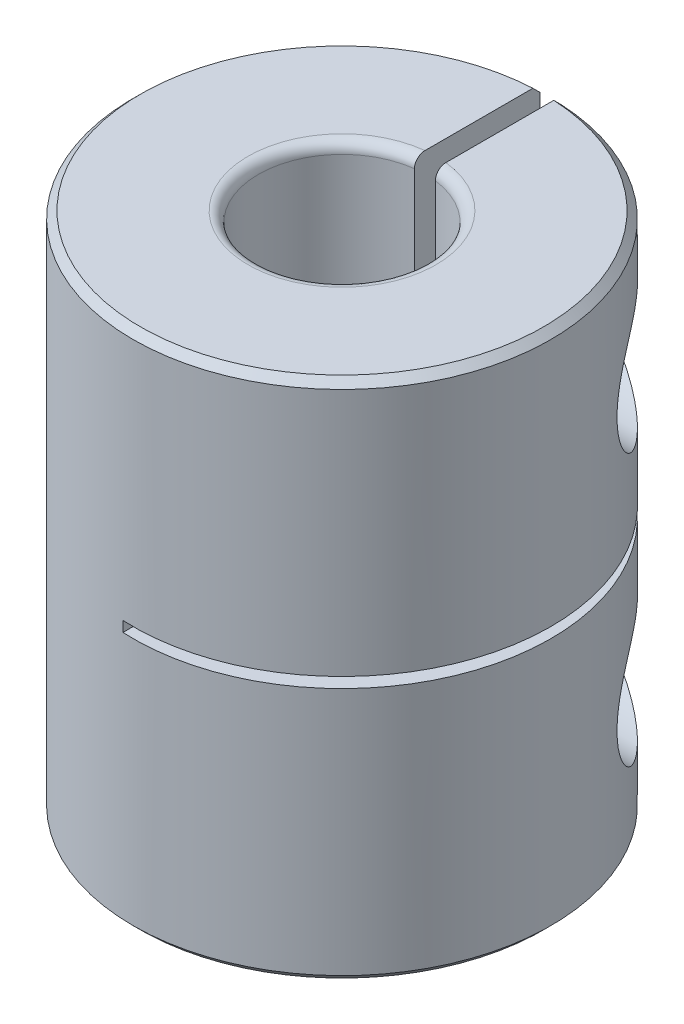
ISO-10303-21;
HEADER;
FILE_DESCRIPTION(('STEP AP214'),'2;1');
FILE_NAME('part.step','',(''),(''),'','','');
FILE_SCHEMA(('AUTOMOTIVE_DESIGN { 1 0 10303 214 1 1 1 1 }'));
ENDSEC;
DATA;
#1=APPLICATION_CONTEXT('core data for automotive mechanical design processes');
#2=APPLICATION_PROTOCOL_DEFINITION('international standard','automotive_design',2000,#1);
#3=PRODUCT_CONTEXT('',#1,'mechanical');
#4=PRODUCT('Part','Part','',(#3));
#5=PRODUCT_RELATED_PRODUCT_CATEGORY('part','',(#4));
#6=PRODUCT_DEFINITION_FORMATION('','',#4);
#7=PRODUCT_DEFINITION_CONTEXT('part definition',#1,'design');
#8=PRODUCT_DEFINITION('design','',#6,#7);
#9=PRODUCT_DEFINITION_SHAPE('','',#8);
#10=(LENGTH_UNIT() NAMED_UNIT(*) SI_UNIT(.MILLI.,.METRE.));
#11=(NAMED_UNIT(*) PLANE_ANGLE_UNIT() SI_UNIT($,.RADIAN.));
#12=(NAMED_UNIT(*) SI_UNIT($,.STERADIAN.) SOLID_ANGLE_UNIT());
#13=UNCERTAINTY_MEASURE_WITH_UNIT(LENGTH_MEASURE(1.E-05),#10,'distance_accuracy_value','');
#14=(GEOMETRIC_REPRESENTATION_CONTEXT(3) GLOBAL_UNCERTAINTY_ASSIGNED_CONTEXT((#13)) GLOBAL_UNIT_ASSIGNED_CONTEXT((#10,
#11,#12)) REPRESENTATION_CONTEXT('',''));
#15=CARTESIAN_POINT('',(0.,0.,0.));
#16=DIRECTION('',(0.,0.,1.));
#17=DIRECTION('',(1.,0.,0.));
#18=AXIS2_PLACEMENT_3D('',#15,#16,#17);
#19=CARTESIAN_POINT('',(0.,12.5,0.));
#20=DIRECTION('',(0.,1.,0.));
#21=DIRECTION('',(0.,0.,1.));
#22=AXIS2_PLACEMENT_3D('',#19,#20,#21);
#23=CONICAL_SURFACE('',#22,3.,0.785398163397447);
#24=CARTESIAN_POINT('',(-0.5,16.1126783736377,6.59374819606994));
#25=CARTESIAN_POINT('',(-0.5,15.8798174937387,6.36021293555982));
#26=CARTESIAN_POINT('',(-0.5,15.6469865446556,6.12664780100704));
#27=CARTESIAN_POINT('',(-0.5,15.1814169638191,5.65940877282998));
#28=CARTESIAN_POINT('',(-0.5,14.9486783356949,5.42573487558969));
#29=CARTESIAN_POINT('',(-0.5,14.4831387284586,4.95804128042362));
#30=CARTESIAN_POINT('',(-0.5,14.2503378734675,4.72402145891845));
#31=CARTESIAN_POINT('',(-0.5,13.7849641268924,4.25577153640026));
#32=CARTESIAN_POINT('',(-0.5,13.5523912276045,4.02154144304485));
#33=CARTESIAN_POINT('',(-0.5,13.0976725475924,3.56288179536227));
#34=CARTESIAN_POINT('',(-0.5,12.875511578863,3.33846731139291));
#35=CARTESIAN_POINT('',(-0.5,12.5427043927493,3.00139301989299));
#36=CARTESIAN_POINT('',(-0.5,12.4318351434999,2.88895348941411));
#37=CARTESIAN_POINT('',(-0.5,12.2103104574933,2.66386624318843));
#38=CARTESIAN_POINT('',(-0.5,12.0996550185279,2.55121852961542));
#39=CARTESIAN_POINT('',(-0.5,11.878712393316,2.32568028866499));
#40=CARTESIAN_POINT('',(-0.5,11.7684250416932,2.21278992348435));
#41=CARTESIAN_POINT('',(-0.5,11.5483267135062,1.9865368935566));
#42=CARTESIAN_POINT('',(-0.5,11.4385157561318,1.87317421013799));
#43=CARTESIAN_POINT('',(-0.5,11.2197003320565,1.64570983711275));
#44=CARTESIAN_POINT('',(-0.5,11.1106957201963,1.53160828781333));
#45=CARTESIAN_POINT('',(-0.5,10.9483145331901,1.35940036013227));
#46=CARTESIAN_POINT('',(-0.5,10.894376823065,1.30182366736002));
#47=CARTESIAN_POINT('',(-0.5,10.7870522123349,1.18615978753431));
#48=CARTESIAN_POINT('',(-0.5,10.7336652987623,1.12807261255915));
#49=CARTESIAN_POINT('',(-0.5,10.6512876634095,1.03713543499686));
#50=CARTESIAN_POINT('',(-0.5,10.6220055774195,1.00454958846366));
#51=CARTESIAN_POINT('',(-0.5,10.5637800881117,0.939070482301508));
#52=CARTESIAN_POINT('',(-0.5,10.5348367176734,0.90617719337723));
#53=CARTESIAN_POINT('',(-0.5,10.4772023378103,0.839761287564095));
#54=CARTESIAN_POINT('',(-0.5,10.4485145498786,0.80623586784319));
#55=CARTESIAN_POINT('',(-0.5,10.391782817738,0.738657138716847));
#56=CARTESIAN_POINT('',(-0.5,10.3637387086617,0.704603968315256));
#57=CARTESIAN_POINT('',(-0.5,10.3083380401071,0.635485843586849));
#58=CARTESIAN_POINT('',(-0.5,10.2809888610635,0.600414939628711));
#59=CARTESIAN_POINT('',(-0.5,10.2276861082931,0.529231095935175));
#60=CARTESIAN_POINT('',(-0.5,10.2017321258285,0.493118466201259));
#61=CARTESIAN_POINT('',(-0.5,10.1521680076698,0.419594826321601));
#62=CARTESIAN_POINT('',(-0.5,10.1285454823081,0.382192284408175));
#63=CARTESIAN_POINT('',(-0.5,10.0849975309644,0.305329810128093));
#64=CARTESIAN_POINT('',(-0.5,10.0650622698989,0.265875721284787));
#65=CARTESIAN_POINT('',(-0.5,10.0357572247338,0.19444436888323));
#66=CARTESIAN_POINT('',(-0.5,10.0249921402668,0.163061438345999));
#67=CARTESIAN_POINT('',(-0.5,10.0087809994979,0.0990206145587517));
#68=CARTESIAN_POINT('',(-0.5,10.0033101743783,0.0663694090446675));
#69=CARTESIAN_POINT('',(-0.5,9.9989085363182,0.000281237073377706));
#70=CARTESIAN_POINT('',(-0.5,10.0000405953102,-0.0331602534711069));
#71=CARTESIAN_POINT('',(-0.5,10.0086887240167,-0.0992592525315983));
#72=CARTESIAN_POINT('',(-0.5,10.0162262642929,-0.131913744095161));
#73=CARTESIAN_POINT('',(-0.5,10.0336132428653,-0.187798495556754));
#74=CARTESIAN_POINT('',(-0.5,10.0424368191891,-0.211369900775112));
#75=CARTESIAN_POINT('',(-0.5,10.0620977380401,-0.257668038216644));
#76=CARTESIAN_POINT('',(-0.5,10.0729366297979,-0.280394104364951));
#77=CARTESIAN_POINT('',(-0.5,10.0961305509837,-0.325178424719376));
#78=CARTESIAN_POINT('',(-0.5,10.108492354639,-0.347233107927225));
#79=CARTESIAN_POINT('',(-0.5,10.1342949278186,-0.390683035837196));
#80=CARTESIAN_POINT('',(-0.5,10.1477352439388,-0.412078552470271));
#81=CARTESIAN_POINT('',(-0.5,10.19455271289,-0.483603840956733));
#82=CARTESIAN_POINT('',(-0.5,10.2297762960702,-0.532516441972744));
#83=CARTESIAN_POINT('',(-0.5,10.3025802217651,-0.628567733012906));
#84=CARTESIAN_POINT('',(-0.5,10.340162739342,-0.675704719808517));
#85=CARTESIAN_POINT('',(-0.5,10.4168223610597,-0.768939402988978));
#86=CARTESIAN_POINT('',(-0.5,10.4559029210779,-0.815034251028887));
#87=CARTESIAN_POINT('',(-0.5,10.5349363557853,-0.906430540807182));
#88=CARTESIAN_POINT('',(-0.5,10.5748888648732,-0.951732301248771));
#89=CARTESIAN_POINT('',(-0.5,10.6554744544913,-1.04188765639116));
#90=CARTESIAN_POINT('',(-0.5,10.696108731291,-1.08674017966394));
#91=CARTESIAN_POINT('',(-0.5,10.777807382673,-1.17605917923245));
#92=CARTESIAN_POINT('',(-0.5,10.8188718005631,-1.22052561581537));
#93=CARTESIAN_POINT('',(-0.5,10.9423953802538,-1.3533570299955));
#94=CARTESIAN_POINT('',(-0.5,11.0253127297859,-1.4412954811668));
#95=CARTESIAN_POINT('',(-0.5,11.1910703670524,-1.61568350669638));
#96=CARTESIAN_POINT('',(-0.5,11.2739041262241,-1.70213931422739));
#97=CARTESIAN_POINT('',(-0.5,11.4400179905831,-1.87462143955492));
#98=CARTESIAN_POINT('',(-0.5,11.5232980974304,-1.96064775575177));
#99=CARTESIAN_POINT('',(-0.5,11.7735844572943,-2.21830410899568));
#100=CARTESIAN_POINT('',(-0.5,11.9410312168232,-2.38950577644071));
#101=CARTESIAN_POINT('',(-0.5,12.2766269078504,-2.73142736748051));
#102=CARTESIAN_POINT('',(-0.5,12.4447762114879,-2.90214692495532));
#103=CARTESIAN_POINT('',(-0.5,12.7814306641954,-3.24322955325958));
#104=CARTESIAN_POINT('',(-0.5,12.9499358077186,-3.4135926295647));
#105=CARTESIAN_POINT('',(-0.5,13.2867646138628,-3.7536825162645));
#106=CARTESIAN_POINT('',(-0.5,13.4550877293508,-3.9234098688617));
#107=CARTESIAN_POINT('',(-0.5,13.7918879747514,-4.26271303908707));
#108=CARTESIAN_POINT('',(-0.5,13.9603651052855,-4.43228885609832));
#109=CARTESIAN_POINT('',(-0.5,14.4659018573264,-4.94080349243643));
#110=CARTESIAN_POINT('',(-0.5,14.803120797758,-5.27958390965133));
#111=CARTESIAN_POINT('',(-0.5,15.2214168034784,-5.69953141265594));
#112=CARTESIAN_POINT('',(-0.5,15.3023854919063,-5.78080652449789));
#113=CARTESIAN_POINT('',(-0.5,15.4643372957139,-5.94334654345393));
#114=CARTESIAN_POINT('',(-0.5,15.5453204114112,-6.02461145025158));
#115=CARTESIAN_POINT('',(-0.5,15.7073615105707,-6.18719489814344));
#116=CARTESIAN_POINT('',(-0.5,15.7884195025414,-6.26851343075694));
#117=CARTESIAN_POINT('',(-0.5,15.9505430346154,-6.43113878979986));
#118=CARTESIAN_POINT('',(-0.5,16.03160857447,-6.51244561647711));
#119=CARTESIAN_POINT('',(-0.5,16.1126783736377,-6.59374819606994));
#120=B_SPLINE_CURVE_WITH_KNOTS('',3,(#24,#25,#26,#27,#28,#29,#30,#31,#32,#33,#34,#35,#36,#37,
#38,#39,#40,#41,#42,#43,#44,#45,#46,#47,#48,#49,#50,#51,#52,#53,#54,#55,#56,#57,#58,#59,#60,#61,
#62,#63,#64,#65,#66,#67,#68,#69,#70,#71,#72,#73,#74,#75,#76,#77,#78,#79,#80,#81,#82,#83,#84,#85,
#86,#87,#88,#89,#90,#91,#92,#93,#94,#95,#96,#97,#98,#99,#100,#101,#102,#103,#104,#105,#106,#107,
#108,#109,#110,#111,#112,#113,#114,#115,#116,#117,#118,#119),.UNSPECIFIED.,.F.,.F.,(4,2,2,2,2,2,
2,2,2,2,2,2,2,2,2,2,2,2,2,2,2,2,2,2,2,2,2,2,2,2,2,2,2,2,2,2,2,2,2,2,2,2,2,2,2,2,2,4),(0.,
0.989376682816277,1.97878901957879,2.96906848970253,3.95931325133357,4.90665416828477,
5.38037513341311,5.85409117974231,6.32755372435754,6.80103516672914,7.27442919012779,
7.5111108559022,7.74778693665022,7.87921390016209,8.01065351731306,8.1430205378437,
8.27535326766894,8.40875456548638,8.54211656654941,8.67472666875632,8.80697779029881,
8.90619142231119,9.00493861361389,9.10462759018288,9.2046520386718,9.28005397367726,
9.35551411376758,9.431322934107,9.50710004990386,9.68776066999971,9.86859038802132,
10.0498658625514,10.2310667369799,10.4126282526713,10.5942082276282,10.956796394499,
11.3159943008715,11.6751935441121,12.3936160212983,13.1124856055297,13.8313440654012,
14.5484634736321,15.2655857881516,16.6996005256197,17.0437722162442,17.3879527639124,
17.7324058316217,18.0768500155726),.UNSPECIFIED.);
#121=CARTESIAN_POINT('',(-0.5,12.,-2.44948974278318));
#122=VERTEX_POINT('',#121);
#123=CARTESIAN_POINT('',(-0.5,12.25,-2.704163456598));
#124=VERTEX_POINT('',#123);
#125=EDGE_CURVE('E293',#122,#124,#120,.T.);
#126=ORIENTED_EDGE('',*,*,#125,.T.);
#127=CARTESIAN_POINT('',(0.,12.25,0.));
#128=DIRECTION('',(0.,1.,0.));
#129=DIRECTION('',(0.,0.,1.));
#130=AXIS2_PLACEMENT_3D('',#127,#128,#129);
#131=CIRCLE('',#130,2.75000000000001);
#132=CARTESIAN_POINT('',(-0.5,12.25,2.704163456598));
#133=VERTEX_POINT('',#132);
#134=EDGE_CURVE('E207',#124,#133,#131,.T.);
#135=ORIENTED_EDGE('',*,*,#134,.T.);
#136=CARTESIAN_POINT('',(-0.5,12.,2.44948974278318));
#137=VERTEX_POINT('',#136);
#138=EDGE_CURVE('E62',#133,#137,#120,.T.);
#139=ORIENTED_EDGE('',*,*,#138,.T.);
#140=CARTESIAN_POINT('',(0.,12.,0.));
#141=DIRECTION('',(0.,1.,0.));
#142=DIRECTION('',(0.,0.,1.));
#143=AXIS2_PLACEMENT_3D('',#140,#141,#142);
#144=CIRCLE('',#143,2.5);
#145=EDGE_CURVE('E434',#122,#137,#144,.T.);
#146=ORIENTED_EDGE('',*,*,#145,.F.);
#147=EDGE_LOOP('',(#126,#135,#139,#146));
#148=FACE_BOUND('',#147,.T.);
#149=ADVANCED_FACE('F37',(#148),#23,.F.);
#150=CARTESIAN_POINT('',(-0.5,0.,3.95));
#151=DIRECTION('',(1.,0.,0.));
#152=DIRECTION('',(0.,0.,-1.));
#153=AXIS2_PLACEMENT_3D('',#150,#151,#152);
#154=PLANE('',#153);
#155=CARTESIAN_POINT('',(-0.5,19.,-7.));
#156=DIRECTION('',(1.,0.,0.));
#157=DIRECTION('',(0.,0.,-1.));
#158=AXIS2_PLACEMENT_3D('',#155,#156,#157);
#159=CIRCLE('',#158,1.25);
#160=CARTESIAN_POINT('',(-0.5,19.,-8.25000000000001));
#161=VERTEX_POINT('',#160);
#162=EDGE_CURVE('E256',#161,#161,#159,.F.);
#163=ORIENTED_EDGE('',*,*,#162,.T.);
#164=EDGE_LOOP('',(#163));
#165=FACE_BOUND('',#164,.T.);
#166=CARTESIAN_POINT('',(-0.5,5.99999999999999,-7.));
#167=DIRECTION('',(1.,0.,0.));
#168=DIRECTION('',(0.,0.,-1.));
#169=AXIS2_PLACEMENT_3D('',#166,#167,#168);
#170=CIRCLE('',#169,1.25);
#171=CARTESIAN_POINT('',(-0.5,5.99999999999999,-8.25));
#172=VERTEX_POINT('',#171);
#173=EDGE_CURVE('E255',#172,#172,#170,.F.);
#174=ORIENTED_EDGE('',*,*,#173,.T.);
#175=EDGE_LOOP('',(#174));
#176=FACE_BOUND('',#175,.T.);
#177=DIRECTION('',(0.,1.,0.));
#178=VECTOR('',#177,1.);
#179=CARTESIAN_POINT('',(-0.5,12.5,-3.96862696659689));
#180=LINE('',#179,#178);
#181=CARTESIAN_POINT('',(-0.5,24.5,-3.96862696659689));
#182=VERTEX_POINT('',#181);
#183=CARTESIAN_POINT('',(-0.5,12.25,-3.96862696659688));
#184=VERTEX_POINT('',#183);
#185=EDGE_CURVE('E190',#182,#184,#180,.F.);
#186=ORIENTED_EDGE('',*,*,#185,.T.);
#187=DIRECTION('',(0.,0.,1.));
#188=VECTOR('',#187,1.);
#189=CARTESIAN_POINT('',(-0.5,12.25,3.95));
#190=LINE('',#189,#188);
#191=EDGE_CURVE('E193',#184,#124,#190,.T.);
#192=ORIENTED_EDGE('',*,*,#191,.T.);
#193=ORIENTED_EDGE('',*,*,#125,.F.);
#194=DIRECTION('',(0.,-1.,0.));
#195=VECTOR('',#194,1.);
#196=CARTESIAN_POINT('',(-0.5,12.5,-2.44948974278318));
#197=LINE('',#196,#195);
#198=CARTESIAN_POINT('',(-0.5,0.5,-2.44948974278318));
#199=VERTEX_POINT('',#198);
#200=EDGE_CURVE('E199',#122,#199,#197,.T.);
#201=ORIENTED_EDGE('',*,*,#200,.T.);
#202=CARTESIAN_POINT('',(-0.5,0.0326265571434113,-2.77770033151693));
#203=CARTESIAN_POINT('',(-0.5,0.0426566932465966,-2.75089262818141));
#204=CARTESIAN_POINT('',(-0.5,0.0549373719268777,-2.72490575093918));
#205=CARTESIAN_POINT('',(-0.5,0.0836804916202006,-2.67532858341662));
#206=CARTESIAN_POINT('',(-0.5,0.100147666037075,-2.65174104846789));
#207=CARTESIAN_POINT('',(-0.5,0.136824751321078,-2.60766935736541));
#208=CARTESIAN_POINT('',(-0.5,0.157035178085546,-2.58718562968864));
#209=CARTESIAN_POINT('',(-0.5,0.200640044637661,-2.54995638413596));
#210=CARTESIAN_POINT('',(-0.5,0.224033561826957,-2.53320978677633));
#211=CARTESIAN_POINT('',(-0.5,0.273060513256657,-2.50414975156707));
#212=CARTESIAN_POINT('',(-0.5,0.298664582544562,-2.49178680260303));
#213=CARTESIAN_POINT('',(-0.5,0.351611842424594,-2.47162514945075));
#214=CARTESIAN_POINT('',(-0.5,0.378954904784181,-2.46382610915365));
#215=CARTESIAN_POINT('',(-0.5,0.434072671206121,-2.45315040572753));
#216=CARTESIAN_POINT('',(-0.5,0.461830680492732,-2.45018745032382));
#217=CARTESIAN_POINT('',(-0.5,0.517446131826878,-2.44901121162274));
#218=CARTESIAN_POINT('',(-0.5,0.545303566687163,-2.45079759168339));
#219=CARTESIAN_POINT('',(-0.5,0.600062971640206,-2.45902254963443));
#220=CARTESIAN_POINT('',(-0.5,0.6269713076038,-2.46541887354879));
#221=CARTESIAN_POINT('',(-0.5,0.679342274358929,-2.48261144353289));
#222=CARTESIAN_POINT('',(-0.5,0.70480487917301,-2.49340776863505));
#223=CARTESIAN_POINT('',(-0.5,0.753739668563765,-2.51914444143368));
#224=CARTESIAN_POINT('',(-0.5,0.77719869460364,-2.53410978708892));
#225=CARTESIAN_POINT('',(-0.5,0.821325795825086,-2.56770502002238));
#226=CARTESIAN_POINT('',(-0.5,0.841993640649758,-2.58633520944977));
#227=CARTESIAN_POINT('',(-0.5,0.880325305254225,-2.62706414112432));
#228=CARTESIAN_POINT('',(-0.5,0.897932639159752,-2.64921603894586));
#229=CARTESIAN_POINT('',(-0.5,0.929252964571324,-2.69612009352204));
#230=CARTESIAN_POINT('',(-0.5,0.942965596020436,-2.72087249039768));
#231=CARTESIAN_POINT('',(-0.5,0.966341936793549,-2.77272922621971));
#232=CARTESIAN_POINT('',(-0.5,0.975932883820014,-2.79986638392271));
#233=CARTESIAN_POINT('',(-0.5,0.990467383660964,-2.85535846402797));
#234=CARTESIAN_POINT('',(-0.5,0.995410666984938,-2.88371345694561));
#235=CARTESIAN_POINT('',(-0.5,1.00053374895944,-2.94109923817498));
#236=CARTESIAN_POINT('',(-0.5,1.00067197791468,-2.9701337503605));
#237=CARTESIAN_POINT('',(-0.5,0.996063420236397,-3.02781329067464));
#238=CARTESIAN_POINT('',(-0.5,0.991316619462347,-3.05645831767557));
#239=CARTESIAN_POINT('',(-0.5,0.97706621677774,-3.11248489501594));
#240=CARTESIAN_POINT('',(-0.5,0.967571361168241,-3.13986866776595));
#241=CARTESIAN_POINT('',(-0.5,0.944076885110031,-3.19263115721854));
#242=CARTESIAN_POINT('',(-0.5,0.930077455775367,-3.21800995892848));
#243=CARTESIAN_POINT('',(-0.5,0.898104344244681,-3.26578756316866));
#244=CARTESIAN_POINT('',(-0.5,0.880168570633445,-3.28821172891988));
#245=CARTESIAN_POINT('',(-0.5,0.840746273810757,-3.32968564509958));
#246=CARTESIAN_POINT('',(-0.5,0.819259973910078,-3.34873560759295));
#247=CARTESIAN_POINT('',(-0.5,0.773616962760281,-3.3826843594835));
#248=CARTESIAN_POINT('',(-0.5,0.74949442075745,-3.39762909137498));
#249=CARTESIAN_POINT('',(-0.5,0.699063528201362,-3.42320962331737));
#250=CARTESIAN_POINT('',(-0.5,0.672755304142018,-3.43384567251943));
#251=CARTESIAN_POINT('',(-0.5,0.61897940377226,-3.45040321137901));
#252=CARTESIAN_POINT('',(-0.5,0.591525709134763,-3.45637013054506));
#253=CARTESIAN_POINT('',(-0.5,0.536005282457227,-3.46358296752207));
#254=CARTESIAN_POINT('',(-0.5,0.507938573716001,-3.46482906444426));
#255=CARTESIAN_POINT('',(-0.5,0.452146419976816,-3.46256899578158));
#256=CARTESIAN_POINT('',(-0.5,0.424419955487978,-3.45908789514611));
#257=CARTESIAN_POINT('',(-0.5,0.369945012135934,-3.44752192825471));
#258=CARTESIAN_POINT('',(-0.5,0.343196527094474,-3.43943709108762));
#259=CARTESIAN_POINT('',(-0.5,0.291418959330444,-3.41889902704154));
#260=CARTESIAN_POINT('',(-0.5,0.266390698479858,-3.40644372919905));
#261=CARTESIAN_POINT('',(-0.5,0.218763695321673,-3.37753217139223));
#262=CARTESIAN_POINT('',(-0.5,0.196165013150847,-3.36107581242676));
#263=CARTESIAN_POINT('',(-0.5,0.15388619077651,-3.32452833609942));
#264=CARTESIAN_POINT('',(-0.5,0.13422466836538,-3.30441568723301));
#265=CARTESIAN_POINT('',(-0.5,0.0985171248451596,-3.26120497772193));
#266=CARTESIAN_POINT('',(-0.5,0.0824711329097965,-3.23810689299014));
#267=CARTESIAN_POINT('',(-0.5,0.0542724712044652,-3.18933253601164));
#268=CARTESIAN_POINT('',(-0.5,0.0421608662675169,-3.16363252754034));
#269=CARTESIAN_POINT('',(-0.5,0.0223656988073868,-3.11057289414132));
#270=CARTESIAN_POINT('',(-0.5,0.0146834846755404,-3.0832127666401));
#271=CARTESIAN_POINT('',(-0.5,0.00387587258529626,-3.02726775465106));
#272=CARTESIAN_POINT('',(-0.5,0.000806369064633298,-2.99867210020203));
#273=CARTESIAN_POINT('',(-0.5,-0.000526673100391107,-2.94139168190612));
#274=CARTESIAN_POINT('',(-0.5,0.00120448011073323,-2.91270705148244));
#275=CARTESIAN_POINT('',(-0.5,0.0079306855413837,-2.86617789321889));
#276=CARTESIAN_POINT('',(-0.5,0.0115389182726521,-2.84812136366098));
#277=CARTESIAN_POINT('',(-0.5,0.0206637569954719,-2.81249698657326));
#278=CARTESIAN_POINT('',(-0.5,0.0261803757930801,-2.79492914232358));
#279=CARTESIAN_POINT('',(-0.5,0.0326265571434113,-2.77770033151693));
#280=B_SPLINE_CURVE_WITH_KNOTS('',3,(#202,#203,#204,#205,#206,#207,#208,#209,#210,#211,#212,
#213,#214,#215,#216,#217,#218,#219,#220,#221,#222,#223,#224,#225,#226,#227,#228,#229,#230,#231,
#232,#233,#234,#235,#236,#237,#238,#239,#240,#241,#242,#243,#244,#245,#246,#247,#248,#249,#250,
#251,#252,#253,#254,#255,#256,#257,#258,#259,#260,#261,#262,#263,#264,#265,#266,#267,#268,#269,
#270,#271,#272,#273,#274,#275,#276,#277,#278,#279),.UNSPECIFIED.,.T.,.F.,(4,2,2,2,2,2,2,2,2,2,2,
2,2,2,2,2,2,2,2,2,2,2,2,2,2,2,2,2,2,2,2,2,2,2,2,2,2,2,4),(0.,0.0858018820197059,
0.171701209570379,0.257612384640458,0.343498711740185,0.428381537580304,0.513258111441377,
0.596602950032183,0.679941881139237,0.762526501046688,0.845112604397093,0.928204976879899,
1.01130420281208,1.0958036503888,1.18031090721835,1.26625418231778,1.3522024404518,
1.43889407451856,1.5255859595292,1.61211873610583,1.69864784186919,1.78437759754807,
1.87010196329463,1.95482378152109,2.03954069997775,2.12342272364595,2.20730156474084,
2.29073738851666,2.37417268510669,2.45764757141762,2.54112452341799,2.62510999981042,
2.70909615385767,2.7939326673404,2.8787949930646,2.96467757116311,3.05046522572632,
3.10560812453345,3.16075139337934),.UNSPECIFIED.);
#281=CARTESIAN_POINT('',(-0.5,0.,-2.95803989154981));
#282=VERTEX_POINT('',#281);
#283=EDGE_CURVE('E306',#282,#199,#280,.T.);
#284=ORIENTED_EDGE('',*,*,#283,.F.);
#285=DIRECTION('',(0.,0.,-1.));
#286=VECTOR('',#285,1.);
#287=CARTESIAN_POINT('',(-0.5,0.,3.95));
#288=LINE('',#287,#286);
#289=CARTESIAN_POINT('',(-0.5,0.,-9.63703792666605));
#290=VERTEX_POINT('',#289);
#291=EDGE_CURVE('E243',#282,#290,#288,.T.);
#292=ORIENTED_EDGE('',*,*,#291,.T.);
#293=CARTESIAN_POINT('',(-0.5,14.3045899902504,-23.9493712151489));
#294=CARTESIAN_POINT('',(-0.5,13.4780324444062,-23.1226321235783));
#295=CARTESIAN_POINT('',(-0.5,12.6514828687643,-22.2958850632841));
#296=CARTESIAN_POINT('',(-0.5,10.9984097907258,-20.6423645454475));
#297=CARTESIAN_POINT('',(-0.5,10.1718862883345,-19.8155910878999));
#298=CARTESIAN_POINT('',(-0.5,8.51887198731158,-18.1620038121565));
#299=CARTESIAN_POINT('',(-0.5,7.69238118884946,-17.3351899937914));
#300=CARTESIAN_POINT('',(-0.5,6.03945574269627,-15.68150655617));
#301=CARTESIAN_POINT('',(-0.5,5.21302109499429,-14.8546369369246));
#302=CARTESIAN_POINT('',(-0.5,3.55982236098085,-13.2003900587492));
#303=CARTESIAN_POINT('',(-0.5,2.73305831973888,-12.3730127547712));
#304=CARTESIAN_POINT('',(-0.5,1.07969263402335,-10.7180949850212));
#305=CARTESIAN_POINT('',(-0.5,0.253090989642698,-9.89055451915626));
#306=CARTESIAN_POINT('',(-0.5,-1.39980306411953,-8.23516926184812));
#307=CARTESIAN_POINT('',(-0.5,-2.22609547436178,-7.4073244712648));
#308=CARTESIAN_POINT('',(-0.5,-3.46490289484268,-6.16492865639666));
#309=CARTESIAN_POINT('',(-0.5,-3.87773331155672,-5.75069213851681));
#310=CARTESIAN_POINT('',(-0.5,-4.70300045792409,-4.92182717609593));
#311=CARTESIAN_POINT('',(-0.5,-5.11543718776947,-4.5071987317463));
#312=CARTESIAN_POINT('',(-0.5,-5.64031262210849,-3.978413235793));
#313=CARTESIAN_POINT('',(-0.5,-5.75315856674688,-3.86466053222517));
#314=CARTESIAN_POINT('',(-0.5,-5.97875879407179,-3.63706425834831));
#315=CARTESIAN_POINT('',(-0.5,-6.09151307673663,-3.52322068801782));
#316=CARTESIAN_POINT('',(-0.5,-6.42959328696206,-3.18153187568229));
#317=CARTESIAN_POINT('',(-0.5,-6.65474807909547,-2.9535169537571));
#318=CARTESIAN_POINT('',(-0.5,-7.02977920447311,-2.57221717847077));
#319=CARTESIAN_POINT('',(-0.5,-7.17990499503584,-2.41917772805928));
#320=CARTESIAN_POINT('',(-0.5,-7.47948228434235,-2.11240989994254));
#321=CARTESIAN_POINT('',(-0.5,-7.62893371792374,-1.95868145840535));
#322=CARTESIAN_POINT('',(-0.5,-7.87726090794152,-1.70098524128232));
#323=CARTESIAN_POINT('',(-0.5,-7.97651208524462,-1.59737973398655));
#324=CARTESIAN_POINT('',(-0.5,-8.17394077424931,-1.38919810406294));
#325=CARTESIAN_POINT('',(-0.5,-8.27211856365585,-1.28462224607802));
#326=CARTESIAN_POINT('',(-0.5,-8.43431170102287,-1.10844885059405));
#327=CARTESIAN_POINT('',(-0.5,-8.49889293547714,-1.03737578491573));
#328=CARTESIAN_POINT('',(-0.5,-8.59455850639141,-0.929636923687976));
#329=CARTESIAN_POINT('',(-0.5,-8.62625951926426,-0.89351979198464));
#330=CARTESIAN_POINT('',(-0.5,-8.68908564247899,-0.820789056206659));
#331=CARTESIAN_POINT('',(-0.5,-8.72021078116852,-0.784175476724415));
#332=CARTESIAN_POINT('',(-0.5,-8.77650883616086,-0.716435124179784));
#333=CARTESIAN_POINT('',(-0.5,-8.80180763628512,-0.685413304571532));
#334=CARTESIAN_POINT('',(-0.5,-8.85160393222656,-0.622735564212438));
#335=CARTESIAN_POINT('',(-0.5,-8.8761015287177,-0.591079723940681));
#336=CARTESIAN_POINT('',(-0.5,-8.92393201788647,-0.526909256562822));
#337=CARTESIAN_POINT('',(-0.5,-8.94726528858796,-0.494394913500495));
#338=CARTESIAN_POINT('',(-0.5,-8.99216699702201,-0.428180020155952));
#339=CARTESIAN_POINT('',(-0.5,-9.01373658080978,-0.394480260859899));
#340=CARTESIAN_POINT('',(-0.5,-9.05286423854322,-0.327514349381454));
#341=CARTESIAN_POINT('',(-0.5,-9.07058630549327,-0.294345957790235));
#342=CARTESIAN_POINT('',(-0.5,-9.10206230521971,-0.226154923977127));
#343=CARTESIAN_POINT('',(-0.5,-9.11582317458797,-0.191135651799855));
#344=CARTESIAN_POINT('',(-0.5,-9.13502292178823,-0.126312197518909));
#345=CARTESIAN_POINT('',(-0.5,-9.14157091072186,-0.096850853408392));
#346=CARTESIAN_POINT('',(-0.5,-9.14947505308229,-0.0372695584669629));
#347=CARTESIAN_POINT('',(-0.5,-9.15084413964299,-0.00715143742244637));
#348=CARTESIAN_POINT('',(-0.5,-9.14811341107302,0.0528240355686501));
#349=CARTESIAN_POINT('',(-0.5,-9.14401264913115,0.0826813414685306));
#350=CARTESIAN_POINT('',(-0.5,-9.13118709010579,0.141407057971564));
#351=CARTESIAN_POINT('',(-0.5,-9.12245030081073,0.170272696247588));
#352=CARTESIAN_POINT('',(-0.5,-9.09915042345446,0.233442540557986));
#353=CARTESIAN_POINT('',(-0.5,-9.0836955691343,0.267406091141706));
#354=CARTESIAN_POINT('',(-0.5,-9.04954822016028,0.333692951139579));
#355=CARTESIAN_POINT('',(-0.5,-9.03084841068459,0.366012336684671));
#356=CARTESIAN_POINT('',(-0.5,-8.99124266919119,0.429632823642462));
#357=CARTESIAN_POINT('',(-0.5,-8.97031925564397,0.460922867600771));
#358=CARTESIAN_POINT('',(-0.5,-8.92713705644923,0.522504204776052));
#359=CARTESIAN_POINT('',(-0.5,-8.90487975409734,0.55279655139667));
#360=CARTESIAN_POINT('',(-0.5,-8.85683237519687,0.616106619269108));
#361=CARTESIAN_POINT('',(-0.5,-8.8309298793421,0.649038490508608));
#362=CARTESIAN_POINT('',(-0.5,-8.77833186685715,0.714264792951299));
#363=CARTESIAN_POINT('',(-0.5,-8.7516362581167,0.746559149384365));
#364=CARTESIAN_POINT('',(-0.5,-8.67069574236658,0.842765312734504));
#365=CARTESIAN_POINT('',(-0.5,-8.61561765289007,0.905974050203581));
#366=CARTESIAN_POINT('',(-0.5,-8.50415440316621,1.03139370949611));
#367=CARTESIAN_POINT('',(-0.5,-8.44776732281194,1.09360290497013));
#368=CARTESIAN_POINT('',(-0.5,-8.33424062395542,1.21730254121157));
#369=CARTESIAN_POINT('',(-0.5,-8.27710118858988,1.27879315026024));
#370=CARTESIAN_POINT('',(-0.5,-8.16258313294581,1.40102136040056));
#371=CARTESIAN_POINT('',(-0.5,-8.10520681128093,1.46176112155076));
#372=CARTESIAN_POINT('',(-0.5,-7.99010252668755,1.58291328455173));
#373=CARTESIAN_POINT('',(-0.5,-7.93237454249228,1.64332566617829));
#374=CARTESIAN_POINT('',(-0.5,-7.75892458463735,1.82409735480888));
#375=CARTESIAN_POINT('',(-0.5,-7.64283262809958,1.94410136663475));
#376=CARTESIAN_POINT('',(-0.5,-7.41042679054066,2.18322290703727));
#377=CARTESIAN_POINT('',(-0.5,-7.29411450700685,2.30234199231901));
#378=CARTESIAN_POINT('',(-0.5,-7.06113642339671,2.54023411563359));
#379=CARTESIAN_POINT('',(-0.5,-6.94447062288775,2.65900715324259));
#380=CARTESIAN_POINT('',(-0.5,-6.59412513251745,3.01499025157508));
#381=CARTESIAN_POINT('',(-0.5,-6.36010072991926,3.2518608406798));
#382=CARTESIAN_POINT('',(-0.5,-5.89150979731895,3.72522982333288));
#383=CARTESIAN_POINT('',(-0.5,-5.65694310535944,3.96172805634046));
#384=CARTESIAN_POINT('',(-0.5,-5.18753690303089,4.43445073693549));
#385=CARTESIAN_POINT('',(-0.5,-4.95269739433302,4.6706751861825));
#386=CARTESIAN_POINT('',(-0.5,-4.24738134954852,5.37964939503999));
#387=CARTESIAN_POINT('',(-0.5,-3.77665368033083,5.85214924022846));
#388=CARTESIAN_POINT('',(-0.5,-2.83494085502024,6.79678878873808));
#389=CARTESIAN_POINT('',(-0.5,-2.36395573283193,7.26892852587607));
#390=CARTESIAN_POINT('',(-0.5,-1.04639794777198,8.58924054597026));
#391=CARTESIAN_POINT('',(-0.5,-0.199635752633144,9.43722368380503));
#392=CARTESIAN_POINT('',(-0.5,1.49415205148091,11.1329999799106));
#393=CARTESIAN_POINT('',(-0.5,2.34117767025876,11.9807931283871));
#394=CARTESIAN_POINT('',(-0.5,4.03374252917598,13.6746454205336));
#395=CARTESIAN_POINT('',(-0.5,4.87928153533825,14.5207047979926));
#396=CARTESIAN_POINT('',(-0.5,6.57039886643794,16.2127109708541));
#397=CARTESIAN_POINT('',(-0.5,7.41597718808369,17.0586577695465));
#398=CARTESIAN_POINT('',(-0.5,8.26157007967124,17.9045899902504));
#399=B_SPLINE_CURVE_WITH_KNOTS('',3,(#293,#294,#295,#296,#297,#298,#299,#300,#301,#302,#303,
#304,#305,#306,#307,#308,#309,#310,#311,#312,#313,#314,#315,#316,#317,#318,#319,#320,#321,#322,
#323,#324,#325,#326,#327,#328,#329,#330,#331,#332,#333,#334,#335,#336,#337,#338,#339,#340,#341,
#342,#343,#344,#345,#346,#347,#348,#349,#350,#351,#352,#353,#354,#355,#356,#357,#358,#359,#360,
#361,#362,#363,#364,#365,#366,#367,#368,#369,#370,#371,#372,#373,#374,#375,#376,#377,#378,#379,
#380,#381,#382,#383,#384,#385,#386,#387,#388,#389,#390,#391,#392,#393,#394,#395,#396,#397,#398),
.UNSPECIFIED.,.F.,.F.,(4,2,2,2,2,2,2,2,2,2,2,2,2,2,2,2,2,2,2,2,2,2,2,2,2,2,2,2,2,2,2,2,2,2,2,2,
2,2,2,2,2,2,2,2,2,2,2,2,2,2,2,2,4),(0.,3.50717181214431,7.01434432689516,10.5215331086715,
14.0287212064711,17.5376851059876,21.046651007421,24.5556070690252,26.3100834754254,
28.0645590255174,28.5452511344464,29.025943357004,29.9872788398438,30.6304184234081,
31.2736188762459,31.7040386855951,32.1343443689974,32.4224226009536,32.5665872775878,
32.7107448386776,32.8308252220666,32.9508904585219,33.0709164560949,33.1908638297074,
33.3035332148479,33.4160040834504,33.5061728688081,33.5961163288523,33.6860753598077,
33.776268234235,33.8879266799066,33.9998401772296,34.1127097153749,34.225455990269,
34.3511321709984,34.4768230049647,34.7283043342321,34.980181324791,35.231998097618,
35.4826600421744,35.7333372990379,36.2342373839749,36.7336974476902,37.2331581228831,
38.2320939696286,39.2313817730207,40.2306634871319,42.2315543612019,44.2322257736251,
47.8273243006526,51.4225782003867,55.0110004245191,58.5992671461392),.UNSPECIFIED.);
#400=CARTESIAN_POINT('',(-0.5,0.350000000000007,-9.98749217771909));
#401=VERTEX_POINT('',#400);
#402=EDGE_CURVE('E286',#401,#290,#399,.T.);
#403=ORIENTED_EDGE('',*,*,#402,.F.);
#404=DIRECTION('',(0.,-1.,0.));
#405=VECTOR('',#404,1.);
#406=CARTESIAN_POINT('',(-0.5,25.,-9.98749217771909));
#407=LINE('',#406,#405);
#408=CARTESIAN_POINT('',(-0.5,24.65,-9.98749217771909));
#409=VERTEX_POINT('',#408);
#410=EDGE_CURVE('E267',#401,#409,#407,.F.);
#411=ORIENTED_EDGE('',*,*,#410,.T.);
#412=CARTESIAN_POINT('',(-0.5,16.7384299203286,17.9045899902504));
#413=CARTESIAN_POINT('',(-0.5,17.3555307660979,17.2872465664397));
#414=CARTESIAN_POINT('',(-0.5,17.9726210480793,16.6698925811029));
#415=CARTESIAN_POINT('',(-0.5,19.2067670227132,15.4351492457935));
#416=CARTESIAN_POINT('',(-0.5,19.8238227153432,14.8177598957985));
#417=CARTESIAN_POINT('',(-0.5,21.0578944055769,13.5829232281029));
#418=CARTESIAN_POINT('',(-0.5,21.6749104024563,12.9654759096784));
#419=CARTESIAN_POINT('',(-0.5,22.9088680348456,11.7305077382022));
#420=CARTESIAN_POINT('',(-0.5,23.5258096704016,11.1129868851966));
#421=CARTESIAN_POINT('',(-0.5,24.7616528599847,9.87574177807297));
#422=CARTESIAN_POINT('',(-0.5,25.380554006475,9.25601711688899));
#423=CARTESIAN_POINT('',(-0.5,26.6181478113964,8.01635732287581));
#424=CARTESIAN_POINT('',(-0.5,27.2368404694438,7.39642218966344));
#425=CARTESIAN_POINT('',(-0.5,28.1645447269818,6.46619140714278));
#426=CARTESIAN_POINT('',(-0.5,28.4737222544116,6.15606124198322));
#427=CARTESIAN_POINT('',(-0.5,29.0919026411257,5.53562636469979));
#428=CARTESIAN_POINT('',(-0.5,29.4009055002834,5.2253216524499));
#429=CARTESIAN_POINT('',(-0.5,30.0186165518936,4.60442119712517));
#430=CARTESIAN_POINT('',(-0.5,30.3273247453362,4.29382545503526));
#431=CARTESIAN_POINT('',(-0.5,30.944215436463,3.67211247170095));
#432=CARTESIAN_POINT('',(-0.5,31.2523979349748,3.36099523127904));
#433=CARTESIAN_POINT('',(-0.5,31.6441135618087,2.96403991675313));
#434=CARTESIAN_POINT('',(-0.5,31.7281958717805,2.87874406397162));
#435=CARTESIAN_POINT('',(-0.5,31.8962374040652,2.70803118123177));
#436=CARTESIAN_POINT('',(-0.5,31.980196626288,2.62261415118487));
#437=CARTESIAN_POINT('',(-0.5,32.2317806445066,2.3662016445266));
#438=CARTESIAN_POINT('',(-0.5,32.3991757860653,2.19497999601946));
#439=CARTESIAN_POINT('',(-0.5,32.6775383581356,1.90823182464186));
#440=CARTESIAN_POINT('',(-0.5,32.7888415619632,1.79303135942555));
#441=CARTESIAN_POINT('',(-0.5,33.0106000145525,1.56165332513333));
#442=CARTESIAN_POINT('',(-0.5,33.1210545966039,1.44547511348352));
#443=CARTESIAN_POINT('',(-0.5,33.3039608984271,1.25002786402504));
#444=CARTESIAN_POINT('',(-0.5,33.3769207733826,1.17123548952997));
#445=CARTESIAN_POINT('',(-0.5,33.521262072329,1.01250568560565));
#446=CARTESIAN_POINT('',(-0.5,33.5926464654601,0.932570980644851));
#447=CARTESIAN_POINT('',(-0.5,33.7088017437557,0.797864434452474));
#448=CARTESIAN_POINT('',(-0.5,33.7543648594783,0.743783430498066));
#449=CARTESIAN_POINT('',(-0.5,33.8212233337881,0.661158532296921));
#450=CARTESIAN_POINT('',(-0.5,33.8433305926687,0.633274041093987));
#451=CARTESIAN_POINT('',(-0.5,33.8867779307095,0.576915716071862));
#452=CARTESIAN_POINT('',(-0.5,33.9081181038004,0.548441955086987));
#453=CARTESIAN_POINT('',(-0.5,33.9500297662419,0.4902772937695));
#454=CARTESIAN_POINT('',(-0.5,33.9705849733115,0.460574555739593));
#455=CARTESIAN_POINT('',(-0.5,34.0100735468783,0.400042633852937));
#456=CARTESIAN_POINT('',(-0.5,34.0290049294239,0.36921213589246));
#457=CARTESIAN_POINT('',(-0.5,34.0641508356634,0.306415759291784));
#458=CARTESIAN_POINT('',(-0.5,34.0803909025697,0.274464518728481));
#459=CARTESIAN_POINT('',(-0.5,34.1089222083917,0.208883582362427));
#460=CARTESIAN_POINT('',(-0.5,34.1212251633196,0.175259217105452));
#461=CARTESIAN_POINT('',(-0.5,34.1394349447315,0.107991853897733));
#462=CARTESIAN_POINT('',(-0.5,34.1456265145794,0.0744310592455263));
#463=CARTESIAN_POINT('',(-0.5,34.1510774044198,0.00682839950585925));
#464=CARTESIAN_POINT('',(-0.5,34.1503615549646,-0.0272113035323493));
#465=CARTESIAN_POINT('',(-0.5,34.1422927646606,-0.0942185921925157));
#466=CARTESIAN_POINT('',(-0.5,34.1349820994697,-0.127191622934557));
#467=CARTESIAN_POINT('',(-0.5,34.1203078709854,-0.175539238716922));
#468=CARTESIAN_POINT('',(-0.5,34.1147750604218,-0.191518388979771));
#469=CARTESIAN_POINT('',(-0.5,34.1026843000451,-0.223082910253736));
#470=CARTESIAN_POINT('',(-0.5,34.0961265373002,-0.238668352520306));
#471=CARTESIAN_POINT('',(-0.5,34.075938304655,-0.283243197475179));
#472=CARTESIAN_POINT('',(-0.5,34.0612316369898,-0.311741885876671));
#473=CARTESIAN_POINT('',(-0.5,34.0298242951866,-0.367629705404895));
#474=CARTESIAN_POINT('',(-0.5,34.0131213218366,-0.395017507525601));
#475=CARTESIAN_POINT('',(-0.5,33.9783015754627,-0.449005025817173));
#476=CARTESIAN_POINT('',(-0.5,33.9601801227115,-0.47560169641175));
#477=CARTESIAN_POINT('',(-0.5,33.9229747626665,-0.528116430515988));
#478=CARTESIAN_POINT('',(-0.5,33.9038906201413,-0.554034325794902));
#479=CARTESIAN_POINT('',(-0.5,33.8452347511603,-0.631510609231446));
#480=CARTESIAN_POINT('',(-0.5,33.804612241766,-0.682270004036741));
#481=CARTESIAN_POINT('',(-0.5,33.7219225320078,-0.782372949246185));
#482=CARTESIAN_POINT('',(-0.5,33.6798589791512,-0.831719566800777));
#483=CARTESIAN_POINT('',(-0.5,33.5957113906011,-0.928483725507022));
#484=CARTESIAN_POINT('',(-0.5,33.5536485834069,-0.975919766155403));
#485=CARTESIAN_POINT('',(-0.5,33.4689059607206,-1.07023707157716));
#486=CARTESIAN_POINT('',(-0.5,33.4262261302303,-1.11711832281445));
#487=CARTESIAN_POINT('',(-0.5,33.2975396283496,-1.25719023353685));
#488=CARTESIAN_POINT('',(-0.5,33.2108974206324,-1.34979609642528));
#489=CARTESIAN_POINT('',(-0.5,33.0366016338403,-1.53425694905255));
#490=CARTESIAN_POINT('',(-0.5,32.9489469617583,-1.62611089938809));
#491=CARTESIAN_POINT('',(-0.5,32.773083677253,-1.80927332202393));
#492=CARTESIAN_POINT('',(-0.5,32.6848751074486,-1.90058183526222));
#493=CARTESIAN_POINT('',(-0.5,32.5088511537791,-2.08206604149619));
#494=CARTESIAN_POINT('',(-0.5,32.4210388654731,-2.17224474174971));
#495=CARTESIAN_POINT('',(-0.5,32.2451649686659,-2.35236208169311));
#496=CARTESIAN_POINT('',(-0.5,32.1571033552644,-2.44230071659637));
#497=CARTESIAN_POINT('',(-0.5,31.8927421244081,-2.71176884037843));
#498=CARTESIAN_POINT('',(-0.5,31.716179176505,-2.89103986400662));
#499=CARTESIAN_POINT('',(-0.5,31.1855301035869,-3.42869146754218));
#500=CARTESIAN_POINT('',(-0.5,30.8308754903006,-3.78651030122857));
#501=CARTESIAN_POINT('',(-0.5,30.1209581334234,-4.50154627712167));
#502=CARTESIAN_POINT('',(-0.5,29.7656953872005,-4.8587634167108));
#503=CARTESIAN_POINT('',(-0.5,29.0547786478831,-5.5729413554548));
#504=CARTESIAN_POINT('',(-0.5,28.6991245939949,-5.92990209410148));
#505=CARTESIAN_POINT('',(-0.5,27.9876317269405,-6.64363822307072));
#506=CARTESIAN_POINT('',(-0.5,27.63179291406,-7.0004136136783));
#507=CARTESIAN_POINT('',(-0.5,26.5614513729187,-8.07322947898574));
#508=CARTESIAN_POINT('',(-0.5,25.8467759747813,-8.78909767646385));
#509=CARTESIAN_POINT('',(-0.5,24.417255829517,-10.2205863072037));
#510=CARTESIAN_POINT('',(-0.5,23.7024110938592,-10.9362067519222));
#511=CARTESIAN_POINT('',(-0.5,21.9609464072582,-12.6792769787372));
#512=CARTESIAN_POINT('',(-0.5,20.934264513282,-13.7066648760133));
#513=CARTESIAN_POINT('',(-0.5,18.8807629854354,-15.7613449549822));
#514=CARTESIAN_POINT('',(-0.5,17.8539433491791,-16.7886371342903));
#515=CARTESIAN_POINT('',(-0.5,15.8051844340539,-18.838203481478));
#516=CARTESIAN_POINT('',(-0.5,14.7832454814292,-19.8604779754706));
#517=CARTESIAN_POINT('',(-0.5,12.7393444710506,-21.9049621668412));
#518=CARTESIAN_POINT('',(-0.5,11.7173824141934,-22.9271718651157));
#519=CARTESIAN_POINT('',(-0.5,10.6954100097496,-23.9493712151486));
#520=B_SPLINE_CURVE_WITH_KNOTS('',3,(#412,#413,#414,#415,#416,#417,#418,#419,#420,#421,#422,
#423,#424,#425,#426,#427,#428,#429,#430,#431,#432,#433,#434,#435,#436,#437,#438,#439,#440,#441,
#442,#443,#444,#445,#446,#447,#448,#449,#450,#451,#452,#453,#454,#455,#456,#457,#458,#459,#460,
#461,#462,#463,#464,#465,#466,#467,#468,#469,#470,#471,#472,#473,#474,#475,#476,#477,#478,#479,
#480,#481,#482,#483,#484,#485,#486,#487,#488,#489,#490,#491,#492,#493,#494,#495,#496,#497,#498,
#499,#500,#501,#502,#503,#504,#505,#506,#507,#508,#509,#510,#511,#512,#513,#514,#515,#516,#517,
#518,#519),.UNSPECIFIED.,.F.,.F.,(4,2,2,2,2,2,2,2,2,2,2,2,2,2,2,2,2,2,2,2,2,2,2,2,2,2,2,2,2,2,2,
2,2,2,2,2,2,2,2,2,2,2,2,2,2,2,2,2,2,2,2,2,2,4),(0.,2.61865179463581,5.23730527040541,
7.85599757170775,10.4746882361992,13.1022109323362,15.7297384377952,17.0434899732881,
18.3572424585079,19.6709905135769,20.9847364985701,21.3440509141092,21.7033655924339,
22.4217218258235,22.9022781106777,23.3831796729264,23.7053246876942,24.0267992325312,
24.238909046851,24.345654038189,24.4523859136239,24.5607150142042,24.669174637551,
24.7765372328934,24.8835773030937,24.9853544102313,25.0867657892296,25.1875316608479,
25.2382353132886,25.2889297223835,25.3850058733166,25.4811937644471,25.5777135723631,
25.6742570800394,25.8692299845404,26.0637413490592,26.2539301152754,26.4441235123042,
26.8245622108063,27.2054593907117,27.5863276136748,27.9639363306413,28.3415525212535,
29.096410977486,30.6078080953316,32.119211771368,33.6308983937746,35.1425826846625,
38.1772248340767,41.2117001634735,45.5690404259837,49.9264697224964,54.262901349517,
58.5992445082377),.UNSPECIFIED.);
#521=CARTESIAN_POINT('',(-0.5,25.,-9.63703792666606));
#522=VERTEX_POINT('',#521);
#523=EDGE_CURVE('E259',#522,#409,#520,.T.);
#524=ORIENTED_EDGE('',*,*,#523,.F.);
#525=DIRECTION('',(0.,0.,-1.));
#526=VECTOR('',#525,1.);
#527=CARTESIAN_POINT('',(-0.5,25.,3.95));
#528=LINE('',#527,#526);
#529=CARTESIAN_POINT('',(-0.5,25.,-4.47213595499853));
#530=VERTEX_POINT('',#529);
#531=EDGE_CURVE('E246',#530,#522,#528,.T.);
#532=ORIENTED_EDGE('',*,*,#531,.F.);
#533=CARTESIAN_POINT('',(-0.5,24.9820728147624,-4.33859702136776));
#534=CARTESIAN_POINT('',(-0.5,24.9895689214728,-4.36601656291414));
#535=CARTESIAN_POINT('',(-0.5,24.9947554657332,-4.39408922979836));
#536=CARTESIAN_POINT('',(-0.5,25.0003489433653,-4.45073077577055));
#537=CARTESIAN_POINT('',(-0.5,25.0007499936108,-4.47930022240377));
#538=CARTESIAN_POINT('',(-0.5,24.9967488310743,-4.5360916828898));
#539=CARTESIAN_POINT('',(-0.5,24.992348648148,-4.56431383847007));
#540=CARTESIAN_POINT('',(-0.5,24.9788662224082,-4.61960872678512));
#541=CARTESIAN_POINT('',(-0.5,24.9697852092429,-4.64668175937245));
#542=CARTESIAN_POINT('',(-0.5,24.9472074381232,-4.6988732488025));
#543=CARTESIAN_POINT('',(-0.5,24.9337171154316,-4.72399448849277));
#544=CARTESIAN_POINT('',(-0.5,24.9026908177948,-4.77160216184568));
#545=CARTESIAN_POINT('',(-0.5,24.885154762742,-4.79408854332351));
#546=CARTESIAN_POINT('',(-0.5,24.8466225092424,-4.83567218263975));
#547=CARTESIAN_POINT('',(-0.5,24.8256430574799,-4.85478495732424));
#548=CARTESIAN_POINT('',(-0.5,24.780758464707,-4.88919430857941));
#549=CARTESIAN_POINT('',(-0.5,24.7568534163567,-4.90449100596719));
#550=CARTESIAN_POINT('',(-0.5,24.7069327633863,-4.93074928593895));
#551=CARTESIAN_POINT('',(-0.5,24.6809290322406,-4.94173344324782));
#552=CARTESIAN_POINT('',(-0.5,24.6274419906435,-4.95916036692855));
#553=CARTESIAN_POINT('',(-0.5,24.5999587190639,-4.96560325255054));
#554=CARTESIAN_POINT('',(-0.5,24.5444099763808,-4.97374225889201));
#555=CARTESIAN_POINT('',(-0.5,24.516347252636,-4.97545713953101));
#556=CARTESIAN_POINT('',(-0.5,24.4603331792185,-4.9741439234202));
#557=CARTESIAN_POINT('',(-0.5,24.4323818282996,-4.97111587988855));
#558=CARTESIAN_POINT('',(-0.5,24.3774243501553,-4.96041292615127));
#559=CARTESIAN_POINT('',(-0.5,24.3504169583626,-4.95274450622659));
#560=CARTESIAN_POINT('',(-0.5,24.2980699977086,-4.93298927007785));
#561=CARTESIAN_POINT('',(-0.5,24.2727304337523,-4.92090244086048));
#562=CARTESIAN_POINT('',(-0.5,24.2243930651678,-4.89263739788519));
#563=CARTESIAN_POINT('',(-0.5,24.2013990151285,-4.87645276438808));
#564=CARTESIAN_POINT('',(-0.5,24.1584405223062,-4.84046735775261));
#565=CARTESIAN_POINT('',(-0.5,24.1384761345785,-4.82066651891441));
#566=CARTESIAN_POINT('',(-0.5,24.1020545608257,-4.77792624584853));
#567=CARTESIAN_POINT('',(-0.5,24.0856120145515,-4.7549743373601));
#568=CARTESIAN_POINT('',(-0.5,24.0567898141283,-4.70664766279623));
#569=CARTESIAN_POINT('',(-0.5,24.0444102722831,-4.68127282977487));
#570=CARTESIAN_POINT('',(-0.5,24.023996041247,-4.62867654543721));
#571=CARTESIAN_POINT('',(-0.5,24.0159847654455,-4.6014460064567));
#572=CARTESIAN_POINT('',(-0.5,24.0046240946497,-4.54602919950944));
#573=CARTESIAN_POINT('',(-0.5,24.0012748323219,-4.51784290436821));
#574=CARTESIAN_POINT('',(-0.5,23.9993215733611,-4.46117552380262));
#575=CARTESIAN_POINT('',(-0.5,24.000739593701,-4.43269367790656));
#576=CARTESIAN_POINT('',(-0.5,24.0083276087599,-4.37636985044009));
#577=CARTESIAN_POINT('',(-0.5,24.0144976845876,-4.34852787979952));
#578=CARTESIAN_POINT('',(-0.5,24.0314343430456,-4.2942222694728));
#579=CARTESIAN_POINT('',(-0.5,24.0422093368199,-4.2677612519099));
#580=CARTESIAN_POINT('',(-0.5,24.0680588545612,-4.21702936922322));
#581=CARTESIAN_POINT('',(-0.5,24.0831333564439,-4.19275849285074));
#582=CARTESIAN_POINT('',(-0.5,24.1171220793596,-4.14716241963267));
#583=CARTESIAN_POINT('',(-0.5,24.1360271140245,-4.12583037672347));
#584=CARTESIAN_POINT('',(-0.5,24.1771700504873,-4.08666705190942));
#585=CARTESIAN_POINT('',(-0.5,24.1994078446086,-4.06883565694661));
#586=CARTESIAN_POINT('',(-0.5,24.2464404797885,-4.03729984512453));
#587=CARTESIAN_POINT('',(-0.5,24.2712187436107,-4.02357070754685));
#588=CARTESIAN_POINT('',(-0.5,24.3227407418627,-4.00050180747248));
#589=CARTESIAN_POINT('',(-0.5,24.3494843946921,-3.99116186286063));
#590=CARTESIAN_POINT('',(-0.5,24.4039725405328,-3.9772032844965));
#591=CARTESIAN_POINT('',(-0.5,24.4317085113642,-3.9725513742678));
#592=CARTESIAN_POINT('',(-0.5,24.4875674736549,-3.9679918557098));
#593=CARTESIAN_POINT('',(-0.5,24.5156904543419,-3.96808411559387));
#594=CARTESIAN_POINT('',(-0.5,24.5714010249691,-3.97299951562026));
#595=CARTESIAN_POINT('',(-0.5,24.5989903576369,-3.97780293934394));
#596=CARTESIAN_POINT('',(-0.5,24.6529713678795,-3.99196780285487));
#597=CARTESIAN_POINT('',(-0.5,24.6793630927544,-4.0013290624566));
#598=CARTESIAN_POINT('',(-0.5,24.7302382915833,-4.02434622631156));
#599=CARTESIAN_POINT('',(-0.5,24.7547195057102,-4.03800712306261));
#600=CARTESIAN_POINT('',(-0.5,24.8010653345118,-4.06922619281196));
#601=CARTESIAN_POINT('',(-0.5,24.8229292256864,-4.08678543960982));
#602=CARTESIAN_POINT('',(-0.5,24.863561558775,-4.12541505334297));
#603=CARTESIAN_POINT('',(-0.5,24.8823093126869,-4.14650715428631));
#604=CARTESIAN_POINT('',(-0.5,24.9160091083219,-4.19150502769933));
#605=CARTESIAN_POINT('',(-0.5,24.9309655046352,-4.21540752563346));
#606=CARTESIAN_POINT('',(-0.5,24.9518910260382,-4.25601745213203));
#607=CARTESIAN_POINT('',(-0.5,24.9591316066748,-4.27208346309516));
#608=CARTESIAN_POINT('',(-0.5,24.9719010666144,-4.30488180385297));
#609=CARTESIAN_POINT('',(-0.5,24.9774299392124,-4.32161413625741));
#610=CARTESIAN_POINT('',(-0.5,24.9820728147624,-4.33859702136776));
#611=B_SPLINE_CURVE_WITH_KNOTS('',3,(#533,#534,#535,#536,#537,#538,#539,#540,#541,#542,#543,
#544,#545,#546,#547,#548,#549,#550,#551,#552,#553,#554,#555,#556,#557,#558,#559,#560,#561,#562,
#563,#564,#565,#566,#567,#568,#569,#570,#571,#572,#573,#574,#575,#576,#577,#578,#579,#580,#581,
#582,#583,#584,#585,#586,#587,#588,#589,#590,#591,#592,#593,#594,#595,#596,#597,#598,#599,#600,
#601,#602,#603,#604,#605,#606,#607,#608,#609,#610),.UNSPECIFIED.,.T.,.F.,(4,2,2,2,2,2,2,2,2,2,2,
2,2,2,2,2,2,2,2,2,2,2,2,2,2,2,2,2,2,2,2,2,2,2,2,2,2,2,4),(0.,0.0852130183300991,
0.170530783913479,0.255812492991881,0.3410718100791,0.426207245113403,0.511344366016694,
0.596079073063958,0.680811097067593,0.765093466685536,0.849373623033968,0.933318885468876,
1.01726320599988,1.1010903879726,1.18491781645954,1.26887739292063,1.35283849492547,
1.43714211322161,1.52144806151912,1.60620154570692,1.69095744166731,1.77610530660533,
1.86125462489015,1.94656014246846,2.03186522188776,2.11696809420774,2.20206821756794,
2.28664466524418,2.37121760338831,2.45518590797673,2.53915188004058,2.62276794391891,
2.70638070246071,2.79009090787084,2.87382419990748,2.95809292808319,3.04226442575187,
3.09504274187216,3.14782126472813),.UNSPECIFIED.);
#612=EDGE_CURVE('E196',#182,#530,#611,.T.);
#613=ORIENTED_EDGE('',*,*,#612,.F.);
#614=EDGE_LOOP('',(#186,#192,#193,#201,#284,#292,#403,#411,#524,#532,#613));
#615=FACE_BOUND('',#614,.T.);
#616=ADVANCED_FACE('F192',(#165,#176,#615),#154,.T.);
#617=DIRECTION('',(0.,0.,-1.));
#618=VECTOR('',#617,1.);
#619=CARTESIAN_POINT('',(-0.5,12.25,10.0064810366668));
#620=LINE('',#619,#618);
#621=CARTESIAN_POINT('',(-0.5,12.25,9.98749217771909));
#622=VERTEX_POINT('',#621);
#623=CARTESIAN_POINT('',(-0.5,12.25,3.96862696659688));
#624=VERTEX_POINT('',#623);
#625=EDGE_CURVE('E208',#622,#624,#620,.T.);
#626=ORIENTED_EDGE('',*,*,#625,.T.);
#627=DIRECTION('',(0.,1.,0.));
#628=VECTOR('',#627,1.);
#629=CARTESIAN_POINT('',(-0.5,12.5,3.96862696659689));
#630=LINE('',#629,#628);
#631=CARTESIAN_POINT('',(-0.5,12.75,3.96862696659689));
#632=VERTEX_POINT('',#631);
#633=EDGE_CURVE('E54',#624,#632,#630,.T.);
#634=ORIENTED_EDGE('',*,*,#633,.T.);
#635=DIRECTION('',(0.,0.,1.));
#636=VECTOR('',#635,1.);
#637=CARTESIAN_POINT('',(-0.5,12.75,10.0064810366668));
#638=LINE('',#637,#636);
#639=CARTESIAN_POINT('',(-0.5,12.75,9.98749217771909));
#640=VERTEX_POINT('',#639);
#641=EDGE_CURVE('E214',#632,#640,#638,.T.);
#642=ORIENTED_EDGE('',*,*,#641,.T.);
#643=DIRECTION('',(0.,-1.,0.));
#644=VECTOR('',#643,1.);
#645=CARTESIAN_POINT('',(-0.5,25.,9.98749217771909));
#646=LINE('',#645,#644);
#647=EDGE_CURVE('E219',#640,#622,#646,.T.);
#648=ORIENTED_EDGE('',*,*,#647,.T.);
#649=EDGE_LOOP('',(#626,#634,#642,#648));
#650=FACE_BOUND('',#649,.T.);
#651=ADVANCED_FACE('F273',(#650),#154,.T.);
#652=ORIENTED_EDGE('',*,*,#138,.F.);
#653=DIRECTION('',(0.,0.,1.));
#654=VECTOR('',#653,1.);
#655=CARTESIAN_POINT('',(-0.5,12.25,3.95));
#656=LINE('',#655,#654);
#657=CARTESIAN_POINT('',(-0.5,12.25,3.95));
#658=VERTEX_POINT('',#657);
#659=EDGE_CURVE('E11',#133,#658,#656,.T.);
#660=ORIENTED_EDGE('',*,*,#659,.T.);
#661=DIRECTION('',(0.,-1.,0.));
#662=VECTOR('',#661,1.);
#663=CARTESIAN_POINT('',(-0.5,0.,3.95));
#664=LINE('',#663,#662);
#665=CARTESIAN_POINT('',(-0.5,0.,3.95));
#666=VERTEX_POINT('',#665);
#667=EDGE_CURVE('E241',#658,#666,#664,.T.);
#668=ORIENTED_EDGE('',*,*,#667,.T.);
#669=CARTESIAN_POINT('',(-0.5,0.,2.95803989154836));
#670=VERTEX_POINT('',#669);
#671=EDGE_CURVE('E244',#666,#670,#288,.T.);
#672=ORIENTED_EDGE('',*,*,#671,.T.);
#673=CARTESIAN_POINT('',(-0.5,0.206511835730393,2.54657660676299));
#674=CARTESIAN_POINT('',(-0.5,0.183561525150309,2.56353531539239));
#675=CARTESIAN_POINT('',(-0.5,0.16204361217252,2.58247140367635));
#676=CARTESIAN_POINT('',(-0.5,0.122486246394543,2.62371556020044));
#677=CARTESIAN_POINT('',(-0.5,0.104451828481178,2.64602842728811));
#678=CARTESIAN_POINT('',(-0.5,0.0723848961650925,2.69332971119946));
#679=CARTESIAN_POINT('',(-0.5,0.0583478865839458,2.71831507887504));
#680=CARTESIAN_POINT('',(-0.5,0.0346234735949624,2.77026140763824));
#681=CARTESIAN_POINT('',(-0.5,0.0249349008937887,2.79722183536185));
#682=CARTESIAN_POINT('',(-0.5,0.0100809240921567,2.85265485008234));
#683=CARTESIAN_POINT('',(-0.5,0.00496228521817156,2.88113997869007));
#684=CARTESIAN_POINT('',(-0.5,-0.000439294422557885,2.93856726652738));
#685=CARTESIAN_POINT('',(-0.5,-0.000721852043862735,2.9675094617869));
#686=CARTESIAN_POINT('',(-0.5,0.00357635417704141,3.02513183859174));
#687=CARTESIAN_POINT('',(-0.5,0.00817383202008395,3.05381077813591));
#688=CARTESIAN_POINT('',(-0.5,0.0221474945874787,3.10998064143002));
#689=CARTESIAN_POINT('',(-0.5,0.0315235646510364,3.13747159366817));
#690=CARTESIAN_POINT('',(-0.5,0.0547387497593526,3.19030363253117));
#691=CARTESIAN_POINT('',(-0.5,0.068550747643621,3.21565662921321));
#692=CARTESIAN_POINT('',(-0.5,0.100280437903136,3.26364890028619));
#693=CARTESIAN_POINT('',(-0.5,0.118197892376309,3.28628833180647));
#694=CARTESIAN_POINT('',(-0.5,0.157419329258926,3.32794226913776));
#695=CARTESIAN_POINT('',(-0.5,0.178683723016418,3.34699404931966));
#696=CARTESIAN_POINT('',(-0.5,0.224140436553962,3.38120817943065));
#697=CARTESIAN_POINT('',(-0.5,0.248332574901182,3.396370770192));
#698=CARTESIAN_POINT('',(-0.5,0.298664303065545,3.42219917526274));
#699=CARTESIAN_POINT('',(-0.5,0.324778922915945,3.4329136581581));
#700=CARTESIAN_POINT('',(-0.5,0.378445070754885,3.44976673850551));
#701=CARTESIAN_POINT('',(-0.5,0.405996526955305,3.45590556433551));
#702=CARTESIAN_POINT('',(-0.5,0.461521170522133,3.46339159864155));
#703=CARTESIAN_POINT('',(-0.5,0.489489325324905,3.46477617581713));
#704=CARTESIAN_POINT('',(-0.5,0.545259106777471,3.4628168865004));
#705=CARTESIAN_POINT('',(-0.5,0.573060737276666,3.45947312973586));
#706=CARTESIAN_POINT('',(-0.5,0.627635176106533,3.44817221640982));
#707=CARTESIAN_POINT('',(-0.5,0.654410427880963,3.44022684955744));
#708=CARTESIAN_POINT('',(-0.5,0.706253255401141,3.41996796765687));
#709=CARTESIAN_POINT('',(-0.5,0.731320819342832,3.40765442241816));
#710=CARTESIAN_POINT('',(-0.5,0.77913010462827,3.37897379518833));
#711=CARTESIAN_POINT('',(-0.5,0.801863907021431,3.36259351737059));
#712=CARTESIAN_POINT('',(-0.5,0.844287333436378,3.32627793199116));
#713=CARTESIAN_POINT('',(-0.5,0.863976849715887,3.30634249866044));
#714=CARTESIAN_POINT('',(-0.5,0.899933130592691,3.26330862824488));
#715=CARTESIAN_POINT('',(-0.5,0.916169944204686,3.24018517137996));
#716=CARTESIAN_POINT('',(-0.5,0.944581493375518,3.19156521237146));
#717=CARTESIAN_POINT('',(-0.5,0.956756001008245,3.16606857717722));
#718=CARTESIAN_POINT('',(-0.5,0.976844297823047,3.11311818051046));
#719=CARTESIAN_POINT('',(-0.5,0.98470832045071,3.08564553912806));
#720=CARTESIAN_POINT('',(-0.5,0.995766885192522,3.02977606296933));
#721=CARTESIAN_POINT('',(-0.5,0.9989611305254,3.00137916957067));
#722=CARTESIAN_POINT('',(-0.5,1.00061742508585,2.94414143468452));
#723=CARTESIAN_POINT('',(-0.5,0.999028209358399,2.91529910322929));
#724=CARTESIAN_POINT('',(-0.5,0.991058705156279,2.85828343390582));
#725=CARTESIAN_POINT('',(-0.5,0.98467819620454,2.83011012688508));
#726=CARTESIAN_POINT('',(-0.5,0.967252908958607,2.77507320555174));
#727=CARTESIAN_POINT('',(-0.5,0.956182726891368,2.7482176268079));
#728=CARTESIAN_POINT('',(-0.5,0.929673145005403,2.69675555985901));
#729=CARTESIAN_POINT('',(-0.5,0.914233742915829,2.67214907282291));
#730=CARTESIAN_POINT('',(-0.5,0.879475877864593,2.62600748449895));
#731=CARTESIAN_POINT('',(-0.5,0.860173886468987,2.6044599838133));
#732=CARTESIAN_POINT('',(-0.5,0.818178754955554,2.56496937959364));
#733=CARTESIAN_POINT('',(-0.5,0.795485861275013,2.54702601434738));
#734=CARTESIAN_POINT('',(-0.5,0.747698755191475,2.51554151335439));
#735=CARTESIAN_POINT('',(-0.5,0.722644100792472,2.5019403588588));
#736=CARTESIAN_POINT('',(-0.5,0.670576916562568,2.47922912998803));
#737=CARTESIAN_POINT('',(-0.5,0.643564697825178,2.47011834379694));
#738=CARTESIAN_POINT('',(-0.5,0.588885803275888,2.45681443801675));
#739=CARTESIAN_POINT('',(-0.5,0.561240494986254,2.45253341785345));
#740=CARTESIAN_POINT('',(-0.5,0.505617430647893,2.44872967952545));
#741=CARTESIAN_POINT('',(-0.5,0.477639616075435,2.4492078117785));
#742=CARTESIAN_POINT('',(-0.5,0.422464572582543,2.45487677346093));
#743=CARTESIAN_POINT('',(-0.5,0.395262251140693,2.46001852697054));
#744=CARTESIAN_POINT('',(-0.5,0.34212605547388,2.47477791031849));
#745=CARTESIAN_POINT('',(-0.5,0.316190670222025,2.48439005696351));
#746=CARTESIAN_POINT('',(-0.5,0.276333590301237,2.50306420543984));
#747=CARTESIAN_POINT('',(-0.5,0.261772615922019,2.51079484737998));
#748=CARTESIAN_POINT('',(-0.5,0.233485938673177,2.52765623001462));
#749=CARTESIAN_POINT('',(-0.5,0.219760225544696,2.53678695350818));
#750=CARTESIAN_POINT('',(-0.5,0.206511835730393,2.54657660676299));
#751=B_SPLINE_CURVE_WITH_KNOTS('',3,(#673,#674,#675,#676,#677,#678,#679,#680,#681,#682,#683,
#684,#685,#686,#687,#688,#689,#690,#691,#692,#693,#694,#695,#696,#697,#698,#699,#700,#701,#702,
#703,#704,#705,#706,#707,#708,#709,#710,#711,#712,#713,#714,#715,#716,#717,#718,#719,#720,#721,
#722,#723,#724,#725,#726,#727,#728,#729,#730,#731,#732,#733,#734,#735,#736,#737,#738,#739,#740,
#741,#742,#743,#744,#745,#746,#747,#748,#749,#750),.UNSPECIFIED.,.T.,.F.,(4,2,2,2,2,2,2,2,2,2,2,
2,2,2,2,2,2,2,2,2,2,2,2,2,2,2,2,2,2,2,2,2,2,2,2,2,2,2,4),(0.,0.0855472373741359,
0.171217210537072,0.256790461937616,0.342340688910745,0.428756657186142,0.515179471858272,
0.601899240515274,0.688616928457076,0.774814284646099,0.861006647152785,0.946247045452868,
1.03148216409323,1.11575841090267,1.20003045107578,1.28363857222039,1.36724475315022,
1.45063766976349,1.53403116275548,1.61769887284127,1.701369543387,1.7857388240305,
1.87011283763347,1.95544150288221,2.04077559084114,2.12702745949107,2.21328329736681,
2.30001247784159,2.38674170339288,2.47310867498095,2.55946937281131,2.6445787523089,
2.72967463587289,2.81319546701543,2.89673122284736,2.97939799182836,3.0619636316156,
3.11134758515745,3.16073093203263),.UNSPECIFIED.);
#752=CARTESIAN_POINT('',(-0.5,0.5,2.44948974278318));
#753=VERTEX_POINT('',#752);
#754=EDGE_CURVE('E330',#753,#670,#751,.T.);
#755=ORIENTED_EDGE('',*,*,#754,.F.);
#756=DIRECTION('',(0.,-1.,0.));
#757=VECTOR('',#756,1.);
#758=CARTESIAN_POINT('',(-0.5,12.5,2.44948974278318));
#759=LINE('',#758,#757);
#760=EDGE_CURVE('E313',#753,#137,#759,.F.);
#761=ORIENTED_EDGE('',*,*,#760,.T.);
#762=EDGE_LOOP('',(#652,#660,#668,#672,#755,#761));
#763=FACE_BOUND('',#762,.T.);
#764=ADVANCED_FACE('F275',(#763),#154,.T.);
#765=CARTESIAN_POINT('',(0.,25.,0.));
#766=DIRECTION('',(0.,-1.,0.));
#767=DIRECTION('',(0.,0.,-1.));
#768=AXIS2_PLACEMENT_3D('',#765,#766,#767);
#769=CYLINDRICAL_SURFACE('',#768,10.);
#770=CARTESIAN_POINT('',(2.00000000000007,20.0823241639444,-9.7979589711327));
#771=CARTESIAN_POINT('',(2.21892688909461,20.1978157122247,-9.75325272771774));
#772=CARTESIAN_POINT('',(2.43731018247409,20.31157958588,-9.70104846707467));
#773=CARTESIAN_POINT('',(2.87272054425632,20.5341665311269,-9.58116027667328));
#774=CARTESIAN_POINT('',(3.08974538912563,20.6429827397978,-9.51345558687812));
#775=CARTESIAN_POINT('',(3.52378499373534,20.8549472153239,-9.36142774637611));
#776=CARTESIAN_POINT('',(3.74077695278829,20.9580261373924,-9.27694172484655));
#777=CARTESIAN_POINT('',(4.17163404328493,21.1551380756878,-9.09133942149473));
#778=CARTESIAN_POINT('',(4.38550091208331,21.2491762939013,-8.99023279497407));
#779=CARTESIAN_POINT('',(4.75147999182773,21.4016051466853,-8.80077061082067));
#780=CARTESIAN_POINT('',(4.90454560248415,21.4627285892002,-8.7164433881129));
#781=CARTESIAN_POINT('',(5.20805367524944,21.5776004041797,-8.53856561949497));
#782=CARTESIAN_POINT('',(5.35849667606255,21.6313503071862,-8.44501699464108));
#783=CARTESIAN_POINT('',(5.6557788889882,21.7298989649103,-8.24886613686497));
#784=CARTESIAN_POINT('',(5.80262679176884,21.7747216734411,-8.1462892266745));
#785=CARTESIAN_POINT('',(6.0923769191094,21.8538693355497,-7.93192232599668));
#786=CARTESIAN_POINT('',(6.23528027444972,21.8881973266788,-7.82013501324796));
#787=CARTESIAN_POINT('',(6.48150695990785,21.9373807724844,-7.61635893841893));
#788=CARTESIAN_POINT('',(6.58588773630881,21.9549516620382,-7.52630045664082));
#789=CARTESIAN_POINT('',(6.79139239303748,21.9819754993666,-7.34139527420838));
#790=CARTESIAN_POINT('',(6.89251712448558,21.9914305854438,-7.246549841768));
#791=CARTESIAN_POINT('',(7.09090335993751,22.0011102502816,-7.05253934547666));
#792=CARTESIAN_POINT('',(7.18816748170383,22.0013411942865,-6.95337730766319));
#793=CARTESIAN_POINT('',(7.37820458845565,21.9913911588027,-6.75139575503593));
#794=CARTESIAN_POINT('',(7.470978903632,21.9812132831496,-6.64857733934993));
#795=CARTESIAN_POINT('',(7.69720769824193,21.9410405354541,-6.38717771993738));
#796=CARTESIAN_POINT('',(7.82740136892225,21.9036078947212,-6.22678877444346));
#797=CARTESIAN_POINT('',(8.07303661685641,21.798070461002,-5.90482579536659));
#798=CARTESIAN_POINT('',(8.18849590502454,21.7300029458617,-5.74325343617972));
#799=CARTESIAN_POINT('',(8.38546177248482,21.5734789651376,-5.45070786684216));
#800=CARTESIAN_POINT('',(8.46945770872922,21.4898043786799,-5.31886712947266));
#801=CARTESIAN_POINT('',(8.62363933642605,21.2981021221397,-5.06506437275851));
#802=CARTESIAN_POINT('',(8.69382886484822,21.1900812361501,-4.94309961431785));
#803=CARTESIAN_POINT('',(8.81987194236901,20.9504541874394,-4.7145546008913));
#804=CARTESIAN_POINT('',(8.87565600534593,20.8187387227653,-4.60804996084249));
#805=CARTESIAN_POINT('',(8.97227010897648,20.5353447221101,-4.41700036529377));
#806=CARTESIAN_POINT('',(9.01310337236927,20.3836704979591,-4.33245067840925));
#807=CARTESIAN_POINT('',(9.07718215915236,20.0794499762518,-4.19641871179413));
#808=CARTESIAN_POINT('',(9.10166613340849,19.9281735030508,-4.14266911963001));
#809=CARTESIAN_POINT('',(9.13889978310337,19.617634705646,-4.05987652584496));
#810=CARTESIAN_POINT('',(9.15165258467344,19.458374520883,-4.03082694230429));
#811=CARTESIAN_POINT('',(9.16544437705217,19.1427993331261,-3.99936356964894));
#812=CARTESIAN_POINT('',(9.16690361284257,18.9865969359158,-3.9959942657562));
#813=CARTESIAN_POINT('',(9.15924840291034,18.6758290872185,-4.0135096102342));
#814=CARTESIAN_POINT('',(9.15013503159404,18.5212634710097,-4.03439179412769));
#815=CARTESIAN_POINT('',(9.12123337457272,18.2191570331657,-4.09930950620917));
#816=CARTESIAN_POINT('',(9.10151319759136,18.0715778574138,-4.14319726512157));
#817=CARTESIAN_POINT('',(9.05111872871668,17.7864759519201,-4.25215586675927));
#818=CARTESIAN_POINT('',(9.02044484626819,17.6489528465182,-4.31722591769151));
#819=CARTESIAN_POINT('',(8.94743075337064,17.3860107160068,-4.46659139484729));
#820=CARTESIAN_POINT('',(8.90496176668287,17.2607472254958,-4.55109715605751));
#821=CARTESIAN_POINT('',(8.80843478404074,17.0269567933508,-4.73521442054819));
#822=CARTESIAN_POINT('',(8.7543757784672,16.9184313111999,-4.83482723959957));
#823=CARTESIAN_POINT('',(8.63231451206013,16.7154984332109,-5.04965685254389));
#824=CARTESIAN_POINT('',(8.56380310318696,16.6219231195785,-5.16536759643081));
#825=CARTESIAN_POINT('',(8.41523637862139,16.4555791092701,-5.40403249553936));
#826=CARTESIAN_POINT('',(8.33517724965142,16.382817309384,-5.5269890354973));
#827=CARTESIAN_POINT('',(8.15549581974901,16.2508229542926,-5.78928059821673));
#828=CARTESIAN_POINT('',(8.05469562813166,16.1938860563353,-5.92895525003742));
#829=CARTESIAN_POINT('',(7.84213165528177,16.1028874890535,-6.20739026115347));
#830=CARTESIAN_POINT('',(7.73036086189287,16.068840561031,-6.34614997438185));
#831=CARTESIAN_POINT('',(7.52395756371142,16.0264004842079,-6.58858477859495));
#832=CARTESIAN_POINT('',(7.4311249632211,16.0139596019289,-6.69313116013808));
#833=CARTESIAN_POINT('',(7.24073586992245,15.9999434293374,-6.89864943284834));
#834=CARTESIAN_POINT('',(7.14317734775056,15.9983728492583,-6.99961975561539));
#835=CARTESIAN_POINT('',(6.94392584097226,16.0048606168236,-7.19733498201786));
#836=CARTESIAN_POINT('',(6.84222685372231,16.0129334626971,-7.29407329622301));
#837=CARTESIAN_POINT('',(6.6354065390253,16.0375620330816,-7.48271248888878));
#838=CARTESIAN_POINT('',(6.53028413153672,16.054120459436,-7.57461181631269));
#839=CARTESIAN_POINT('',(6.26827049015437,16.1039566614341,-7.79422186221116));
#840=CARTESIAN_POINT('',(6.10973856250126,16.1414191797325,-7.91903689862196));
#841=CARTESIAN_POINT('',(5.78779066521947,16.2293001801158,-8.15730591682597));
#842=CARTESIAN_POINT('',(5.62437237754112,16.2797249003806,-8.27075439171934));
#843=CARTESIAN_POINT('',(5.29315738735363,16.391370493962,-8.48655876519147));
#844=CARTESIAN_POINT('',(5.12534810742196,16.4526261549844,-8.58887715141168));
#845=CARTESIAN_POINT('',(4.7866313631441,16.5838911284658,-8.78215226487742));
#846=CARTESIAN_POINT('',(4.61572323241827,16.6539023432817,-8.87310651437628));
#847=CARTESIAN_POINT('',(4.24353844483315,16.8130019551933,-9.05771760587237));
#848=CARTESIAN_POINT('',(4.04183032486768,16.9033430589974,-9.14942213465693));
#849=CARTESIAN_POINT('',(3.63581255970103,17.0916381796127,-9.31821983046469));
#850=CARTESIAN_POINT('',(3.4315019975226,17.1895949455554,-9.39530768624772));
#851=CARTESIAN_POINT('',(3.02333589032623,17.3902207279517,-9.53443276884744));
#852=CARTESIAN_POINT('',(2.81950263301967,17.4928217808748,-9.59663443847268));
#853=CARTESIAN_POINT('',(2.4106068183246,17.7023322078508,-9.70740543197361));
#854=CARTESIAN_POINT('',(2.20554564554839,17.8092373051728,-9.75598792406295));
#855=CARTESIAN_POINT('',(2.00000000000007,17.9176758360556,-9.7979589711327));
#856=B_SPLINE_CURVE_WITH_KNOTS('',3,(#770,#771,#772,#773,#774,#775,#776,#777,#778,#779,#780,
#781,#782,#783,#784,#785,#786,#787,#788,#789,#790,#791,#792,#793,#794,#795,#796,#797,#798,#799,
#800,#801,#802,#803,#804,#805,#806,#807,#808,#809,#810,#811,#812,#813,#814,#815,#816,#817,#818,
#819,#820,#821,#822,#823,#824,#825,#826,#827,#828,#829,#830,#831,#832,#833,#834,#835,#836,#837,
#838,#839,#840,#841,#842,#843,#844,#845,#846,#847,#848,#849,#850,#851,#852,#853,#854,#855),
.UNSPECIFIED.,.F.,.F.,(4,2,2,2,2,2,2,2,2,2,2,2,2,2,2,2,2,2,2,2,2,2,2,2,2,2,2,2,2,2,2,2,2,2,2,2,
2,2,2,2,2,2,4),(0.,0.754563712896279,1.51014400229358,2.27345137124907,3.03631687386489,
3.59138796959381,4.146343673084,4.69978961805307,5.25307522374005,5.66969162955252,
6.08619823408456,6.50241741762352,6.91851252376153,7.54586445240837,8.17245504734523,
8.7021315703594,9.23166068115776,9.76369822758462,10.2956210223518,10.7803786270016,
11.2650070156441,11.7315109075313,12.197967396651,12.6614638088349,13.1249428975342,
13.5936957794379,14.0624895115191,14.5519256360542,15.0415237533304,15.5837605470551,
16.1263462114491,16.5468890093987,16.967614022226,17.3889723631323,17.8104649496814,
18.425176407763,19.0401842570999,19.6572045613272,20.2743591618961,20.9915649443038,
21.7090308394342,22.4181617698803,23.1266046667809),.UNSPECIFIED.);
#857=CARTESIAN_POINT('',(2.00000000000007,20.0823241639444,-9.7979589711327));
#858=VERTEX_POINT('',#857);
#859=CARTESIAN_POINT('',(2.00000000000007,17.9176758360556,-9.7979589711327));
#860=VERTEX_POINT('',#859);
#861=EDGE_CURVE('E401',#858,#860,#856,.T.);
#862=ORIENTED_EDGE('',*,*,#861,.F.);
#863=DIRECTION('',(0.,-1.,0.));
#864=VECTOR('',#863,1.);
#865=CARTESIAN_POINT('',(2.00000000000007,25.,-9.7979589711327));
#866=LINE('',#865,#864);
#867=EDGE_CURVE('E410',#858,#860,#866,.T.);
#868=ORIENTED_EDGE('',*,*,#867,.T.);
#869=EDGE_LOOP('',(#862,#868));
#870=FACE_BOUND('',#869,.T.);
#871=CARTESIAN_POINT('',(2.00000000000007,7.0823241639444,-9.7979589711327));
#872=CARTESIAN_POINT('',(2.21892688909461,7.19781571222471,-9.75325272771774));
#873=CARTESIAN_POINT('',(2.43731018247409,7.31157958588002,-9.70104846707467));
#874=CARTESIAN_POINT('',(2.87272054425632,7.53416653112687,-9.58116027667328));
#875=CARTESIAN_POINT('',(3.08974538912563,7.6429827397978,-9.51345558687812));
#876=CARTESIAN_POINT('',(3.52378499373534,7.85494721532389,-9.36142774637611));
#877=CARTESIAN_POINT('',(3.74077695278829,7.9580261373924,-9.27694172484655));
#878=CARTESIAN_POINT('',(4.17163404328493,8.15513807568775,-9.09133942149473));
#879=CARTESIAN_POINT('',(4.38550091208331,8.24917629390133,-8.99023279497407));
#880=CARTESIAN_POINT('',(4.75147999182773,8.40160514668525,-8.80077061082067));
#881=CARTESIAN_POINT('',(4.90454560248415,8.46272858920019,-8.7164433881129));
#882=CARTESIAN_POINT('',(5.20805367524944,8.57760040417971,-8.53856561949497));
#883=CARTESIAN_POINT('',(5.35849667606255,8.63135030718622,-8.44501699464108));
#884=CARTESIAN_POINT('',(5.6557788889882,8.72989896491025,-8.24886613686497));
#885=CARTESIAN_POINT('',(5.80262679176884,8.77472167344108,-8.1462892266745));
#886=CARTESIAN_POINT('',(6.0923769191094,8.85386933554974,-7.93192232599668));
#887=CARTESIAN_POINT('',(6.23528027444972,8.88819732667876,-7.82013501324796));
#888=CARTESIAN_POINT('',(6.48150695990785,8.93738077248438,-7.61635893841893));
#889=CARTESIAN_POINT('',(6.58588773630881,8.95495166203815,-7.52630045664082));
#890=CARTESIAN_POINT('',(6.79139239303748,8.98197549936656,-7.34139527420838));
#891=CARTESIAN_POINT('',(6.89251712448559,8.99143058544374,-7.246549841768));
#892=CARTESIAN_POINT('',(7.09090335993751,9.00111025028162,-7.05253934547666));
#893=CARTESIAN_POINT('',(7.18816748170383,9.00134119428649,-6.95337730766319));
#894=CARTESIAN_POINT('',(7.37820458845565,8.99139115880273,-6.75139575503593));
#895=CARTESIAN_POINT('',(7.470978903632,8.98121328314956,-6.64857733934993));
#896=CARTESIAN_POINT('',(7.69720769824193,8.94104053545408,-6.38717771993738));
#897=CARTESIAN_POINT('',(7.82740136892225,8.90360789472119,-6.22678877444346));
#898=CARTESIAN_POINT('',(8.07303661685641,8.79807046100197,-5.90482579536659));
#899=CARTESIAN_POINT('',(8.18849590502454,8.73000294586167,-5.74325343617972));
#900=CARTESIAN_POINT('',(8.38546177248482,8.57347896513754,-5.45070786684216));
#901=CARTESIAN_POINT('',(8.46945770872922,8.48980437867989,-5.31886712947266));
#902=CARTESIAN_POINT('',(8.62363933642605,8.29810212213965,-5.06506437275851));
#903=CARTESIAN_POINT('',(8.69382886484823,8.19008123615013,-4.94309961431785));
#904=CARTESIAN_POINT('',(8.81987194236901,7.95045418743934,-4.7145546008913));
#905=CARTESIAN_POINT('',(8.87565600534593,7.81873872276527,-4.60804996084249));
#906=CARTESIAN_POINT('',(8.97227010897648,7.53534472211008,-4.41700036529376));
#907=CARTESIAN_POINT('',(9.01310337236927,7.38367049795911,-4.33245067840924));
#908=CARTESIAN_POINT('',(9.07718215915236,7.0794499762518,-4.19641871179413));
#909=CARTESIAN_POINT('',(9.10166613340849,6.92817350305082,-4.14266911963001));
#910=CARTESIAN_POINT('',(9.13889978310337,6.61763470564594,-4.05987652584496));
#911=CARTESIAN_POINT('',(9.15165258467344,6.45837452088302,-4.03082694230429));
#912=CARTESIAN_POINT('',(9.16544437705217,6.14279933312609,-3.99936356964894));
#913=CARTESIAN_POINT('',(9.16690361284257,5.98659693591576,-3.9959942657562));
#914=CARTESIAN_POINT('',(9.15924840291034,5.67582908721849,-4.0135096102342));
#915=CARTESIAN_POINT('',(9.15013503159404,5.52126347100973,-4.03439179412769));
#916=CARTESIAN_POINT('',(9.12123337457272,5.21915703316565,-4.09930950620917));
#917=CARTESIAN_POINT('',(9.10151319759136,5.07157785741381,-4.14319726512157));
#918=CARTESIAN_POINT('',(9.05111872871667,4.78647595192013,-4.25215586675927));
#919=CARTESIAN_POINT('',(9.02044484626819,4.64895284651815,-4.31722591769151));
#920=CARTESIAN_POINT('',(8.94743075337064,4.38601071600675,-4.46659139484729));
#921=CARTESIAN_POINT('',(8.90496176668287,4.26074722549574,-4.55109715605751));
#922=CARTESIAN_POINT('',(8.80843478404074,4.02695679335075,-4.73521442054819));
#923=CARTESIAN_POINT('',(8.7543757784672,3.91843131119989,-4.83482723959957));
#924=CARTESIAN_POINT('',(8.63231451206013,3.7154984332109,-5.04965685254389));
#925=CARTESIAN_POINT('',(8.56380310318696,3.62192311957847,-5.16536759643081));
#926=CARTESIAN_POINT('',(8.41523637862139,3.45557910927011,-5.40403249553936));
#927=CARTESIAN_POINT('',(8.33517724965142,3.38281730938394,-5.5269890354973));
#928=CARTESIAN_POINT('',(8.155495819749,3.25082295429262,-5.78928059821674));
#929=CARTESIAN_POINT('',(8.05469562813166,3.19388605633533,-5.92895525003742));
#930=CARTESIAN_POINT('',(7.84213165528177,3.10288748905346,-6.20739026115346));
#931=CARTESIAN_POINT('',(7.73036086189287,3.068840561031,-6.34614997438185));
#932=CARTESIAN_POINT('',(7.52395756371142,3.02640048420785,-6.58858477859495));
#933=CARTESIAN_POINT('',(7.43112496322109,3.01395960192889,-6.69313116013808));
#934=CARTESIAN_POINT('',(7.24073586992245,2.99994342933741,-6.89864943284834));
#935=CARTESIAN_POINT('',(7.14317734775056,2.99837284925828,-6.99961975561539));
#936=CARTESIAN_POINT('',(6.94392584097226,3.00486061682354,-7.19733498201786));
#937=CARTESIAN_POINT('',(6.84222685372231,3.01293346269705,-7.29407329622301));
#938=CARTESIAN_POINT('',(6.6354065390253,3.03756203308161,-7.48271248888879));
#939=CARTESIAN_POINT('',(6.53028413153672,3.05412045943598,-7.57461181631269));
#940=CARTESIAN_POINT('',(6.26827049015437,3.10395666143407,-7.79422186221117));
#941=CARTESIAN_POINT('',(6.10973856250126,3.14141917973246,-7.91903689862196));
#942=CARTESIAN_POINT('',(5.78779066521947,3.2293001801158,-8.15730591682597));
#943=CARTESIAN_POINT('',(5.62437237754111,3.2797249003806,-8.27075439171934));
#944=CARTESIAN_POINT('',(5.29315738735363,3.39137049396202,-8.48655876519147));
#945=CARTESIAN_POINT('',(5.12534810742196,3.45262615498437,-8.58887715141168));
#946=CARTESIAN_POINT('',(4.7866313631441,3.58389112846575,-8.78215226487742));
#947=CARTESIAN_POINT('',(4.61572323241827,3.65390234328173,-8.87310651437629));
#948=CARTESIAN_POINT('',(4.24353844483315,3.81300195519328,-9.05771760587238));
#949=CARTESIAN_POINT('',(4.04183032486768,3.90334305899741,-9.14942213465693));
#950=CARTESIAN_POINT('',(3.63581255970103,4.09163817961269,-9.31821983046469));
#951=CARTESIAN_POINT('',(3.4315019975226,4.18959494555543,-9.39530768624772));
#952=CARTESIAN_POINT('',(3.02333589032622,4.39022072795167,-9.53443276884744));
#953=CARTESIAN_POINT('',(2.81950263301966,4.49282178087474,-9.59663443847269));
#954=CARTESIAN_POINT('',(2.4106068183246,4.70233220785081,-9.70740543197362));
#955=CARTESIAN_POINT('',(2.20554564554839,4.80923730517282,-9.75598792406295));
#956=CARTESIAN_POINT('',(2.00000000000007,4.91767583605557,-9.7979589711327));
#957=B_SPLINE_CURVE_WITH_KNOTS('',3,(#871,#872,#873,#874,#875,#876,#877,#878,#879,#880,#881,
#882,#883,#884,#885,#886,#887,#888,#889,#890,#891,#892,#893,#894,#895,#896,#897,#898,#899,#900,
#901,#902,#903,#904,#905,#906,#907,#908,#909,#910,#911,#912,#913,#914,#915,#916,#917,#918,#919,
#920,#921,#922,#923,#924,#925,#926,#927,#928,#929,#930,#931,#932,#933,#934,#935,#936,#937,#938,
#939,#940,#941,#942,#943,#944,#945,#946,#947,#948,#949,#950,#951,#952,#953,#954,#955,#956),
.UNSPECIFIED.,.F.,.F.,(4,2,2,2,2,2,2,2,2,2,2,2,2,2,2,2,2,2,2,2,2,2,2,2,2,2,2,2,2,2,2,2,2,2,2,2,
2,2,2,2,2,2,4),(0.,0.75456371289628,1.51014400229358,2.27345137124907,3.03631687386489,
3.59138796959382,4.146343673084,4.69978961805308,5.25307522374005,5.66969162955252,
6.08619823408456,6.50241741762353,6.91851252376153,7.54586445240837,8.17245504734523,
8.7021315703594,9.23166068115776,9.76369822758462,10.2956210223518,10.7803786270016,
11.2650070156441,11.7315109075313,12.197967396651,12.6614638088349,13.1249428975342,
13.5936957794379,14.0624895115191,14.5519256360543,15.0415237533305,15.5837605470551,
16.1263462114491,16.5468890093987,16.967614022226,17.3889723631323,17.8104649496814,
18.425176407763,19.0401842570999,19.6572045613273,20.2743591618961,20.9915649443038,
21.7090308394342,22.4181617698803,23.1266046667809),.UNSPECIFIED.);
#958=CARTESIAN_POINT('',(2.00000000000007,7.0823241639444,-9.7979589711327));
#959=VERTEX_POINT('',#958);
#960=CARTESIAN_POINT('',(2.00000000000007,4.91767583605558,-9.7979589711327));
#961=VERTEX_POINT('',#960);
#962=EDGE_CURVE('E457',#959,#961,#957,.T.);
#963=ORIENTED_EDGE('',*,*,#962,.F.);
#964=DIRECTION('',(0.,-1.,0.));
#965=VECTOR('',#964,1.);
#966=CARTESIAN_POINT('',(2.00000000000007,25.,-9.7979589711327));
#967=LINE('',#966,#965);
#968=EDGE_CURVE('E456',#961,#959,#967,.F.);
#969=ORIENTED_EDGE('',*,*,#968,.F.);
#970=EDGE_LOOP('',(#963,#969));
#971=FACE_BOUND('',#970,.T.);
#972=CARTESIAN_POINT('',(-5.65132727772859,19.,-8.25000000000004));
#973=CARTESIAN_POINT('',(-5.65133227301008,19.0423518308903,-8.24999692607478));
#974=CARTESIAN_POINT('',(-5.65450523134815,19.0847382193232,-8.24782582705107));
#975=CARTESIAN_POINT('',(-5.66685608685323,19.1682141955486,-8.23934427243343));
#976=CARTESIAN_POINT('',(-5.67604353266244,19.2093016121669,-8.2330272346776));
#977=CARTESIAN_POINT('',(-5.70232526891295,19.2986143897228,-8.21485205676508));
#978=CARTESIAN_POINT('',(-5.72077198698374,19.3462423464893,-8.20203940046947));
#979=CARTESIAN_POINT('',(-5.76357524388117,19.4372432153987,-8.17201839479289));
#980=CARTESIAN_POINT('',(-5.78794268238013,19.4806080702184,-8.15480193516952));
#981=CARTESIAN_POINT('',(-5.85466554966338,19.5844229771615,-8.10711502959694));
#982=CARTESIAN_POINT('',(-5.89978879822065,19.6420429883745,-8.0744059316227));
#983=CARTESIAN_POINT('',(-5.99582663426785,19.7482511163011,-8.00335304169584));
#984=CARTESIAN_POINT('',(-6.04675533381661,19.796816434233,-7.96499545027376));
#985=CARTESIAN_POINT('',(-6.1409673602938,19.8764856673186,-7.89248248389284));
#986=CARTESIAN_POINT('',(-6.18360752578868,19.9091141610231,-7.85913858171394));
#987=CARTESIAN_POINT('',(-6.27032564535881,19.9696937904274,-7.79012812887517));
#988=CARTESIAN_POINT('',(-6.31440437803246,19.9976423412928,-7.75446030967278));
#989=CARTESIAN_POINT('',(-6.44801358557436,20.0748685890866,-7.64436962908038));
#990=CARTESIAN_POINT('',(-6.53890789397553,20.1175194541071,-7.56686654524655));
#991=CARTESIAN_POINT('',(-6.72467151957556,20.186960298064,-7.40235138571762));
#992=CARTESIAN_POINT('',(-6.81956195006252,20.2130946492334,-7.31509154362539));
#993=CARTESIAN_POINT('',(-7.0075649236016,20.2460208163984,-7.13518743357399));
#994=CARTESIAN_POINT('',(-7.10067900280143,20.252830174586,-7.04254812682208));
#995=CARTESIAN_POINT('',(-7.26867902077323,20.2456354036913,-6.86866850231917));
#996=CARTESIAN_POINT('',(-7.34415813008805,20.2346851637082,-6.78787905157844));
#997=CARTESIAN_POINT('',(-7.4904218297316,20.1956640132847,-6.62611504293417));
#998=CARTESIAN_POINT('',(-7.56121191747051,20.1676135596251,-6.54514082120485));
#999=CARTESIAN_POINT('',(-7.68053684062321,20.1010548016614,-6.40436244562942));
#1000=CARTESIAN_POINT('',(-7.73046943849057,20.0663808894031,-6.34393534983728));
#1001=CARTESIAN_POINT('',(-7.82490541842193,19.9849576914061,-6.22707547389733));
#1002=CARTESIAN_POINT('',(-7.86941574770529,19.9382241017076,-6.17063762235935));
#1003=CARTESIAN_POINT('',(-7.9439965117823,19.8421135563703,-6.0742034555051));
#1004=CARTESIAN_POINT('',(-7.975220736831,19.7947646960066,-6.03308401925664));
#1005=CARTESIAN_POINT('',(-8.03206327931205,19.6921895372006,-5.95719781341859));
#1006=CARTESIAN_POINT('',(-8.0576831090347,19.6369653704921,-5.92242933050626));
#1007=CARTESIAN_POINT('',(-8.10249917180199,19.5191848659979,-5.8609703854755));
#1008=CARTESIAN_POINT('',(-8.12164752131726,19.4565783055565,-5.8343402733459));
#1009=CARTESIAN_POINT('',(-8.1523526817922,19.3261751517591,-5.79136045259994));
#1010=CARTESIAN_POINT('',(-8.16391534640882,19.258382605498,-5.77500281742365));
#1011=CARTESIAN_POINT('',(-8.17790357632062,19.1289758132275,-5.75517315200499));
#1012=CARTESIAN_POINT('',(-8.18130544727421,19.0676746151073,-5.75032511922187));
#1013=CARTESIAN_POINT('',(-8.18174008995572,18.945015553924,-5.74970708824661));
#1014=CARTESIAN_POINT('',(-8.17877547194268,18.8836577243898,-5.75393336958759));
#1015=CARTESIAN_POINT('',(-8.1669726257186,18.7664393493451,-5.77067162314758));
#1016=CARTESIAN_POINT('',(-8.15849294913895,18.7104685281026,-5.78267764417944));
#1017=CARTESIAN_POINT('',(-8.13632806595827,18.6016456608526,-5.81382217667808));
#1018=CARTESIAN_POINT('',(-8.12264256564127,18.5487937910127,-5.83296109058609));
#1019=CARTESIAN_POINT('',(-8.0898558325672,18.4452610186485,-5.87835380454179));
#1020=CARTESIAN_POINT('',(-8.07055565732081,18.3947578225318,-5.90486701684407));
#1021=CARTESIAN_POINT('',(-8.02740052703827,18.2992090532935,-5.96340188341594));
#1022=CARTESIAN_POINT('',(-8.00354401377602,18.2541653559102,-5.99542542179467));
#1023=CARTESIAN_POINT('',(-7.94872509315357,18.1648391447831,-6.06795453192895));
#1024=CARTESIAN_POINT('',(-7.91725007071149,18.1213271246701,-6.10901866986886));
#1025=CARTESIAN_POINT('',(-7.85018237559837,18.0419538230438,-6.19496743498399));
#1026=CARTESIAN_POINT('',(-7.8145868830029,18.0060978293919,-6.23985467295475));
#1027=CARTESIAN_POINT('',(-7.72214786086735,17.9265155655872,-6.35421720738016));
#1028=CARTESIAN_POINT('',(-7.66328966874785,17.8872381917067,-6.4251768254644));
#1029=CARTESIAN_POINT('',(-7.54019182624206,17.8239308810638,-6.56921237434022));
#1030=CARTESIAN_POINT('',(-7.47594145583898,17.7999321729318,-6.64229232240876));
#1031=CARTESIAN_POINT('',(-7.32413248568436,17.7607482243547,-6.80979408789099));
#1032=CARTESIAN_POINT('',(-7.23529193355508,17.7502555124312,-6.90414811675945));
#1033=CARTESIAN_POINT('',(-7.05397488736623,17.7497530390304,-7.08930942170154));
#1034=CARTESIAN_POINT('',(-6.96149434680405,17.7597667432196,-7.18011251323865));
#1035=CARTESIAN_POINT('',(-6.77366601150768,17.7987466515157,-7.35760995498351));
#1036=CARTESIAN_POINT('',(-6.67829608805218,17.8280231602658,-7.44421166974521));
#1037=CARTESIAN_POINT('',(-6.48867466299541,17.9051450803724,-7.61005288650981));
#1038=CARTESIAN_POINT('',(-6.39442231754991,17.9529754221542,-7.68929829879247));
#1039=CARTESIAN_POINT('',(-6.2385096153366,18.050705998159,-7.81587118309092));
#1040=CARTESIAN_POINT('',(-6.17562874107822,18.0955857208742,-7.86559327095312));
#1041=CARTESIAN_POINT('',(-6.05415991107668,18.1958519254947,-7.95945869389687));
#1042=CARTESIAN_POINT('',(-5.99556521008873,18.2512213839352,-8.00361087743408));
#1043=CARTESIAN_POINT('',(-5.90438118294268,18.3535127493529,-8.07095802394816));
#1044=CARTESIAN_POINT('',(-5.86962560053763,18.3971165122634,-8.09623832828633));
#1045=CARTESIAN_POINT('',(-5.80532226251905,18.4901424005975,-8.14246828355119));
#1046=CARTESIAN_POINT('',(-5.77576710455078,18.5395560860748,-8.16342409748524));
#1047=CARTESIAN_POINT('',(-5.73080333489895,18.6310428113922,-8.19502615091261));
#1048=CARTESIAN_POINT('',(-5.71370621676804,18.671838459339,-8.20693977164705));
#1049=CARTESIAN_POINT('',(-5.68512604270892,18.7562476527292,-8.22676410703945));
#1050=CARTESIAN_POINT('',(-5.67362906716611,18.7998539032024,-8.23468474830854));
#1051=CARTESIAN_POINT('',(-5.66084106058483,18.8698801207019,-8.24347675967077));
#1052=CARTESIAN_POINT('',(-5.65728872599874,18.8957081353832,-8.24591371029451));
#1053=CARTESIAN_POINT('',(-5.6525301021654,18.9476863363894,-8.2491764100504));
#1054=CARTESIAN_POINT('',(-5.65132419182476,18.9738365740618,-8.25000189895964));
#1055=CARTESIAN_POINT('',(-5.65132727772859,19.,-8.25000000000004));
#1056=B_SPLINE_CURVE_WITH_KNOTS('',3,(#972,#973,#974,#975,#976,#977,#978,#979,#980,#981,#982,
#983,#984,#985,#986,#987,#988,#989,#990,#991,#992,#993,#994,#995,#996,#997,#998,#999,#1000,
#1001,#1002,#1003,#1004,#1005,#1006,#1007,#1008,#1009,#1010,#1011,#1012,#1013,#1014,#1015,#1016,
#1017,#1018,#1019,#1020,#1021,#1022,#1023,#1024,#1025,#1026,#1027,#1028,#1029,#1030,#1031,#1032,
#1033,#1034,#1035,#1036,#1037,#1038,#1039,#1040,#1041,#1042,#1043,#1044,#1045,#1046,#1047,#1048,
#1049,#1050,#1051,#1052,#1053,#1054,#1055),.UNSPECIFIED.,.T.,.F.,(4,2,2,2,2,2,2,2,2,2,2,2,2,2,2,
2,2,2,2,2,2,2,2,2,2,2,2,2,2,2,2,2,2,2,2,2,2,2,2,2,2,4),(0.,0.126950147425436,0.254102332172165,
0.411195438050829,0.568579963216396,0.80773971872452,1.04749375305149,1.23685178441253,
1.42631405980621,1.8052793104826,2.19847299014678,2.59130963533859,2.92343734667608,
3.25516851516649,3.51138164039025,3.76726296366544,3.97658691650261,4.18585431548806,
4.39663785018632,4.6072585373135,4.79104920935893,4.97476454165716,5.14759082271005,
5.32042685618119,5.50034525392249,5.68032529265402,5.88237288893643,6.08455958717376,
6.38353202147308,6.68311359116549,7.07112476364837,7.45958018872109,7.85445169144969,
8.24900314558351,8.52397910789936,8.79851258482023,8.98171033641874,9.16464517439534,
9.30159240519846,9.43819748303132,9.51661002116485,9.59503522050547),.UNSPECIFIED.);
#1057=CARTESIAN_POINT('',(-5.65132727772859,19.,-8.25000000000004));
#1058=VERTEX_POINT('',#1057);
#1059=EDGE_CURVE('E366',#1058,#1058,#1056,.T.);
#1060=ORIENTED_EDGE('',*,*,#1059,.T.);
#1061=EDGE_LOOP('',(#1060));
#1062=FACE_BOUND('',#1061,.T.);
#1063=CARTESIAN_POINT('',(-5.6513272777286,5.99999999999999,-8.25000000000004));
#1064=CARTESIAN_POINT('',(-5.65133227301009,6.04235183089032,-8.24999692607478));
#1065=CARTESIAN_POINT('',(-5.65450523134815,6.08473821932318,-8.24782582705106));
#1066=CARTESIAN_POINT('',(-5.66685608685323,6.16821419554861,-8.23934427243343));
#1067=CARTESIAN_POINT('',(-5.67604353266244,6.20930161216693,-8.23302723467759));
#1068=CARTESIAN_POINT('',(-5.70232526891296,6.29861438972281,-8.21485205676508));
#1069=CARTESIAN_POINT('',(-5.72077198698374,6.34624234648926,-8.20203940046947));
#1070=CARTESIAN_POINT('',(-5.76357524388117,6.43724321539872,-8.17201839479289));
#1071=CARTESIAN_POINT('',(-5.78794268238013,6.4806080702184,-8.15480193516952));
#1072=CARTESIAN_POINT('',(-5.85466554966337,6.58442297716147,-8.10711502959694));
#1073=CARTESIAN_POINT('',(-5.89978879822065,6.64204298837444,-8.0744059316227));
#1074=CARTESIAN_POINT('',(-5.99582663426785,6.74825111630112,-8.00335304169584));
#1075=CARTESIAN_POINT('',(-6.04675533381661,6.79681643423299,-7.96499545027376));
#1076=CARTESIAN_POINT('',(-6.14096736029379,6.87648566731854,-7.89248248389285));
#1077=CARTESIAN_POINT('',(-6.18360752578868,6.9091141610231,-7.85913858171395));
#1078=CARTESIAN_POINT('',(-6.27032564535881,6.96969379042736,-7.79012812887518));
#1079=CARTESIAN_POINT('',(-6.31440437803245,6.99764234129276,-7.75446030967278));
#1080=CARTESIAN_POINT('',(-6.44801358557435,7.07486858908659,-7.64436962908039));
#1081=CARTESIAN_POINT('',(-6.53890789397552,7.11751945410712,-7.56686654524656));
#1082=CARTESIAN_POINT('',(-6.72467151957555,7.186960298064,-7.40235138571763));
#1083=CARTESIAN_POINT('',(-6.8195619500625,7.21309464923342,-7.3150915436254));
#1084=CARTESIAN_POINT('',(-7.00756492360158,7.24602081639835,-7.135187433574));
#1085=CARTESIAN_POINT('',(-7.10067900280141,7.25283017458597,-7.04254812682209));
#1086=CARTESIAN_POINT('',(-7.26867902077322,7.24563540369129,-6.86866850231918));
#1087=CARTESIAN_POINT('',(-7.34415813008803,7.23468516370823,-6.78787905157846));
#1088=CARTESIAN_POINT('',(-7.49042182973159,7.19566401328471,-6.62611504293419));
#1089=CARTESIAN_POINT('',(-7.5612119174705,7.16761355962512,-6.54514082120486));
#1090=CARTESIAN_POINT('',(-7.6805368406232,7.10105480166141,-6.40436244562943));
#1091=CARTESIAN_POINT('',(-7.73046943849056,7.06638088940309,-6.34393534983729));
#1092=CARTESIAN_POINT('',(-7.82490541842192,6.98495769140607,-6.22707547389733));
#1093=CARTESIAN_POINT('',(-7.86941574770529,6.93822410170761,-6.17063762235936));
#1094=CARTESIAN_POINT('',(-7.9439965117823,6.84211355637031,-6.07420345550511));
#1095=CARTESIAN_POINT('',(-7.97522073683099,6.79476469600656,-6.03308401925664));
#1096=CARTESIAN_POINT('',(-8.03206327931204,6.69218953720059,-5.95719781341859));
#1097=CARTESIAN_POINT('',(-8.0576831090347,6.63696537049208,-5.92242933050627));
#1098=CARTESIAN_POINT('',(-8.10249917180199,6.51918486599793,-5.86097038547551));
#1099=CARTESIAN_POINT('',(-8.12164752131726,6.45657830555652,-5.8343402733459));
#1100=CARTESIAN_POINT('',(-8.1523526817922,6.32617515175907,-5.79136045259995));
#1101=CARTESIAN_POINT('',(-8.16391534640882,6.258382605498,-5.77500281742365));
#1102=CARTESIAN_POINT('',(-8.17790357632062,6.12897581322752,-5.75517315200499));
#1103=CARTESIAN_POINT('',(-8.18130544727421,6.06767461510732,-5.75032511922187));
#1104=CARTESIAN_POINT('',(-8.18174008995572,5.94501555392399,-5.74970708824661));
#1105=CARTESIAN_POINT('',(-8.17877547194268,5.88365772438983,-5.75393336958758));
#1106=CARTESIAN_POINT('',(-8.16697262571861,5.76643934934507,-5.77067162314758));
#1107=CARTESIAN_POINT('',(-8.15849294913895,5.71046852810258,-5.78267764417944));
#1108=CARTESIAN_POINT('',(-8.13632806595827,5.60164566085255,-5.81382217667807));
#1109=CARTESIAN_POINT('',(-8.12264256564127,5.54879379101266,-5.83296109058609));
#1110=CARTESIAN_POINT('',(-8.08985583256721,5.44526101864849,-5.87835380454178));
#1111=CARTESIAN_POINT('',(-8.07055565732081,5.39475782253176,-5.90486701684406));
#1112=CARTESIAN_POINT('',(-8.02740052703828,5.29920905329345,-5.96340188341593));
#1113=CARTESIAN_POINT('',(-8.00354401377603,5.25416535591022,-5.99542542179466));
#1114=CARTESIAN_POINT('',(-7.94872509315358,5.16483914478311,-6.06795453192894));
#1115=CARTESIAN_POINT('',(-7.9172500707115,5.12132712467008,-6.10901866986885));
#1116=CARTESIAN_POINT('',(-7.85018237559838,5.04195382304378,-6.19496743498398));
#1117=CARTESIAN_POINT('',(-7.81458688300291,5.00609782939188,-6.23985467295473));
#1118=CARTESIAN_POINT('',(-7.72214786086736,4.92651556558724,-6.35421720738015));
#1119=CARTESIAN_POINT('',(-7.66328966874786,4.88723819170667,-6.42517682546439));
#1120=CARTESIAN_POINT('',(-7.54019182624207,4.82393088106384,-6.56921237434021));
#1121=CARTESIAN_POINT('',(-7.47594145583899,4.7999321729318,-6.64229232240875));
#1122=CARTESIAN_POINT('',(-7.32413248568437,4.76074822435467,-6.80979408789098));
#1123=CARTESIAN_POINT('',(-7.2352919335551,4.75025551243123,-6.90414811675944));
#1124=CARTESIAN_POINT('',(-7.05397488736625,4.74975303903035,-7.08930942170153));
#1125=CARTESIAN_POINT('',(-6.96149434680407,4.75976674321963,-7.18011251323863));
#1126=CARTESIAN_POINT('',(-6.7736660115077,4.79874665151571,-7.35760995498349));
#1127=CARTESIAN_POINT('',(-6.6782960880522,4.82802316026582,-7.44421166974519));
#1128=CARTESIAN_POINT('',(-6.48867466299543,4.90514508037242,-7.61005288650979));
#1129=CARTESIAN_POINT('',(-6.39442231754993,4.95297542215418,-7.68929829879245));
#1130=CARTESIAN_POINT('',(-6.23850961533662,5.05070599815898,-7.8158711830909));
#1131=CARTESIAN_POINT('',(-6.17562874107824,5.09558572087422,-7.86559327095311));
#1132=CARTESIAN_POINT('',(-6.0541599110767,5.19585192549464,-7.95945869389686));
#1133=CARTESIAN_POINT('',(-5.99556521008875,5.25122138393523,-8.00361087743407));
#1134=CARTESIAN_POINT('',(-5.90438118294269,5.35351274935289,-8.07095802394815));
#1135=CARTESIAN_POINT('',(-5.86962560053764,5.39711651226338,-8.09623832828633));
#1136=CARTESIAN_POINT('',(-5.80532226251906,5.49014240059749,-8.14246828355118));
#1137=CARTESIAN_POINT('',(-5.77576710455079,5.53955608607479,-8.16342409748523));
#1138=CARTESIAN_POINT('',(-5.73080333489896,5.63104281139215,-8.1950261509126));
#1139=CARTESIAN_POINT('',(-5.71370621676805,5.67183845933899,-8.20693977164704));
#1140=CARTESIAN_POINT('',(-5.68512604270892,5.75624765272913,-8.22676410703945));
#1141=CARTESIAN_POINT('',(-5.67362906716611,5.79985390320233,-8.23468474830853));
#1142=CARTESIAN_POINT('',(-5.66084106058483,5.86988012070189,-8.24347675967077));
#1143=CARTESIAN_POINT('',(-5.65728872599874,5.89570813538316,-8.24591371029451));
#1144=CARTESIAN_POINT('',(-5.65253010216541,5.9476863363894,-8.2491764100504));
#1145=CARTESIAN_POINT('',(-5.65132419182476,5.97383657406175,-8.25000189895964));
#1146=CARTESIAN_POINT('',(-5.6513272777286,5.99999999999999,-8.25000000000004));
#1147=B_SPLINE_CURVE_WITH_KNOTS('',3,(#1063,#1064,#1065,#1066,#1067,#1068,#1069,#1070,#1071,
#1072,#1073,#1074,#1075,#1076,#1077,#1078,#1079,#1080,#1081,#1082,#1083,#1084,#1085,#1086,#1087,
#1088,#1089,#1090,#1091,#1092,#1093,#1094,#1095,#1096,#1097,#1098,#1099,#1100,#1101,#1102,#1103,
#1104,#1105,#1106,#1107,#1108,#1109,#1110,#1111,#1112,#1113,#1114,#1115,#1116,#1117,#1118,#1119,
#1120,#1121,#1122,#1123,#1124,#1125,#1126,#1127,#1128,#1129,#1130,#1131,#1132,#1133,#1134,#1135,
#1136,#1137,#1138,#1139,#1140,#1141,#1142,#1143,#1144,#1145,#1146),.UNSPECIFIED.,.T.,.F.,(4,2,2,
2,2,2,2,2,2,2,2,2,2,2,2,2,2,2,2,2,2,2,2,2,2,2,2,2,2,2,2,2,2,2,2,2,2,2,2,2,2,4),(0.,
0.126950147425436,0.254102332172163,0.411195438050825,0.568579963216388,0.807739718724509,
1.04749375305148,1.23685178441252,1.42631405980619,1.80527931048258,2.19847299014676,
2.59130963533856,2.92343734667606,3.25516851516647,3.51138164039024,3.76726296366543,
3.97658691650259,4.18585431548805,4.39663785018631,4.60725853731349,4.79104920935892,
4.97476454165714,5.14759082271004,5.32042685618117,5.50034525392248,5.68032529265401,
5.88237288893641,6.08455958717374,6.38353202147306,6.68311359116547,7.07112476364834,
7.45958018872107,7.85445169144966,8.24900314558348,8.52397910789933,8.79851258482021,
8.98171033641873,9.16464517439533,9.30159240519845,9.43819748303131,9.51661002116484,
9.59503522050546),.UNSPECIFIED.);
#1148=CARTESIAN_POINT('',(-5.6513272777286,5.99999999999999,-8.25000000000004));
#1149=VERTEX_POINT('',#1148);
#1150=EDGE_CURVE('E375',#1149,#1149,#1147,.T.);
#1151=ORIENTED_EDGE('',*,*,#1150,.T.);
#1152=EDGE_LOOP('',(#1151));
#1153=FACE_BOUND('',#1152,.T.);
#1154=DIRECTION('',(0.,-1.,0.));
#1155=VECTOR('',#1154,1.);
#1156=CARTESIAN_POINT('',(0.5,25.,-9.98749217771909));
#1157=LINE('',#1156,#1155);
#1158=CARTESIAN_POINT('',(0.5,12.25,-9.98749217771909));
#1159=VERTEX_POINT('',#1158);
#1160=CARTESIAN_POINT('',(0.5,0.350000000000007,-9.98749217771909));
#1161=VERTEX_POINT('',#1160);
#1162=EDGE_CURVE('E525',#1159,#1161,#1157,.T.);
#1163=ORIENTED_EDGE('',*,*,#1162,.F.);
#1164=CARTESIAN_POINT('',(0.,12.25,0.));
#1165=DIRECTION('',(0.,1.,0.));
#1166=DIRECTION('',(0.,0.,1.));
#1167=AXIS2_PLACEMENT_3D('',#1164,#1165,#1166);
#1168=CIRCLE('',#1167,10.);
#1169=EDGE_CURVE('E229',#622,#1159,#1168,.T.);
#1170=ORIENTED_EDGE('',*,*,#1169,.F.);
#1171=ORIENTED_EDGE('',*,*,#647,.F.);
#1172=CARTESIAN_POINT('',(0.,12.75,0.));
#1173=DIRECTION('',(0.,-1.,0.));
#1174=DIRECTION('',(0.,0.,-1.));
#1175=AXIS2_PLACEMENT_3D('',#1172,#1173,#1174);
#1176=CIRCLE('',#1175,10.);
#1177=CARTESIAN_POINT('',(0.5,12.75,-9.98749217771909));
#1178=VERTEX_POINT('',#1177);
#1179=EDGE_CURVE('E233',#1178,#640,#1176,.T.);
#1180=ORIENTED_EDGE('',*,*,#1179,.F.);
#1181=CARTESIAN_POINT('',(0.5,24.65,-9.98749217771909));
#1182=VERTEX_POINT('',#1181);
#1183=EDGE_CURVE('E426',#1182,#1178,#1157,.T.);
#1184=ORIENTED_EDGE('',*,*,#1183,.F.);
#1185=CARTESIAN_POINT('',(0.,24.65,0.));
#1186=DIRECTION('',(0.,1.,0.));
#1187=DIRECTION('',(0.,0.,1.));
#1188=AXIS2_PLACEMENT_3D('',#1185,#1186,#1187);
#1189=CIRCLE('',#1188,10.);
#1190=EDGE_CURVE('E444',#1182,#409,#1189,.F.);
#1191=ORIENTED_EDGE('',*,*,#1190,.T.);
#1192=ORIENTED_EDGE('',*,*,#410,.F.);
#1193=CARTESIAN_POINT('',(0.,0.350000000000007,0.));
#1194=DIRECTION('',(0.,1.,0.));
#1195=DIRECTION('',(0.,0.,1.));
#1196=AXIS2_PLACEMENT_3D('',#1193,#1194,#1195);
#1197=CIRCLE('',#1196,10.);
#1198=EDGE_CURVE('E447',#401,#1161,#1197,.T.);
#1199=ORIENTED_EDGE('',*,*,#1198,.T.);
#1200=EDGE_LOOP('',(#1163,#1170,#1171,#1180,#1184,#1191,#1192,#1199));
#1201=FACE_BOUND('',#1200,.T.);
#1202=ADVANCED_FACE('F321',(#870,#971,#1062,#1153,#1201),#769,.T.);
#1203=CARTESIAN_POINT('',(0.,12.5,0.));
#1204=DIRECTION('',(0.,1.,0.));
#1205=DIRECTION('',(0.,0.,1.));
#1206=AXIS2_PLACEMENT_3D('',#1203,#1204,#1205);
#1207=CYLINDRICAL_SURFACE('',#1206,4.);
#1208=CARTESIAN_POINT('',(0.,12.75,0.));
#1209=DIRECTION('',(0.,-1.,0.));
#1210=DIRECTION('',(0.,0.,-1.));
#1211=AXIS2_PLACEMENT_3D('',#1208,#1209,#1210);
#1212=CIRCLE('',#1211,4.);
#1213=CARTESIAN_POINT('',(0.5,12.75,-3.96862696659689));
#1214=VERTEX_POINT('',#1213);
#1215=EDGE_CURVE('E231',#632,#1214,#1212,.F.);
#1216=ORIENTED_EDGE('',*,*,#1215,.F.);
#1217=ORIENTED_EDGE('',*,*,#633,.F.);
#1218=CARTESIAN_POINT('',(0.,12.25,0.));
#1219=DIRECTION('',(0.,1.,0.));
#1220=DIRECTION('',(0.,0.,1.));
#1221=AXIS2_PLACEMENT_3D('',#1218,#1219,#1220);
#1222=CIRCLE('',#1221,4.);
#1223=EDGE_CURVE('E205',#184,#624,#1222,.T.);
#1224=ORIENTED_EDGE('',*,*,#1223,.F.);
#1225=ORIENTED_EDGE('',*,*,#185,.F.);
#1226=CARTESIAN_POINT('',(0.,24.5,0.));
#1227=DIRECTION('',(0.,1.,0.));
#1228=DIRECTION('',(0.,0.,1.));
#1229=AXIS2_PLACEMENT_3D('',#1226,#1227,#1228);
#1230=CIRCLE('',#1229,4.);
#1231=CARTESIAN_POINT('',(0.5,24.5,-3.96862696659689));
#1232=VERTEX_POINT('',#1231);
#1233=EDGE_CURVE('E428',#182,#1232,#1230,.T.);
#1234=ORIENTED_EDGE('',*,*,#1233,.T.);
#1235=DIRECTION('',(0.,1.,0.));
#1236=VECTOR('',#1235,1.);
#1237=CARTESIAN_POINT('',(0.5,12.5,-3.96862696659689));
#1238=LINE('',#1237,#1236);
#1239=EDGE_CURVE('E349',#1214,#1232,#1238,.T.);
#1240=ORIENTED_EDGE('',*,*,#1239,.F.);
#1241=EDGE_LOOP('',(#1216,#1217,#1224,#1225,#1234,#1240));
#1242=FACE_BOUND('',#1241,.T.);
#1243=ADVANCED_FACE('F210',(#1242),#1207,.F.);
#1244=CARTESIAN_POINT('',(0.5,16.1126783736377,-6.59374819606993));
#1245=CARTESIAN_POINT('',(0.5,15.8798174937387,-6.36021293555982));
#1246=CARTESIAN_POINT('',(0.5,15.6469865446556,-6.12664780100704));
#1247=CARTESIAN_POINT('',(0.5,15.1814169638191,-5.65940877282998));
#1248=CARTESIAN_POINT('',(0.5,14.9486783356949,-5.42573487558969));
#1249=CARTESIAN_POINT('',(0.5,14.4831387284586,-4.95804128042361));
#1250=CARTESIAN_POINT('',(0.5,14.2503378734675,-4.72402145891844));
#1251=CARTESIAN_POINT('',(0.5,13.7849641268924,-4.25577153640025));
#1252=CARTESIAN_POINT('',(0.5,13.5523912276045,-4.02154144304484));
#1253=CARTESIAN_POINT('',(0.5,13.0976725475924,-3.56288179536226));
#1254=CARTESIAN_POINT('',(0.5,12.875511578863,-3.3384673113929));
#1255=CARTESIAN_POINT('',(0.5,12.5427043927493,-3.00139301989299));
#1256=CARTESIAN_POINT('',(0.5,12.4318351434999,-2.8889534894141));
#1257=CARTESIAN_POINT('',(0.5,12.2103104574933,-2.66386624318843));
#1258=CARTESIAN_POINT('',(0.5,12.0996550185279,-2.55121852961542));
#1259=CARTESIAN_POINT('',(0.5,11.878712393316,-2.32568028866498));
#1260=CARTESIAN_POINT('',(0.5,11.7684250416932,-2.21278992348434));
#1261=CARTESIAN_POINT('',(0.5,11.5483267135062,-1.98653689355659));
#1262=CARTESIAN_POINT('',(0.5,11.4385157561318,-1.87317421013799));
#1263=CARTESIAN_POINT('',(0.5,11.2197003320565,-1.64570983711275));
#1264=CARTESIAN_POINT('',(0.5,11.1106957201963,-1.53160828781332));
#1265=CARTESIAN_POINT('',(0.5,10.9483145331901,-1.35940036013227));
#1266=CARTESIAN_POINT('',(0.5,10.894376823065,-1.30182366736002));
#1267=CARTESIAN_POINT('',(0.5,10.7870522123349,-1.18615978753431));
#1268=CARTESIAN_POINT('',(0.5,10.7336652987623,-1.12807261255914));
#1269=CARTESIAN_POINT('',(0.5,10.6512876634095,-1.03713543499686));
#1270=CARTESIAN_POINT('',(0.5,10.6220055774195,-1.00454958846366));
#1271=CARTESIAN_POINT('',(0.5,10.5637800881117,-0.939070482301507));
#1272=CARTESIAN_POINT('',(0.5,10.5348367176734,-0.906177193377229));
#1273=CARTESIAN_POINT('',(0.5,10.4772023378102,-0.839761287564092));
#1274=CARTESIAN_POINT('',(0.5,10.4485145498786,-0.806235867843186));
#1275=CARTESIAN_POINT('',(0.5,10.391782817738,-0.738657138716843));
#1276=CARTESIAN_POINT('',(0.5,10.3637387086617,-0.704603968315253));
#1277=CARTESIAN_POINT('',(0.5,10.3083380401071,-0.635485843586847));
#1278=CARTESIAN_POINT('',(0.5,10.2809888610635,-0.600414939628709));
#1279=CARTESIAN_POINT('',(0.5,10.2276861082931,-0.529231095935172));
#1280=CARTESIAN_POINT('',(0.5,10.2017321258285,-0.493118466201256));
#1281=CARTESIAN_POINT('',(0.5,10.1521680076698,-0.419594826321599));
#1282=CARTESIAN_POINT('',(0.5,10.1285454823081,-0.382192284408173));
#1283=CARTESIAN_POINT('',(0.5,10.0849975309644,-0.305329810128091));
#1284=CARTESIAN_POINT('',(0.5,10.0650622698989,-0.265875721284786));
#1285=CARTESIAN_POINT('',(0.5,10.0357572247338,-0.194444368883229));
#1286=CARTESIAN_POINT('',(0.5,10.0249921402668,-0.163061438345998));
#1287=CARTESIAN_POINT('',(0.5,10.0087809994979,-0.0990206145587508));
#1288=CARTESIAN_POINT('',(0.5,10.0033101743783,-0.0663694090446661));
#1289=CARTESIAN_POINT('',(0.5,9.9989085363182,-0.000281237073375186));
#1290=CARTESIAN_POINT('',(0.5,10.0000405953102,0.03316025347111));
#1291=CARTESIAN_POINT('',(0.5,10.0086887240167,0.099259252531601));
#1292=CARTESIAN_POINT('',(0.5,10.0162262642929,0.131913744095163));
#1293=CARTESIAN_POINT('',(0.5,10.0336132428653,0.187798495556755));
#1294=CARTESIAN_POINT('',(0.5,10.0424368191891,0.211369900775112));
#1295=CARTESIAN_POINT('',(0.5,10.0620977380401,0.257668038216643));
#1296=CARTESIAN_POINT('',(0.5,10.0729366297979,0.280394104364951));
#1297=CARTESIAN_POINT('',(0.5,10.0961305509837,0.325178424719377));
#1298=CARTESIAN_POINT('',(0.5,10.108492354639,0.347233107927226));
#1299=CARTESIAN_POINT('',(0.5,10.1342949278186,0.390683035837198));
#1300=CARTESIAN_POINT('',(0.5,10.1477352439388,0.412078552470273));
#1301=CARTESIAN_POINT('',(0.5,10.19455271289,0.483603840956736));
#1302=CARTESIAN_POINT('',(0.5,10.2297762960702,0.532516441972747));
#1303=CARTESIAN_POINT('',(0.5,10.3025802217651,0.628567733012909));
#1304=CARTESIAN_POINT('',(0.5,10.340162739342,0.67570471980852));
#1305=CARTESIAN_POINT('',(0.5,10.4168223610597,0.76893940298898));
#1306=CARTESIAN_POINT('',(0.5,10.4559029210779,0.81503425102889));
#1307=CARTESIAN_POINT('',(0.5,10.5349363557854,0.906430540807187));
#1308=CARTESIAN_POINT('',(0.5,10.5748888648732,0.951732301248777));
#1309=CARTESIAN_POINT('',(0.5,10.6554744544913,1.04188765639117));
#1310=CARTESIAN_POINT('',(0.5,10.696108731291,1.08674017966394));
#1311=CARTESIAN_POINT('',(0.5,10.777807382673,1.17605917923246));
#1312=CARTESIAN_POINT('',(0.5,10.8188718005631,1.22052561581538));
#1313=CARTESIAN_POINT('',(0.5,10.9423953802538,1.35335702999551));
#1314=CARTESIAN_POINT('',(0.5,11.0253127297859,1.44129548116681));
#1315=CARTESIAN_POINT('',(0.5,11.1910703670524,1.61568350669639));
#1316=CARTESIAN_POINT('',(0.5,11.2739041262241,1.7021393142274));
#1317=CARTESIAN_POINT('',(0.5,11.4400179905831,1.87462143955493));
#1318=CARTESIAN_POINT('',(0.5,11.5232980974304,1.96064775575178));
#1319=CARTESIAN_POINT('',(0.5,11.7735844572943,2.2183041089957));
#1320=CARTESIAN_POINT('',(0.5,11.9410312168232,2.38950577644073));
#1321=CARTESIAN_POINT('',(0.5,12.2766269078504,2.73142736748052));
#1322=CARTESIAN_POINT('',(0.5,12.4447762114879,2.90214692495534));
#1323=CARTESIAN_POINT('',(0.5,12.7814306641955,3.2432295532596));
#1324=CARTESIAN_POINT('',(0.5,12.9499358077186,3.41359262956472));
#1325=CARTESIAN_POINT('',(0.5,13.2867646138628,3.75368251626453));
#1326=CARTESIAN_POINT('',(0.5,13.4550877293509,3.92340986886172));
#1327=CARTESIAN_POINT('',(0.5,13.7918879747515,4.2627130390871));
#1328=CARTESIAN_POINT('',(0.5,13.9603651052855,4.43228885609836));
#1329=CARTESIAN_POINT('',(0.5,14.4659018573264,4.94080349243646));
#1330=CARTESIAN_POINT('',(0.5,14.803120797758,5.27958390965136));
#1331=CARTESIAN_POINT('',(0.5,15.2214168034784,5.69953141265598));
#1332=CARTESIAN_POINT('',(0.5,15.3023854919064,5.78080652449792));
#1333=CARTESIAN_POINT('',(0.5,15.4643372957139,5.94334654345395));
#1334=CARTESIAN_POINT('',(0.5,15.5453204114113,6.0246114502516));
#1335=CARTESIAN_POINT('',(0.5,15.7073615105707,6.18719489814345));
#1336=CARTESIAN_POINT('',(0.5,15.7884195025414,6.26851343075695));
#1337=CARTESIAN_POINT('',(0.5,15.9505430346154,6.43113878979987));
#1338=CARTESIAN_POINT('',(0.5,16.03160857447,6.51244561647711));
#1339=CARTESIAN_POINT('',(0.5,16.1126783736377,6.59374819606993));
#1340=B_SPLINE_CURVE_WITH_KNOTS('',3,(#1244,#1245,#1246,#1247,#1248,#1249,#1250,#1251,#1252,
#1253,#1254,#1255,#1256,#1257,#1258,#1259,#1260,#1261,#1262,#1263,#1264,#1265,#1266,#1267,#1268,
#1269,#1270,#1271,#1272,#1273,#1274,#1275,#1276,#1277,#1278,#1279,#1280,#1281,#1282,#1283,#1284,
#1285,#1286,#1287,#1288,#1289,#1290,#1291,#1292,#1293,#1294,#1295,#1296,#1297,#1298,#1299,#1300,
#1301,#1302,#1303,#1304,#1305,#1306,#1307,#1308,#1309,#1310,#1311,#1312,#1313,#1314,#1315,#1316,
#1317,#1318,#1319,#1320,#1321,#1322,#1323,#1324,#1325,#1326,#1327,#1328,#1329,#1330,#1331,#1332,
#1333,#1334,#1335,#1336,#1337,#1338,#1339),.UNSPECIFIED.,.F.,.F.,(4,2,2,2,2,2,2,2,2,2,2,2,2,2,2,
2,2,2,2,2,2,2,2,2,2,2,2,2,2,2,2,2,2,2,2,2,2,2,2,2,2,2,2,2,2,2,2,4),(0.,0.989376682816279,
1.9787890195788,2.96906848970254,3.95931325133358,4.90665416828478,5.38037513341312,
5.85409117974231,6.32755372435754,6.80103516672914,7.27442919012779,7.51111085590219,
7.74778693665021,7.87921390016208,8.01065351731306,8.14302053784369,8.27535326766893,
8.40875456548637,8.54211656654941,8.67472666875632,8.8069777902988,8.90619142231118,
9.00493861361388,9.10462759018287,9.20465203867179,9.28005397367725,9.35551411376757,
9.43132293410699,9.50710004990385,9.68776066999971,9.86859038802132,10.0498658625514,
10.2310667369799,10.4126282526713,10.5942082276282,10.956796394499,11.3159943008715,
11.6751935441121,12.3936160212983,13.1124856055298,13.8313440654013,14.5484634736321,
15.2655857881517,16.6996005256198,17.0437722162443,17.3879527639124,17.7324058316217,
18.0768500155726),.UNSPECIFIED.);
#1341=CARTESIAN_POINT('',(0.5,12.,2.44948974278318));
#1342=VERTEX_POINT('',#1341);
#1343=CARTESIAN_POINT('',(0.5,12.25,2.704163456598));
#1344=VERTEX_POINT('',#1343);
#1345=EDGE_CURVE('E499',#1342,#1344,#1340,.T.);
#1346=ORIENTED_EDGE('',*,*,#1345,.T.);
#1347=CARTESIAN_POINT('',(0.,12.25,0.));
#1348=DIRECTION('',(0.,1.,0.));
#1349=DIRECTION('',(0.,0.,1.));
#1350=AXIS2_PLACEMENT_3D('',#1347,#1348,#1349);
#1351=CIRCLE('',#1350,2.75000000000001);
#1352=CARTESIAN_POINT('',(0.5,12.25,-2.704163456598));
#1353=VERTEX_POINT('',#1352);
#1354=EDGE_CURVE('E224',#1344,#1353,#1351,.T.);
#1355=ORIENTED_EDGE('',*,*,#1354,.T.);
#1356=CARTESIAN_POINT('',(0.5,12.,-2.44948974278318));
#1357=VERTEX_POINT('',#1356);
#1358=EDGE_CURVE('E343',#1353,#1357,#1340,.T.);
#1359=ORIENTED_EDGE('',*,*,#1358,.T.);
#1360=EDGE_CURVE('E441',#1342,#1357,#144,.T.);
#1361=ORIENTED_EDGE('',*,*,#1360,.F.);
#1362=EDGE_LOOP('',(#1346,#1355,#1359,#1361));
#1363=FACE_BOUND('',#1362,.T.);
#1364=ADVANCED_FACE('F476',(#1363),#23,.F.);
#1365=CARTESIAN_POINT('',(0.5,0.,3.95));
#1366=DIRECTION('',(-1.,0.,0.));
#1367=DIRECTION('',(0.,0.,1.));
#1368=AXIS2_PLACEMENT_3D('',#1365,#1366,#1367);
#1369=PLANE('',#1368);
#1370=CARTESIAN_POINT('',(0.5,5.99999999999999,-6.99999999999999));
#1371=DIRECTION('',(-1.,0.,0.));
#1372=DIRECTION('',(0.,0.,1.));
#1373=AXIS2_PLACEMENT_3D('',#1370,#1371,#1372);
#1374=CIRCLE('',#1373,1.25);
#1375=CARTESIAN_POINT('',(0.5,5.99999999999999,-5.74999999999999));
#1376=VERTEX_POINT('',#1375);
#1377=EDGE_CURVE('E414',#1376,#1376,#1374,.F.);
#1378=ORIENTED_EDGE('',*,*,#1377,.T.);
#1379=EDGE_LOOP('',(#1378));
#1380=FACE_BOUND('',#1379,.T.);
#1381=ORIENTED_EDGE('',*,*,#1358,.F.);
#1382=DIRECTION('',(0.,0.,-1.));
#1383=VECTOR('',#1382,1.);
#1384=CARTESIAN_POINT('',(0.5,12.25,3.95));
#1385=LINE('',#1384,#1383);
#1386=EDGE_CURVE('E227',#1353,#1159,#1385,.T.);
#1387=ORIENTED_EDGE('',*,*,#1386,.T.);
#1388=ORIENTED_EDGE('',*,*,#1162,.T.);
#1389=CARTESIAN_POINT('',(0.5,8.26157007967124,17.9045899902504));
#1390=CARTESIAN_POINT('',(0.5,7.64446923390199,17.2872465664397));
#1391=CARTESIAN_POINT('',(0.5,7.02737895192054,16.6698925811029));
#1392=CARTESIAN_POINT('',(0.5,5.79323297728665,15.4351492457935));
#1393=CARTESIAN_POINT('',(0.5,5.17617728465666,14.8177598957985));
#1394=CARTESIAN_POINT('',(0.5,3.94210559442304,13.5829232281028));
#1395=CARTESIAN_POINT('',(0.5,3.32508959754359,12.9654759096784));
#1396=CARTESIAN_POINT('',(0.5,2.09113196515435,11.7305077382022));
#1397=CARTESIAN_POINT('',(0.5,1.47419032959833,11.1129868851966));
#1398=CARTESIAN_POINT('',(0.5,0.238347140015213,9.87574177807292));
#1399=CARTESIAN_POINT('',(0.5,-0.380554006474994,9.25601711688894));
#1400=CARTESIAN_POINT('',(0.5,-1.61814781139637,8.01635732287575));
#1401=CARTESIAN_POINT('',(0.5,-2.23684046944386,7.39642218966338));
#1402=CARTESIAN_POINT('',(0.5,-3.16454472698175,6.46619140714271));
#1403=CARTESIAN_POINT('',(0.5,-3.47372225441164,6.15606124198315));
#1404=CARTESIAN_POINT('',(0.5,-4.09190264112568,5.53562636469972));
#1405=CARTESIAN_POINT('',(0.5,-4.40090550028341,5.22532165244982));
#1406=CARTESIAN_POINT('',(0.5,-5.01861655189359,4.60442119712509));
#1407=CARTESIAN_POINT('',(0.5,-5.32732474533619,4.29382545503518));
#1408=CARTESIAN_POINT('',(0.5,-5.94421543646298,3.67211247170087));
#1409=CARTESIAN_POINT('',(0.5,-6.25239793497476,3.36099523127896));
#1410=CARTESIAN_POINT('',(0.5,-6.64411356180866,2.96403991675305));
#1411=CARTESIAN_POINT('',(0.5,-6.72819587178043,2.87874406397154));
#1412=CARTESIAN_POINT('',(0.5,-6.8962374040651,2.7080311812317));
#1413=CARTESIAN_POINT('',(0.5,-6.98019662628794,2.62261415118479));
#1414=CARTESIAN_POINT('',(0.5,-7.23178064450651,2.36620164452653));
#1415=CARTESIAN_POINT('',(0.5,-7.39917578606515,2.1949799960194));
#1416=CARTESIAN_POINT('',(0.5,-7.67753835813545,1.90823182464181));
#1417=CARTESIAN_POINT('',(0.5,-7.7888415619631,1.7930313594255));
#1418=CARTESIAN_POINT('',(0.5,-8.01060001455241,1.56165332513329));
#1419=CARTESIAN_POINT('',(0.5,-8.12105459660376,1.44547511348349));
#1420=CARTESIAN_POINT('',(0.5,-8.303960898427,1.250027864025));
#1421=CARTESIAN_POINT('',(0.5,-8.37692077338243,1.17123548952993));
#1422=CARTESIAN_POINT('',(0.5,-8.52126207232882,1.01250568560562));
#1423=CARTESIAN_POINT('',(0.5,-8.59264646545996,0.932570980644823));
#1424=CARTESIAN_POINT('',(0.5,-8.70880174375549,0.797864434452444));
#1425=CARTESIAN_POINT('',(0.5,-8.75436485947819,0.743783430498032));
#1426=CARTESIAN_POINT('',(0.5,-8.82122333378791,0.661158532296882));
#1427=CARTESIAN_POINT('',(0.5,-8.84333059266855,0.633274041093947));
#1428=CARTESIAN_POINT('',(0.5,-8.88677793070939,0.576915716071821));
#1429=CARTESIAN_POINT('',(0.5,-8.90811810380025,0.548441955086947));
#1430=CARTESIAN_POINT('',(0.5,-8.95002976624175,0.490277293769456));
#1431=CARTESIAN_POINT('',(0.5,-8.97058497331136,0.460574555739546));
#1432=CARTESIAN_POINT('',(0.5,-9.01007354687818,0.400042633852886));
#1433=CARTESIAN_POINT('',(0.5,-9.02900492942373,0.369212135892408));
#1434=CARTESIAN_POINT('',(0.5,-9.06415083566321,0.30641575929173));
#1435=CARTESIAN_POINT('',(0.5,-9.08039090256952,0.274464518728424));
#1436=CARTESIAN_POINT('',(0.5,-9.1089222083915,0.208883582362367));
#1437=CARTESIAN_POINT('',(0.5,-9.12122516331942,0.17525921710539));
#1438=CARTESIAN_POINT('',(0.5,-9.13943494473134,0.107991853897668));
#1439=CARTESIAN_POINT('',(0.5,-9.1456265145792,0.0744310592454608));
#1440=CARTESIAN_POINT('',(0.5,-9.15107740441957,0.00682839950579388));
#1441=CARTESIAN_POINT('',(0.5,-9.15036155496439,-0.0272113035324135));
#1442=CARTESIAN_POINT('',(0.5,-9.14229276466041,-0.0942185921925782));
#1443=CARTESIAN_POINT('',(0.5,-9.13498209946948,-0.127191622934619));
#1444=CARTESIAN_POINT('',(0.5,-9.12030787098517,-0.175539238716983));
#1445=CARTESIAN_POINT('',(0.5,-9.11477506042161,-0.19151838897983));
#1446=CARTESIAN_POINT('',(0.5,-9.10268430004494,-0.223082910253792));
#1447=CARTESIAN_POINT('',(0.5,-9.09612653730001,-0.238668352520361));
#1448=CARTESIAN_POINT('',(0.5,-9.07593830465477,-0.283243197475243));
#1449=CARTESIAN_POINT('',(0.5,-9.0612316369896,-0.311741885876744));
#1450=CARTESIAN_POINT('',(0.5,-9.02982429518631,-0.367629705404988));
#1451=CARTESIAN_POINT('',(0.5,-9.01312132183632,-0.395017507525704));
#1452=CARTESIAN_POINT('',(0.5,-8.97830157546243,-0.449005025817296));
#1453=CARTESIAN_POINT('',(0.5,-8.96018012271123,-0.475601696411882));
#1454=CARTESIAN_POINT('',(0.5,-8.9229747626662,-0.528116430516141));
#1455=CARTESIAN_POINT('',(0.5,-8.90389062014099,-0.554034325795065));
#1456=CARTESIAN_POINT('',(0.5,-8.84523475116,-0.631510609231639));
#1457=CARTESIAN_POINT('',(0.5,-8.80461224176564,-0.682270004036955));
#1458=CARTESIAN_POINT('',(0.5,-8.72192253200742,-0.782372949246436));
#1459=CARTESIAN_POINT('',(0.5,-8.6798589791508,-0.831719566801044));
#1460=CARTESIAN_POINT('',(0.5,-8.59571139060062,-0.928483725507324));
#1461=CARTESIAN_POINT('',(0.5,-8.55364858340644,-0.975919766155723));
#1462=CARTESIAN_POINT('',(0.5,-8.46890596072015,-1.07023707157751));
#1463=CARTESIAN_POINT('',(0.5,-8.42622613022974,-1.11711832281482));
#1464=CARTESIAN_POINT('',(0.5,-8.29753962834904,-1.25719023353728));
#1465=CARTESIAN_POINT('',(0.5,-8.21089742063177,-1.34979609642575));
#1466=CARTESIAN_POINT('',(0.5,-8.03660163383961,-1.53425694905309));
#1467=CARTESIAN_POINT('',(0.5,-7.94894696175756,-1.62611089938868));
#1468=CARTESIAN_POINT('',(0.5,-7.77308367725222,-1.80927332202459));
#1469=CARTESIAN_POINT('',(0.5,-7.68487510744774,-1.90058183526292));
#1470=CARTESIAN_POINT('',(0.5,-7.50885115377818,-2.08206604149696));
#1471=CARTESIAN_POINT('',(0.5,-7.42103886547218,-2.17224474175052));
#1472=CARTESIAN_POINT('',(0.5,-7.24516496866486,-2.35236208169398));
#1473=CARTESIAN_POINT('',(0.5,-7.15710335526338,-2.44230071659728));
#1474=CARTESIAN_POINT('',(0.5,-6.89274212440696,-2.71176884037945));
#1475=CARTESIAN_POINT('',(0.5,-6.71617917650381,-2.89103986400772));
#1476=CARTESIAN_POINT('',(0.5,-6.18553010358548,-3.42869146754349));
#1477=CARTESIAN_POINT('',(0.5,-5.830875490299,-3.78651030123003));
#1478=CARTESIAN_POINT('',(0.5,-5.12095813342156,-4.50154627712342));
#1479=CARTESIAN_POINT('',(0.5,-4.76569538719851,-4.85876341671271));
#1480=CARTESIAN_POINT('',(0.5,-4.05477864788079,-5.572941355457));
#1481=CARTESIAN_POINT('',(0.5,-3.69912459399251,-5.92990209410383));
#1482=CARTESIAN_POINT('',(0.5,-2.98763172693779,-6.64363822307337));
#1483=CARTESIAN_POINT('',(0.5,-2.63179291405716,-7.00041361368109));
#1484=CARTESIAN_POINT('',(0.5,-1.56145137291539,-8.07322947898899));
#1485=CARTESIAN_POINT('',(0.5,-0.846775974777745,-8.78909767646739));
#1486=CARTESIAN_POINT('',(0.5,0.582744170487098,-10.2205863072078));
#1487=CARTESIAN_POINT('',(0.5,1.29758890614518,-10.9362067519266));
#1488=CARTESIAN_POINT('',(0.5,3.03905359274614,-12.6792769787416));
#1489=CARTESIAN_POINT('',(0.5,4.06573548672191,-13.7066648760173));
#1490=CARTESIAN_POINT('',(0.5,6.11923701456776,-15.7613449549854));
#1491=CARTESIAN_POINT('',(0.5,7.14605665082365,-16.7886371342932));
#1492=CARTESIAN_POINT('',(0.5,9.19481556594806,-18.8382034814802));
#1493=CARTESIAN_POINT('',(0.5,10.2167545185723,-19.8604779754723));
#1494=CARTESIAN_POINT('',(0.5,12.2606555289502,-21.9049621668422));
#1495=CARTESIAN_POINT('',(0.5,13.282617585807,-22.9271718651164));
#1496=CARTESIAN_POINT('',(0.5,14.3045899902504,-23.9493712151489));
#1497=B_SPLINE_CURVE_WITH_KNOTS('',3,(#1389,#1390,#1391,#1392,#1393,#1394,#1395,#1396,#1397,
#1398,#1399,#1400,#1401,#1402,#1403,#1404,#1405,#1406,#1407,#1408,#1409,#1410,#1411,#1412,#1413,
#1414,#1415,#1416,#1417,#1418,#1419,#1420,#1421,#1422,#1423,#1424,#1425,#1426,#1427,#1428,#1429,
#1430,#1431,#1432,#1433,#1434,#1435,#1436,#1437,#1438,#1439,#1440,#1441,#1442,#1443,#1444,#1445,
#1446,#1447,#1448,#1449,#1450,#1451,#1452,#1453,#1454,#1455,#1456,#1457,#1458,#1459,#1460,#1461,
#1462,#1463,#1464,#1465,#1466,#1467,#1468,#1469,#1470,#1471,#1472,#1473,#1474,#1475,#1476,#1477,
#1478,#1479,#1480,#1481,#1482,#1483,#1484,#1485,#1486,#1487,#1488,#1489,#1490,#1491,#1492,#1493,
#1494,#1495,#1496),.UNSPECIFIED.,.F.,.F.,(4,2,2,2,2,2,2,2,2,2,2,2,2,2,2,2,2,2,2,2,2,2,2,2,2,2,2,
2,2,2,2,2,2,2,2,2,2,2,2,2,2,2,2,2,2,2,2,2,2,2,2,2,2,4),(0.,2.61865179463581,5.23730527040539,
7.85599757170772,10.4746882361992,13.1022109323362,15.7297384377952,17.043489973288,
18.3572424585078,19.6709905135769,20.98473649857,21.3440509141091,21.7033655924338,
22.4217218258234,22.9022781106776,23.3831796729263,23.7053246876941,24.026799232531,
24.2389090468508,24.3456540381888,24.4523859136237,24.560715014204,24.6691746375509,
24.7765372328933,24.8835773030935,24.9853544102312,25.0867657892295,25.1875316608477,
25.2382353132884,25.2889297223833,25.3850058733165,25.481193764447,25.5777135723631,
25.6742570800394,25.8692299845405,26.0637413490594,26.2539301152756,26.4441235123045,
26.8245622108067,27.2054593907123,27.5863276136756,27.9639363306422,28.3415525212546,
29.0964109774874,30.6078080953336,32.1192117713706,33.6308983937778,35.1425826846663,
38.1772248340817,41.2117001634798,45.5690404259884,49.9264697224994,54.2629013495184,
58.5992445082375),.UNSPECIFIED.);
#1498=CARTESIAN_POINT('',(0.5,0.,-9.63703792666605));
#1499=VERTEX_POINT('',#1498);
#1500=EDGE_CURVE('E503',#1499,#1161,#1497,.T.);
#1501=ORIENTED_EDGE('',*,*,#1500,.F.);
#1502=DIRECTION('',(0.,0.,-1.));
#1503=VECTOR('',#1502,1.);
#1504=CARTESIAN_POINT('',(0.5,0.,3.95));
#1505=LINE('',#1504,#1503);
#1506=CARTESIAN_POINT('',(0.5,0.,-2.95803989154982));
#1507=VERTEX_POINT('',#1506);
#1508=EDGE_CURVE('E251',#1507,#1499,#1505,.T.);
#1509=ORIENTED_EDGE('',*,*,#1508,.F.);
#1510=CARTESIAN_POINT('',(0.5,0.0326265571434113,-2.77770033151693));
#1511=CARTESIAN_POINT('',(0.5,0.0225047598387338,-2.8047598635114));
#1512=CARTESIAN_POINT('',(0.5,0.0146613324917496,-2.83269496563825));
#1513=CARTESIAN_POINT('',(0.5,0.003762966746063,-2.88950960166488));
#1514=CARTESIAN_POINT('',(0.5,0.000714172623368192,-2.91839029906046));
#1515=CARTESIAN_POINT('',(0.5,-0.000490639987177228,-2.97624574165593));
#1516=CARTESIAN_POINT('',(0.5,0.00135142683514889,-3.00522044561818));
#1517=CARTESIAN_POINT('',(0.5,0.00988842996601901,-3.06243799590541));
#1518=CARTESIAN_POINT('',(0.5,0.0165819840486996,-3.09068104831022));
#1519=CARTESIAN_POINT('',(0.5,0.0346246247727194,-3.14554848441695));
#1520=CARTESIAN_POINT('',(0.5,0.0459600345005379,-3.17217736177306));
#1521=CARTESIAN_POINT('',(0.5,0.072985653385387,-3.22312753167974));
#1522=CARTESIAN_POINT('',(0.5,0.0886758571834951,-3.24744882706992));
#1523=CARTESIAN_POINT('',(0.5,0.123798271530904,-3.29282509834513));
#1524=CARTESIAN_POINT('',(0.5,0.143190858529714,-3.31391073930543));
#1525=CARTESIAN_POINT('',(0.5,0.185277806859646,-3.35247955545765));
#1526=CARTESIAN_POINT('',(0.5,0.207971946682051,-3.36996297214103));
#1527=CARTESIAN_POINT('',(0.5,0.255733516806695,-3.40061749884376));
#1528=CARTESIAN_POINT('',(0.5,0.280770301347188,-3.41383636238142));
#1529=CARTESIAN_POINT('',(0.5,0.332722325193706,-3.43583865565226));
#1530=CARTESIAN_POINT('',(0.5,0.359637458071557,-3.44462233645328));
#1531=CARTESIAN_POINT('',(0.5,0.414318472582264,-3.45742876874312));
#1532=CARTESIAN_POINT('',(0.5,0.44207438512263,-3.46149411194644));
#1533=CARTESIAN_POINT('',(0.5,0.497873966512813,-3.46488568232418));
#1534=CARTESIAN_POINT('',(0.5,0.525917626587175,-3.46421205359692));
#1535=CARTESIAN_POINT('',(0.5,0.581373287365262,-3.45815898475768));
#1536=CARTESIAN_POINT('',(0.5,0.60878743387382,-3.45279917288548));
#1537=CARTESIAN_POINT('',(0.5,0.662328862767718,-3.43756040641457));
#1538=CARTESIAN_POINT('',(0.5,0.688456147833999,-3.42768146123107));
#1539=CARTESIAN_POINT('',(0.5,0.738733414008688,-3.40367668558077));
#1540=CARTESIAN_POINT('',(0.5,0.76288003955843,-3.38954382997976));
#1541=CARTESIAN_POINT('',(0.5,0.808479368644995,-3.35745164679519));
#1542=CARTESIAN_POINT('',(0.5,0.829931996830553,-3.33949221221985));
#1543=CARTESIAN_POINT('',(0.5,0.869701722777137,-3.30012624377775));
#1544=CARTESIAN_POINT('',(0.5,0.887995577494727,-3.27869623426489));
#1545=CARTESIAN_POINT('',(0.5,0.920771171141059,-3.23309696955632));
#1546=CARTESIAN_POINT('',(0.5,0.935252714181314,-3.20892757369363));
#1547=CARTESIAN_POINT('',(0.5,0.960160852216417,-3.15825865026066));
#1548=CARTESIAN_POINT('',(0.5,0.970542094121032,-3.13173683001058));
#1549=CARTESIAN_POINT('',(0.5,0.986760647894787,-3.07733869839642));
#1550=CARTESIAN_POINT('',(0.5,0.992597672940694,-3.04946230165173));
#1551=CARTESIAN_POINT('',(0.5,0.999626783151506,-2.9928081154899));
#1552=CARTESIAN_POINT('',(0.5,1.00076538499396,-2.96402368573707));
#1553=CARTESIAN_POINT('',(0.5,0.998232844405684,-2.90666672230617));
#1554=CARTESIAN_POINT('',(0.5,0.994561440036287,-2.87809420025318));
#1555=CARTESIAN_POINT('',(0.5,0.982468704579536,-2.82174765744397));
#1556=CARTESIAN_POINT('',(0.5,0.97401202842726,-2.79398121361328));
#1557=CARTESIAN_POINT('',(0.5,0.952552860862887,-2.74026291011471));
#1558=CARTESIAN_POINT('',(0.5,0.939550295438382,-2.71431107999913));
#1559=CARTESIAN_POINT('',(0.5,0.909365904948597,-2.66500222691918));
#1560=CARTESIAN_POINT('',(0.5,0.892188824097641,-2.64164230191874));
#1561=CARTESIAN_POINT('',(0.5,0.85411338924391,-2.59818079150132));
#1562=CARTESIAN_POINT('',(0.5,0.833215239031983,-2.57807902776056));
#1563=CARTESIAN_POINT('',(0.5,0.788546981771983,-2.54197352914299));
#1564=CARTESIAN_POINT('',(0.5,0.764814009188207,-2.52592387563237));
#1565=CARTESIAN_POINT('',(0.5,0.714950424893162,-2.49812409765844));
#1566=CARTESIAN_POINT('',(0.5,0.688820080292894,-2.48637349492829));
#1567=CARTESIAN_POINT('',(0.5,0.635418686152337,-2.46773232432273));
#1568=CARTESIAN_POINT('',(0.5,0.608177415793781,-2.46075642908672));
#1569=CARTESIAN_POINT('',(0.5,0.55290496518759,-2.45155065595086));
#1570=CARTESIAN_POINT('',(0.5,0.52487385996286,-2.44932032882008));
#1571=CARTESIAN_POINT('',(0.5,0.469239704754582,-2.44967676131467));
#1572=CARTESIAN_POINT('',(0.5,0.441636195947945,-2.45219599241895));
#1573=CARTESIAN_POINT('',(0.5,0.387247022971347,-2.4618359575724));
#1574=CARTESIAN_POINT('',(0.5,0.360461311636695,-2.46895642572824));
#1575=CARTESIAN_POINT('',(0.5,0.308468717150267,-2.48756636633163));
#1576=CARTESIAN_POINT('',(0.5,0.283261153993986,-2.49905394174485));
#1577=CARTESIAN_POINT('',(0.5,0.235090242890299,-2.52604719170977));
#1578=CARTESIAN_POINT('',(0.5,0.212127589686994,-2.54155410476));
#1579=CARTESIAN_POINT('',(0.5,0.168759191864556,-2.57636313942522));
#1580=CARTESIAN_POINT('',(0.5,0.148393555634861,-2.59571515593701));
#1581=CARTESIAN_POINT('',(0.5,0.111148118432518,-2.63749553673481));
#1582=CARTESIAN_POINT('',(0.5,0.0942645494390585,-2.65992053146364));
#1583=CARTESIAN_POINT('',(0.5,0.0699619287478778,-2.69839564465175));
#1584=CARTESIAN_POINT('',(0.5,0.0613590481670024,-2.71371210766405));
#1585=CARTESIAN_POINT('',(0.5,0.0457659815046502,-2.74514476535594));
#1586=CARTESIAN_POINT('',(0.5,0.0387758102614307,-2.76126096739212));
#1587=CARTESIAN_POINT('',(0.5,0.0326265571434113,-2.77770033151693));
#1588=B_SPLINE_CURVE_WITH_KNOTS('',3,(#1510,#1511,#1512,#1513,#1514,#1515,#1516,#1517,#1518,
#1519,#1520,#1521,#1522,#1523,#1524,#1525,#1526,#1527,#1528,#1529,#1530,#1531,#1532,#1533,#1534,
#1535,#1536,#1537,#1538,#1539,#1540,#1541,#1542,#1543,#1544,#1545,#1546,#1547,#1548,#1549,#1550,
#1551,#1552,#1553,#1554,#1555,#1556,#1557,#1558,#1559,#1560,#1561,#1562,#1563,#1564,#1565,#1566,
#1567,#1568,#1569,#1570,#1571,#1572,#1573,#1574,#1575,#1576,#1577,#1578,#1579,#1580,#1581,#1582,
#1583,#1584,#1585,#1586,#1587),.UNSPECIFIED.,.T.,.F.,(4,2,2,2,2,2,2,2,2,2,2,2,2,2,2,2,2,2,2,2,2,
2,2,2,2,2,2,2,2,2,2,2,2,2,2,2,2,2,4),(0.,0.0866078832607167,0.17332666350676,0.26001149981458,
0.346671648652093,0.433078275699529,0.519484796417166,0.605013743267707,0.690536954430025,
0.775066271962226,0.859590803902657,0.943346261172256,1.02709917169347,1.11050295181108,
1.19390655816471,1.27744866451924,1.36099310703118,1.44512827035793,1.52926775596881,
1.61431345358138,1.69936451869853,1.78538111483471,1.87140239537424,1.95806750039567,
2.04473401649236,2.13130249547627,2.21786623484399,2.30339989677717,2.38892404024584,
2.47287683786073,2.55682168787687,2.63958201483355,2.72233755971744,2.80505719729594,
2.88780235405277,2.97170105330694,3.05550848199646,3.10812452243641,3.16074104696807),.UNSPECIFIED.);
#1589=CARTESIAN_POINT('',(0.5,0.5,-2.44948974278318));
#1590=VERTEX_POINT('',#1589);
#1591=EDGE_CURVE('E356',#1590,#1507,#1588,.T.);
#1592=ORIENTED_EDGE('',*,*,#1591,.F.);
#1593=DIRECTION('',(0.,-1.,0.));
#1594=VECTOR('',#1593,1.);
#1595=CARTESIAN_POINT('',(0.5,12.5,-2.44948974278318));
#1596=LINE('',#1595,#1594);
#1597=EDGE_CURVE('E346',#1590,#1357,#1596,.F.);
#1598=ORIENTED_EDGE('',*,*,#1597,.T.);
#1599=EDGE_LOOP('',(#1381,#1387,#1388,#1501,#1509,#1592,#1598));
#1600=FACE_BOUND('',#1599,.T.);
#1601=ADVANCED_FACE('F278',(#1380,#1600),#1369,.T.);
#1602=CARTESIAN_POINT('',(0.5,19.,-7.));
#1603=DIRECTION('',(-1.,0.,0.));
#1604=DIRECTION('',(0.,0.,1.));
#1605=AXIS2_PLACEMENT_3D('',#1602,#1603,#1604);
#1606=CIRCLE('',#1605,1.25);
#1607=CARTESIAN_POINT('',(0.5,19.,-5.75));
#1608=VERTEX_POINT('',#1607);
#1609=EDGE_CURVE('E417',#1608,#1608,#1606,.F.);
#1610=ORIENTED_EDGE('',*,*,#1609,.T.);
#1611=EDGE_LOOP('',(#1610));
#1612=FACE_BOUND('',#1611,.T.);
#1613=ORIENTED_EDGE('',*,*,#1183,.T.);
#1614=DIRECTION('',(0.,0.,1.));
#1615=VECTOR('',#1614,1.);
#1616=CARTESIAN_POINT('',(0.5,12.75,3.95));
#1617=LINE('',#1616,#1615);
#1618=EDGE_CURVE('E47',#1178,#1214,#1617,.T.);
#1619=ORIENTED_EDGE('',*,*,#1618,.T.);
#1620=ORIENTED_EDGE('',*,*,#1239,.T.);
#1621=CARTESIAN_POINT('',(0.5,24.9820728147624,-4.33859702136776));
#1622=CARTESIAN_POINT('',(0.5,24.9745975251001,-4.31126291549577));
#1623=CARTESIAN_POINT('',(0.5,24.9648161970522,-4.28453841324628));
#1624=CARTESIAN_POINT('',(0.5,24.9409040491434,-4.23308469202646));
#1625=CARTESIAN_POINT('',(0.5,24.9267681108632,-4.20835786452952));
#1626=CARTESIAN_POINT('',(0.5,24.8945426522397,-4.16163554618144));
#1627=CARTESIAN_POINT('',(0.5,24.8764541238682,-4.13963937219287));
#1628=CARTESIAN_POINT('',(0.5,24.8368305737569,-4.09901862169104));
#1629=CARTESIAN_POINT('',(0.5,24.815296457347,-4.08039316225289));
#1630=CARTESIAN_POINT('',(0.5,24.7694838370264,-4.04712680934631));
#1631=CARTESIAN_POINT('',(0.5,24.7452174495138,-4.03246923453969));
#1632=CARTESIAN_POINT('',(0.5,24.6945536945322,-4.00747004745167));
#1633=CARTESIAN_POINT('',(0.5,24.6681563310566,-3.99712842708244));
#1634=CARTESIAN_POINT('',(0.5,24.6141861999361,-3.98113181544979));
#1635=CARTESIAN_POINT('',(0.5,24.5866233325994,-3.97544341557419));
#1636=CARTESIAN_POINT('',(0.5,24.5309333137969,-3.96879910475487));
#1637=CARTESIAN_POINT('',(0.5,24.5028061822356,-3.96784302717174));
#1638=CARTESIAN_POINT('',(0.5,24.4469258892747,-3.97068512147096));
#1639=CARTESIAN_POINT('',(0.5,24.4191715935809,-3.97446105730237));
#1640=CARTESIAN_POINT('',(0.5,24.3646905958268,-3.98661631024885));
#1641=CARTESIAN_POINT('',(0.5,24.3379638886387,-3.99499560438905));
#1642=CARTESIAN_POINT('',(0.5,24.2862740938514,-4.01611614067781));
#1643=CARTESIAN_POINT('',(0.5,24.2613121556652,-4.02886019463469));
#1644=CARTESIAN_POINT('',(0.5,24.2138661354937,-4.05833604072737));
#1645=CARTESIAN_POINT('',(0.5,24.1913821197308,-4.07506793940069));
#1646=CARTESIAN_POINT('',(0.5,24.1493941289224,-4.11214041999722));
#1647=CARTESIAN_POINT('',(0.5,24.129907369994,-4.13250049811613));
#1648=CARTESIAN_POINT('',(0.5,24.0945987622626,-4.17618275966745));
#1649=CARTESIAN_POINT('',(0.5,24.0787770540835,-4.19950505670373));
#1650=CARTESIAN_POINT('',(0.5,24.0511286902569,-4.24863075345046));
#1651=CARTESIAN_POINT('',(0.5,24.0393316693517,-4.27445083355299));
#1652=CARTESIAN_POINT('',(0.5,24.0202142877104,-4.32769835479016));
#1653=CARTESIAN_POINT('',(0.5,24.0128940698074,-4.35512584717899));
#1654=CARTESIAN_POINT('',(0.5,24.0029056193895,-4.41096187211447));
#1655=CARTESIAN_POINT('',(0.5,24.0002615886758,-4.43937473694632));
#1656=CARTESIAN_POINT('',(0.5,23.9997754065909,-4.49624183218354));
#1657=CARTESIAN_POINT('',(0.5,24.001933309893,-4.52469606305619));
#1658=CARTESIAN_POINT('',(0.5,24.0110001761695,-4.5808682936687));
#1659=CARTESIAN_POINT('',(0.5,24.0179140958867,-4.60858549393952));
#1660=CARTESIAN_POINT('',(0.5,24.0363104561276,-4.66246030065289));
#1661=CARTESIAN_POINT('',(0.5,24.0477928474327,-4.6886179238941));
#1662=CARTESIAN_POINT('',(0.5,24.0749691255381,-4.73854790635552));
#1663=CARTESIAN_POINT('',(0.5,24.0906507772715,-4.76232692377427));
#1664=CARTESIAN_POINT('',(0.5,24.1258027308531,-4.80689727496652));
#1665=CARTESIAN_POINT('',(0.5,24.1452729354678,-4.82768868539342));
#1666=CARTESIAN_POINT('',(0.5,24.1873439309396,-4.86558020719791));
#1667=CARTESIAN_POINT('',(0.5,24.2099283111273,-4.88269853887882));
#1668=CARTESIAN_POINT('',(0.5,24.257662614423,-4.91287751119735));
#1669=CARTESIAN_POINT('',(0.5,24.2828124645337,-4.92593826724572));
#1670=CARTESIAN_POINT('',(0.5,24.3348250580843,-4.94756276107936));
#1671=CARTESIAN_POINT('',(0.5,24.3616783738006,-4.95614917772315));
#1672=CARTESIAN_POINT('',(0.5,24.416447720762,-4.96867467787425));
#1673=CARTESIAN_POINT('',(0.5,24.4443637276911,-4.97261386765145));
#1674=CARTESIAN_POINT('',(0.5,24.5003652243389,-4.9757241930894));
#1675=CARTESIAN_POINT('',(0.5,24.5284498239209,-4.97491137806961));
#1676=CARTESIAN_POINT('',(0.5,24.5840830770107,-4.9685789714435));
#1677=CARTESIAN_POINT('',(0.5,24.6116317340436,-4.96305941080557));
#1678=CARTESIAN_POINT('',(0.5,24.6653949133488,-4.94747924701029));
#1679=CARTESIAN_POINT('',(0.5,24.6916102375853,-4.93742141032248));
#1680=CARTESIAN_POINT('',(0.5,24.7419857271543,-4.91305713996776));
#1681=CARTESIAN_POINT('',(0.5,24.7661458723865,-4.89875066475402));
#1682=CARTESIAN_POINT('',(0.5,24.8117882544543,-4.86626309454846));
#1683=CARTESIAN_POINT('',(0.5,24.8332640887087,-4.84807300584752));
#1684=CARTESIAN_POINT('',(0.5,24.8728732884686,-4.80836098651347));
#1685=CARTESIAN_POINT('',(0.5,24.8910067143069,-4.78683911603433));
#1686=CARTESIAN_POINT('',(0.5,24.923505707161,-4.74097279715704));
#1687=CARTESIAN_POINT('',(0.5,24.9378541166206,-4.71661619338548));
#1688=CARTESIAN_POINT('',(0.5,24.9622865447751,-4.66584270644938));
#1689=CARTESIAN_POINT('',(0.5,24.9723693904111,-4.63942525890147));
#1690=CARTESIAN_POINT('',(0.5,24.9880391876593,-4.58512527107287));
#1691=CARTESIAN_POINT('',(0.5,24.993599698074,-4.55723511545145));
#1692=CARTESIAN_POINT('',(0.5,24.9999717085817,-4.50094046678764));
#1693=CARTESIAN_POINT('',(0.5,25.0007887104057,-4.47253660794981));
#1694=CARTESIAN_POINT('',(0.5,24.9982502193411,-4.42642673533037));
#1695=CARTESIAN_POINT('',(0.5,24.9963194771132,-4.40863023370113));
#1696=CARTESIAN_POINT('',(0.5,24.9905895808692,-4.37334056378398));
#1697=CARTESIAN_POINT('',(0.5,24.9867904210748,-4.35584739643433));
#1698=CARTESIAN_POINT('',(0.5,24.9820728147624,-4.33859702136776));
#1699=B_SPLINE_CURVE_WITH_KNOTS('',3,(#1621,#1622,#1623,#1624,#1625,#1626,#1627,#1628,#1629,
#1630,#1631,#1632,#1633,#1634,#1635,#1636,#1637,#1638,#1639,#1640,#1641,#1642,#1643,#1644,#1645,
#1646,#1647,#1648,#1649,#1650,#1651,#1652,#1653,#1654,#1655,#1656,#1657,#1658,#1659,#1660,#1661,
#1662,#1663,#1664,#1665,#1666,#1667,#1668,#1669,#1670,#1671,#1672,#1673,#1674,#1675,#1676,#1677,
#1678,#1679,#1680,#1681,#1682,#1683,#1684,#1685,#1686,#1687,#1688,#1689,#1690,#1691,#1692,#1693,
#1694,#1695,#1696,#1697,#1698),.UNSPECIFIED.,.T.,.F.,(4,2,2,2,2,2,2,2,2,2,2,2,2,2,2,2,2,2,2,2,2,
2,2,2,2,2,2,2,2,2,2,2,2,2,2,2,2,2,4),(0.,0.0849486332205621,0.169997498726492,0.255025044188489,
0.340030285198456,0.424672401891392,0.509314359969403,0.593343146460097,0.677368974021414,
0.761001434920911,0.844633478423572,0.928319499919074,1.01200775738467,1.09616007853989,
1.1803156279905,1.26507809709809,1.34984327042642,1.43504587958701,1.52024945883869,
1.60554197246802,1.69083356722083,1.77587930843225,1.86092286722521,1.94553428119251,
2.03014328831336,2.11431916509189,2.19849311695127,2.28238294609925,2.36627222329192,
2.45011043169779,2.53394945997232,2.61798479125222,2.70201860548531,2.78642704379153,
2.87085867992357,2.95578049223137,3.04060378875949,3.09421414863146,3.14782467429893),.UNSPECIFIED.);
#1700=CARTESIAN_POINT('',(0.5,25.,-4.47213595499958));
#1701=VERTEX_POINT('',#1700);
#1702=EDGE_CURVE('E351',#1701,#1232,#1699,.T.);
#1703=ORIENTED_EDGE('',*,*,#1702,.F.);
#1704=DIRECTION('',(0.,0.,-1.));
#1705=VECTOR('',#1704,1.);
#1706=CARTESIAN_POINT('',(0.5,25.,3.95));
#1707=LINE('',#1706,#1705);
#1708=CARTESIAN_POINT('',(0.5,25.,-9.63703792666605));
#1709=VERTEX_POINT('',#1708);
#1710=EDGE_CURVE('E249',#1701,#1709,#1707,.T.);
#1711=ORIENTED_EDGE('',*,*,#1710,.T.);
#1712=CARTESIAN_POINT('',(0.5,10.6954100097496,-23.9493712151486));
#1713=CARTESIAN_POINT('',(0.5,11.5219675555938,-23.122632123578));
#1714=CARTESIAN_POINT('',(0.5,12.3485171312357,-22.2958850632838));
#1715=CARTESIAN_POINT('',(0.5,14.0015902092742,-20.6423645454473));
#1716=CARTESIAN_POINT('',(0.5,14.8281137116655,-19.8155910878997));
#1717=CARTESIAN_POINT('',(0.5,16.4811280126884,-18.1620038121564));
#1718=CARTESIAN_POINT('',(0.5,17.3076188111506,-17.3351899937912));
#1719=CARTESIAN_POINT('',(0.5,18.9605442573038,-15.6815065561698));
#1720=CARTESIAN_POINT('',(0.5,19.7869789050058,-14.8546369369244));
#1721=CARTESIAN_POINT('',(0.5,21.4401776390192,-13.200390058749));
#1722=CARTESIAN_POINT('',(0.5,22.2669416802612,-12.3730127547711));
#1723=CARTESIAN_POINT('',(0.5,23.9203073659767,-10.7180949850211));
#1724=CARTESIAN_POINT('',(0.5,24.7469090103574,-9.89055451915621));
#1725=CARTESIAN_POINT('',(0.5,26.3998030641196,-8.23516926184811));
#1726=CARTESIAN_POINT('',(0.5,27.2260954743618,-7.4073244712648));
#1727=CARTESIAN_POINT('',(0.5,28.4649028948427,-6.16492865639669));
#1728=CARTESIAN_POINT('',(0.5,28.8777333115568,-5.75069213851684));
#1729=CARTESIAN_POINT('',(0.5,29.7030004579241,-4.92182717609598));
#1730=CARTESIAN_POINT('',(0.5,30.1154371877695,-4.50719873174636));
#1731=CARTESIAN_POINT('',(0.5,30.6403126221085,-3.97841323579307));
#1732=CARTESIAN_POINT('',(0.5,30.7531585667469,-3.86466053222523));
#1733=CARTESIAN_POINT('',(0.5,30.9787587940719,-3.63706425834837));
#1734=CARTESIAN_POINT('',(0.5,31.0915130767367,-3.52322068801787));
#1735=CARTESIAN_POINT('',(0.5,31.4295932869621,-3.18153187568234));
#1736=CARTESIAN_POINT('',(0.5,31.6547480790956,-2.95351695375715));
#1737=CARTESIAN_POINT('',(0.5,32.0297792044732,-2.57221717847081));
#1738=CARTESIAN_POINT('',(0.5,32.179904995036,-2.41917772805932));
#1739=CARTESIAN_POINT('',(0.5,32.4794822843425,-2.11240989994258));
#1740=CARTESIAN_POINT('',(0.5,32.6289337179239,-1.95868145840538));
#1741=CARTESIAN_POINT('',(0.5,32.8772609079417,-1.70098524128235));
#1742=CARTESIAN_POINT('',(0.5,32.9765120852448,-1.59737973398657));
#1743=CARTESIAN_POINT('',(0.5,33.1739407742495,-1.38919810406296));
#1744=CARTESIAN_POINT('',(0.5,33.272118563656,-1.28462224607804));
#1745=CARTESIAN_POINT('',(0.5,33.434311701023,-1.10844885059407));
#1746=CARTESIAN_POINT('',(0.5,33.4988929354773,-1.03737578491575));
#1747=CARTESIAN_POINT('',(0.5,33.5945585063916,-0.929636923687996));
#1748=CARTESIAN_POINT('',(0.5,33.6262595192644,-0.89351979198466));
#1749=CARTESIAN_POINT('',(0.5,33.6890856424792,-0.820789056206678));
#1750=CARTESIAN_POINT('',(0.5,33.7202107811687,-0.784175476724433));
#1751=CARTESIAN_POINT('',(0.5,33.776508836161,-0.716435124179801));
#1752=CARTESIAN_POINT('',(0.5,33.8018076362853,-0.685413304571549));
#1753=CARTESIAN_POINT('',(0.5,33.8516039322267,-0.622735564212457));
#1754=CARTESIAN_POINT('',(0.5,33.8761015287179,-0.591079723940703));
#1755=CARTESIAN_POINT('',(0.5,33.9239320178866,-0.526909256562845));
#1756=CARTESIAN_POINT('',(0.5,33.9472652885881,-0.494394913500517));
#1757=CARTESIAN_POINT('',(0.5,33.9921669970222,-0.428180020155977));
#1758=CARTESIAN_POINT('',(0.5,34.0137365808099,-0.394480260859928));
#1759=CARTESIAN_POINT('',(0.5,34.0528642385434,-0.327514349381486));
#1760=CARTESIAN_POINT('',(0.5,34.0705863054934,-0.294345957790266));
#1761=CARTESIAN_POINT('',(0.5,34.1020623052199,-0.226154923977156));
#1762=CARTESIAN_POINT('',(0.5,34.1158231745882,-0.191135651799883));
#1763=CARTESIAN_POINT('',(0.5,34.1350229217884,-0.126312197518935));
#1764=CARTESIAN_POINT('',(0.5,34.1415709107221,-0.0968508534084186));
#1765=CARTESIAN_POINT('',(0.5,34.1494750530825,-0.0372695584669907));
#1766=CARTESIAN_POINT('',(0.5,34.1508441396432,-0.00715143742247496));
#1767=CARTESIAN_POINT('',(0.5,34.1481134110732,0.0528240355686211));
#1768=CARTESIAN_POINT('',(0.5,34.1440126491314,0.0826813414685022));
#1769=CARTESIAN_POINT('',(0.5,34.131187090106,0.141407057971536));
#1770=CARTESIAN_POINT('',(0.5,34.1224503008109,0.170272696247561));
#1771=CARTESIAN_POINT('',(0.5,34.0991504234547,0.233442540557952));
#1772=CARTESIAN_POINT('',(0.5,34.0836955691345,0.267406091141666));
#1773=CARTESIAN_POINT('',(0.5,34.0495482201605,0.333692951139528));
#1774=CARTESIAN_POINT('',(0.5,34.0308484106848,0.366012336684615));
#1775=CARTESIAN_POINT('',(0.5,33.9912426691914,0.429632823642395));
#1776=CARTESIAN_POINT('',(0.5,33.9703192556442,0.460922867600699));
#1777=CARTESIAN_POINT('',(0.5,33.9271370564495,0.522504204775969));
#1778=CARTESIAN_POINT('',(0.5,33.9048797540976,0.552796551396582));
#1779=CARTESIAN_POINT('',(0.5,33.8568323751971,0.61610661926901));
#1780=CARTESIAN_POINT('',(0.5,33.8309298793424,0.649038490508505));
#1781=CARTESIAN_POINT('',(0.5,33.7783318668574,0.714264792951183));
#1782=CARTESIAN_POINT('',(0.5,33.751636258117,0.746559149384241));
#1783=CARTESIAN_POINT('',(0.5,33.6706957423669,0.842765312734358));
#1784=CARTESIAN_POINT('',(0.5,33.6156176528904,0.90597405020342));
#1785=CARTESIAN_POINT('',(0.5,33.5041544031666,1.03139370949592));
#1786=CARTESIAN_POINT('',(0.5,33.4477673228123,1.09360290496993));
#1787=CARTESIAN_POINT('',(0.5,33.3342406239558,1.21730254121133));
#1788=CARTESIAN_POINT('',(0.5,33.2771011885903,1.27879315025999));
#1789=CARTESIAN_POINT('',(0.5,33.1625831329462,1.40102136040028));
#1790=CARTESIAN_POINT('',(0.5,33.1052068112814,1.46176112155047));
#1791=CARTESIAN_POINT('',(0.5,32.990102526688,1.58291328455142));
#1792=CARTESIAN_POINT('',(0.5,32.9323745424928,1.64332566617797));
#1793=CARTESIAN_POINT('',(0.5,32.7589245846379,1.82409735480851));
#1794=CARTESIAN_POINT('',(0.5,32.6428326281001,1.94410136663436));
#1795=CARTESIAN_POINT('',(0.5,32.4104267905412,2.18322290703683));
#1796=CARTESIAN_POINT('',(0.5,32.2941145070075,2.30234199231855));
#1797=CARTESIAN_POINT('',(0.5,32.0611364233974,2.54023411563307));
#1798=CARTESIAN_POINT('',(0.5,31.9444706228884,2.65900715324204));
#1799=CARTESIAN_POINT('',(0.5,31.5941251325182,3.01499025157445));
#1800=CARTESIAN_POINT('',(0.5,31.3601007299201,3.25186084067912));
#1801=CARTESIAN_POINT('',(0.5,30.8915097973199,3.72522982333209));
#1802=CARTESIAN_POINT('',(0.5,30.6569431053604,3.96172805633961));
#1803=CARTESIAN_POINT('',(0.5,30.187536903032,4.43445073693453));
#1804=CARTESIAN_POINT('',(0.5,29.9526973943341,4.67067518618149));
#1805=CARTESIAN_POINT('',(0.5,29.2473813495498,5.37964939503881));
#1806=CARTESIAN_POINT('',(0.5,28.7766536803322,5.85214924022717));
#1807=CARTESIAN_POINT('',(0.5,27.8349408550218,6.79678878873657));
#1808=CARTESIAN_POINT('',(0.5,27.3639557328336,7.26892852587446));
#1809=CARTESIAN_POINT('',(0.5,26.0463979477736,8.58924054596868));
#1810=CARTESIAN_POINT('',(0.5,25.1996357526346,9.43722368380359));
#1811=CARTESIAN_POINT('',(0.5,23.5058479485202,11.1329999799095));
#1812=CARTESIAN_POINT('',(0.5,22.6588223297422,11.9807931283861));
#1813=CARTESIAN_POINT('',(0.5,20.9662574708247,13.6746454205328));
#1814=CARTESIAN_POINT('',(0.5,20.1207184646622,14.520704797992));
#1815=CARTESIAN_POINT('',(0.5,18.4296011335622,16.2127109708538));
#1816=CARTESIAN_POINT('',(0.5,17.5840228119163,17.0586577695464));
#1817=CARTESIAN_POINT('',(0.5,16.7384299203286,17.9045899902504));
#1818=B_SPLINE_CURVE_WITH_KNOTS('',3,(#1712,#1713,#1714,#1715,#1716,#1717,#1718,#1719,#1720,
#1721,#1722,#1723,#1724,#1725,#1726,#1727,#1728,#1729,#1730,#1731,#1732,#1733,#1734,#1735,#1736,
#1737,#1738,#1739,#1740,#1741,#1742,#1743,#1744,#1745,#1746,#1747,#1748,#1749,#1750,#1751,#1752,
#1753,#1754,#1755,#1756,#1757,#1758,#1759,#1760,#1761,#1762,#1763,#1764,#1765,#1766,#1767,#1768,
#1769,#1770,#1771,#1772,#1773,#1774,#1775,#1776,#1777,#1778,#1779,#1780,#1781,#1782,#1783,#1784,
#1785,#1786,#1787,#1788,#1789,#1790,#1791,#1792,#1793,#1794,#1795,#1796,#1797,#1798,#1799,#1800,
#1801,#1802,#1803,#1804,#1805,#1806,#1807,#1808,#1809,#1810,#1811,#1812,#1813,#1814,#1815,#1816,
#1817),.UNSPECIFIED.,.F.,.F.,(4,2,2,2,2,2,2,2,2,2,2,2,2,2,2,2,2,2,2,2,2,2,2,2,2,2,2,2,2,2,2,2,2,
2,2,2,2,2,2,2,2,2,2,2,2,2,2,2,2,2,2,2,4),(0.,3.50717181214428,7.01434432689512,10.5215331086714,
14.028721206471,17.5376851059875,21.0466510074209,24.555607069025,26.3100834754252,
28.0645590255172,28.5452511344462,29.0259433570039,29.9872788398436,30.630418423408,
31.2736188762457,31.704038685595,32.1343443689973,32.4224226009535,32.5665872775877,
32.7107448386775,32.8308252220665,32.9508904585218,33.0709164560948,33.1908638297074,
33.3035332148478,33.4160040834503,33.506172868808,33.5961163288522,33.6860753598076,
33.7762682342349,33.8879266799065,33.9998401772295,34.1127097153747,34.2254559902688,
34.3511321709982,34.4768230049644,34.7283043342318,34.9801813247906,35.2319980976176,
35.4826600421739,35.7333372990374,36.2342373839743,36.7336974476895,37.2331581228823,
38.2320939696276,39.2313817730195,40.2306634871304,42.2315543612,44.2322257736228,
47.8273243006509,51.4225782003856,55.0110004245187,58.5992671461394),.UNSPECIFIED.);
#1819=EDGE_CURVE('E527',#1182,#1709,#1818,.T.);
#1820=ORIENTED_EDGE('',*,*,#1819,.F.);
#1821=EDGE_LOOP('',(#1613,#1619,#1620,#1703,#1711,#1820));
#1822=FACE_BOUND('',#1821,.T.);
#1823=ADVANCED_FACE('F424',(#1612,#1822),#1369,.T.);
#1824=DIRECTION('',(0.,1.,0.));
#1825=VECTOR('',#1824,1.);
#1826=CARTESIAN_POINT('',(0.5,0.,3.95));
#1827=LINE('',#1826,#1825);
#1828=CARTESIAN_POINT('',(0.5,0.,3.95));
#1829=VERTEX_POINT('',#1828);
#1830=CARTESIAN_POINT('',(0.5,12.25,3.95));
#1831=VERTEX_POINT('',#1830);
#1832=EDGE_CURVE('E238',#1829,#1831,#1827,.T.);
#1833=ORIENTED_EDGE('',*,*,#1832,.T.);
#1834=DIRECTION('',(0.,0.,-1.));
#1835=VECTOR('',#1834,1.);
#1836=CARTESIAN_POINT('',(0.5,12.25,3.95));
#1837=LINE('',#1836,#1835);
#1838=EDGE_CURVE('E221',#1831,#1344,#1837,.T.);
#1839=ORIENTED_EDGE('',*,*,#1838,.T.);
#1840=ORIENTED_EDGE('',*,*,#1345,.F.);
#1841=DIRECTION('',(0.,-1.,0.));
#1842=VECTOR('',#1841,1.);
#1843=CARTESIAN_POINT('',(0.5,12.5,2.44948974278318));
#1844=LINE('',#1843,#1842);
#1845=CARTESIAN_POINT('',(0.5,0.5,2.44948974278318));
#1846=VERTEX_POINT('',#1845);
#1847=EDGE_CURVE('E344',#1342,#1846,#1844,.T.);
#1848=ORIENTED_EDGE('',*,*,#1847,.T.);
#1849=CARTESIAN_POINT('',(0.5,0.206511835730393,2.54657660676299));
#1850=CARTESIAN_POINT('',(0.5,0.22887614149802,2.53005394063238));
#1851=CARTESIAN_POINT('',(0.5,0.252632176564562,2.51538474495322));
#1852=CARTESIAN_POINT('',(0.5,0.302281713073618,2.49021662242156));
#1853=CARTESIAN_POINT('',(0.5,0.328177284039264,2.47972179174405));
#1854=CARTESIAN_POINT('',(0.5,0.381375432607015,2.46324780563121));
#1855=CARTESIAN_POINT('',(0.5,0.408678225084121,2.45726934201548));
#1856=CARTESIAN_POINT('',(0.5,0.463896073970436,2.45002984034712));
#1857=CARTESIAN_POINT('',(0.5,0.491810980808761,2.4487676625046));
#1858=CARTESIAN_POINT('',(0.5,0.547205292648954,2.45098891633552));
#1859=CARTESIAN_POINT('',(0.5,0.574686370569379,2.45443087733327));
#1860=CARTESIAN_POINT('',(0.5,0.628681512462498,2.46587528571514));
#1861=CARTESIAN_POINT('',(0.5,0.65519555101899,2.47387785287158));
#1862=CARTESIAN_POINT('',(0.5,0.706548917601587,2.49420160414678));
#1863=CARTESIAN_POINT('',(0.5,0.731386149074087,2.50652807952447));
#1864=CARTESIAN_POINT('',(0.5,0.778678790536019,2.53511877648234));
#1865=CARTESIAN_POINT('',(0.5,0.801134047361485,2.55138325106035));
#1866=CARTESIAN_POINT('',(0.5,0.843377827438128,2.58763141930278));
#1867=CARTESIAN_POINT('',(0.5,0.863123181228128,2.60766540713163));
#1868=CARTESIAN_POINT('',(0.5,0.899043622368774,2.65071204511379));
#1869=CARTESIAN_POINT('',(0.5,0.915218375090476,2.67372497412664));
#1870=CARTESIAN_POINT('',(0.5,0.943842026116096,2.72252574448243));
#1871=CARTESIAN_POINT('',(0.5,0.956218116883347,2.74835630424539));
#1872=CARTESIAN_POINT('',(0.5,0.976517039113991,2.80171200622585));
#1873=CARTESIAN_POINT('',(0.5,0.984439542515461,2.82923727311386));
#1874=CARTESIAN_POINT('',(0.5,0.995686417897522,2.88555370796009));
#1875=CARTESIAN_POINT('',(0.5,0.998954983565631,2.91435603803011));
#1876=CARTESIAN_POINT('',(0.5,1.00061844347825,2.97210184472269));
#1877=CARTESIAN_POINT('',(0.5,0.999013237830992,3.00104532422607));
#1878=CARTESIAN_POINT('',(0.5,0.990953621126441,3.05829149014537));
#1879=CARTESIAN_POINT('',(0.5,0.984492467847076,3.08659322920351));
#1880=CARTESIAN_POINT('',(0.5,0.966875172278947,3.14169652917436));
#1881=CARTESIAN_POINT('',(0.5,0.955719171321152,3.16849813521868));
#1882=CARTESIAN_POINT('',(0.5,0.929108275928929,3.21962423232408));
#1883=CARTESIAN_POINT('',(0.5,0.913685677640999,3.24396552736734));
#1884=CARTESIAN_POINT('',(0.5,0.878928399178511,3.28967409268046));
#1885=CARTESIAN_POINT('',(0.5,0.859593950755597,3.31104153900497));
#1886=CARTESIAN_POINT('',(0.5,0.817798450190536,3.34993458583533));
#1887=CARTESIAN_POINT('',(0.5,0.795375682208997,3.36750132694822));
#1888=CARTESIAN_POINT('',(0.5,0.747872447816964,3.39857196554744));
#1889=CARTESIAN_POINT('',(0.5,0.722792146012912,3.41207611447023));
#1890=CARTESIAN_POINT('',(0.5,0.670978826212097,3.43448858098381));
#1891=CARTESIAN_POINT('',(0.5,0.644266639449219,3.44344506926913));
#1892=CARTESIAN_POINT('',(0.5,0.58971238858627,3.45671098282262));
#1893=CARTESIAN_POINT('',(0.5,0.56187037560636,3.46102061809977));
#1894=CARTESIAN_POINT('',(0.5,0.50605413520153,3.46484915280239));
#1895=CARTESIAN_POINT('',(0.5,0.478082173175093,3.46440115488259));
#1896=CARTESIAN_POINT('',(0.5,0.422612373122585,3.45880781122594));
#1897=CARTESIAN_POINT('',(0.5,0.395114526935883,3.45366254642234));
#1898=CARTESIAN_POINT('',(0.5,0.341411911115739,3.43883925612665));
#1899=CARTESIAN_POINT('',(0.5,0.315205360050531,3.42916768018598));
#1900=CARTESIAN_POINT('',(0.5,0.264778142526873,3.40558057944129));
#1901=CARTESIAN_POINT('',(0.5,0.240557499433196,3.3916650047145));
#1902=CARTESIAN_POINT('',(0.5,0.194671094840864,3.35992755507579));
#1903=CARTESIAN_POINT('',(0.5,0.17301695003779,3.34208888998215));
#1904=CARTESIAN_POINT('',(0.5,0.132977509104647,3.30305913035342));
#1905=CARTESIAN_POINT('',(0.5,0.114592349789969,3.28186789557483));
#1906=CARTESIAN_POINT('',(0.5,0.0814294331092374,3.23653104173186));
#1907=CARTESIAN_POINT('',(0.5,0.0666861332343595,3.2123602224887));
#1908=CARTESIAN_POINT('',(0.5,0.0414135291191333,3.16190819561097));
#1909=CARTESIAN_POINT('',(0.5,0.0308844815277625,3.13562685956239));
#1910=CARTESIAN_POINT('',(0.5,0.0142111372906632,3.08137577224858));
#1911=CARTESIAN_POINT('',(0.5,0.00811886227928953,3.05339003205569));
#1912=CARTESIAN_POINT('',(0.5,0.000667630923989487,2.99679635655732));
#1913=CARTESIAN_POINT('',(0.5,-0.000691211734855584,2.96818840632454));
#1914=CARTESIAN_POINT('',(0.5,0.00135803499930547,2.91085605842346));
#1915=CARTESIAN_POINT('',(0.5,0.00481404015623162,2.88213336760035));
#1916=CARTESIAN_POINT('',(0.5,0.0164801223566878,2.82566137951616));
#1917=CARTESIAN_POINT('',(0.5,0.0246915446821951,2.79791236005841));
#1918=CARTESIAN_POINT('',(0.5,0.0456906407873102,2.74406470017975));
#1919=CARTESIAN_POINT('',(0.5,0.058498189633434,2.71797381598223));
#1920=CARTESIAN_POINT('',(0.5,0.0883307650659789,2.66835369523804));
#1921=CARTESIAN_POINT('',(0.5,0.10535073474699,2.64482143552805));
#1922=CARTESIAN_POINT('',(0.5,0.136477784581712,2.60871946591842));
#1923=CARTESIAN_POINT('',(0.5,0.149505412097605,2.59520417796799));
#1924=CARTESIAN_POINT('',(0.5,0.17698167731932,2.56970384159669));
#1925=CARTESIAN_POINT('',(0.5,0.19143030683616,2.5577187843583));
#1926=CARTESIAN_POINT('',(0.5,0.206511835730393,2.54657660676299));
#1927=B_SPLINE_CURVE_WITH_KNOTS('',3,(#1849,#1850,#1851,#1852,#1853,#1854,#1855,#1856,#1857,
#1858,#1859,#1860,#1861,#1862,#1863,#1864,#1865,#1866,#1867,#1868,#1869,#1870,#1871,#1872,#1873,
#1874,#1875,#1876,#1877,#1878,#1879,#1880,#1881,#1882,#1883,#1884,#1885,#1886,#1887,#1888,#1889,
#1890,#1891,#1892,#1893,#1894,#1895,#1896,#1897,#1898,#1899,#1900,#1901,#1902,#1903,#1904,#1905,
#1906,#1907,#1908,#1909,#1910,#1911,#1912,#1913,#1914,#1915,#1916,#1917,#1918,#1919,#1920,#1921,
#1922,#1923,#1924,#1925,#1926),.UNSPECIFIED.,.T.,.F.,(4,2,2,2,2,2,2,2,2,2,2,2,2,2,2,2,2,2,2,2,2,
2,2,2,2,2,2,2,2,2,2,2,2,2,2,2,2,2,4),(0.,0.0833503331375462,0.166782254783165,0.250226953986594,
0.333651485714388,0.416345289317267,0.499041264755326,0.581838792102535,0.664641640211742,
0.748639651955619,0.832645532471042,0.9181732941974,1.00370735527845,1.09025867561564,
1.17681176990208,1.26348526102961,1.3501561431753,1.43618811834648,1.52221499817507,
1.60725808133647,1.69229590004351,1.77641312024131,1.8605265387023,1.94405509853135,
2.02758221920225,2.11099068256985,2.19440012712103,2.27817374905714,2.3619508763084,
2.44649266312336,2.53103959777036,2.61656255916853,2.7020875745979,2.78846981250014,
2.87487649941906,2.96166142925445,3.04834267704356,3.10455089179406,3.16075878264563),.UNSPECIFIED.);
#1928=CARTESIAN_POINT('',(0.5,0.,2.95803989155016));
#1929=VERTEX_POINT('',#1928);
#1930=EDGE_CURVE('E336',#1929,#1846,#1927,.T.);
#1931=ORIENTED_EDGE('',*,*,#1930,.F.);
#1932=EDGE_CURVE('E252',#1829,#1929,#1505,.T.);
#1933=ORIENTED_EDGE('',*,*,#1932,.F.);
#1934=EDGE_LOOP('',(#1833,#1839,#1840,#1848,#1931,#1933));
#1935=FACE_BOUND('',#1934,.T.);
#1936=ADVANCED_FACE('F496',(#1935),#1369,.T.);
#1937=CARTESIAN_POINT('',(0.,0.,3.95));
#1938=DIRECTION('',(0.,0.,-1.));
#1939=DIRECTION('',(-1.,0.,0.));
#1940=AXIS2_PLACEMENT_3D('',#1937,#1938,#1939);
#1941=PLANE('',#1940);
#1942=ORIENTED_EDGE('',*,*,#667,.F.);
#1943=DIRECTION('',(1.,0.,0.));
#1944=VECTOR('',#1943,1.);
#1945=CARTESIAN_POINT('',(0.,12.25,3.95));
#1946=LINE('',#1945,#1944);
#1947=EDGE_CURVE('E409',#658,#1831,#1946,.T.);
#1948=ORIENTED_EDGE('',*,*,#1947,.T.);
#1949=ORIENTED_EDGE('',*,*,#1832,.F.);
#1950=DIRECTION('',(1.,0.,0.));
#1951=VECTOR('',#1950,1.);
#1952=CARTESIAN_POINT('',(0.5,0.,3.95));
#1953=LINE('',#1952,#1951);
#1954=EDGE_CURVE('E235',#666,#1829,#1953,.T.);
#1955=ORIENTED_EDGE('',*,*,#1954,.F.);
#1956=EDGE_LOOP('',(#1942,#1948,#1949,#1955));
#1957=FACE_BOUND('',#1956,.T.);
#1958=ADVANCED_FACE('F276',(#1957),#1941,.T.);
#1959=CARTESIAN_POINT('',(0.,25.,0.));
#1960=DIRECTION('',(0.,1.,0.));
#1961=DIRECTION('',(0.,0.,1.));
#1962=AXIS2_PLACEMENT_3D('',#1959,#1960,#1961);
#1963=PLANE('',#1962);
#1964=CARTESIAN_POINT('',(0.,25.,0.));
#1965=DIRECTION('',(0.,1.,0.));
#1966=DIRECTION('',(0.,0.,1.));
#1967=AXIS2_PLACEMENT_3D('',#1964,#1965,#1966);
#1968=CIRCLE('',#1967,9.65);
#1969=EDGE_CURVE('E453',#522,#1709,#1968,.T.);
#1970=ORIENTED_EDGE('',*,*,#1969,.T.);
#1971=ORIENTED_EDGE('',*,*,#1710,.F.);
#1972=CARTESIAN_POINT('',(0.,25.,0.));
#1973=DIRECTION('',(0.,1.,0.));
#1974=DIRECTION('',(0.,0.,1.));
#1975=AXIS2_PLACEMENT_3D('',#1972,#1973,#1974);
#1976=CIRCLE('',#1975,4.5);
#1977=EDGE_CURVE('E430',#1701,#530,#1976,.F.);
#1978=ORIENTED_EDGE('',*,*,#1977,.T.);
#1979=ORIENTED_EDGE('',*,*,#531,.T.);
#1980=EDGE_LOOP('',(#1970,#1971,#1978,#1979));
#1981=FACE_BOUND('',#1980,.T.);
#1982=ADVANCED_FACE('F477',(#1981),#1963,.T.);
#1983=CARTESIAN_POINT('',(0.,0.,0.));
#1984=DIRECTION('',(0.,1.,0.));
#1985=DIRECTION('',(0.,0.,1.));
#1986=AXIS2_PLACEMENT_3D('',#1983,#1984,#1985);
#1987=PLANE('',#1986);
#1988=ORIENTED_EDGE('',*,*,#1508,.T.);
#1989=CARTESIAN_POINT('',(0.,0.,0.));
#1990=DIRECTION('',(0.,1.,0.));
#1991=DIRECTION('',(0.,0.,1.));
#1992=AXIS2_PLACEMENT_3D('',#1989,#1990,#1991);
#1993=CIRCLE('',#1992,9.64999999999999);
#1994=EDGE_CURVE('E450',#1499,#290,#1993,.F.);
#1995=ORIENTED_EDGE('',*,*,#1994,.T.);
#1996=ORIENTED_EDGE('',*,*,#291,.F.);
#1997=CARTESIAN_POINT('',(0.,0.,0.));
#1998=DIRECTION('',(0.,1.,0.));
#1999=DIRECTION('',(0.,0.,1.));
#2000=AXIS2_PLACEMENT_3D('',#1997,#1998,#1999);
#2001=CIRCLE('',#2000,3.);
#2002=EDGE_CURVE('E437',#282,#670,#2001,.T.);
#2003=ORIENTED_EDGE('',*,*,#2002,.T.);
#2004=ORIENTED_EDGE('',*,*,#671,.F.);
#2005=ORIENTED_EDGE('',*,*,#1954,.T.);
#2006=ORIENTED_EDGE('',*,*,#1932,.T.);
#2007=EDGE_CURVE('E431',#1929,#1507,#2001,.T.);
#2008=ORIENTED_EDGE('',*,*,#2007,.T.);
#2009=EDGE_LOOP('',(#1988,#1995,#1996,#2003,#2004,#2005,#2006,#2008));
#2010=FACE_BOUND('',#2009,.T.);
#2011=ADVANCED_FACE('F472',(#2010),#1987,.F.);
#2012=CARTESIAN_POINT('',(0.,12.5,0.));
#2013=DIRECTION('',(0.,-1.,0.));
#2014=DIRECTION('',(0.,0.,-1.));
#2015=AXIS2_PLACEMENT_3D('',#2012,#2013,#2014);
#2016=CYLINDRICAL_SURFACE('',#2015,2.5);
#2017=ORIENTED_EDGE('',*,*,#1597,.F.);
#2018=CARTESIAN_POINT('',(0.,0.5,0.));
#2019=DIRECTION('',(0.,1.,0.));
#2020=DIRECTION('',(0.,0.,1.));
#2021=AXIS2_PLACEMENT_3D('',#2018,#2019,#2020);
#2022=CIRCLE('',#2021,2.5);
#2023=EDGE_CURVE('E514',#1590,#1846,#2022,.F.);
#2024=ORIENTED_EDGE('',*,*,#2023,.T.);
#2025=ORIENTED_EDGE('',*,*,#1847,.F.);
#2026=ORIENTED_EDGE('',*,*,#1360,.T.);
#2027=EDGE_LOOP('',(#2017,#2024,#2025,#2026));
#2028=FACE_BOUND('',#2027,.T.);
#2029=ADVANCED_FACE('F469',(#2028),#2016,.F.);
#2030=ORIENTED_EDGE('',*,*,#760,.F.);
#2031=EDGE_CURVE('E544',#753,#199,#2022,.F.);
#2032=ORIENTED_EDGE('',*,*,#2031,.T.);
#2033=ORIENTED_EDGE('',*,*,#200,.F.);
#2034=ORIENTED_EDGE('',*,*,#145,.T.);
#2035=EDGE_LOOP('',(#2030,#2032,#2033,#2034));
#2036=FACE_BOUND('',#2035,.T.);
#2037=ADVANCED_FACE('F319',(#2036),#2016,.F.);
#2038=CARTESIAN_POINT('',(0.,0.5,0.));
#2039=DIRECTION('',(0.,1.,0.));
#2040=DIRECTION('',(0.,0.,1.));
#2041=AXIS2_PLACEMENT_3D('',#2038,#2039,#2040);
#2042=TOROIDAL_SURFACE('',#2041,3.,0.5);
#2043=ORIENTED_EDGE('',*,*,#2023,.F.);
#2044=ORIENTED_EDGE('',*,*,#1591,.T.);
#2045=ORIENTED_EDGE('',*,*,#2007,.F.);
#2046=ORIENTED_EDGE('',*,*,#1930,.T.);
#2047=EDGE_LOOP('',(#2043,#2044,#2045,#2046));
#2048=FACE_BOUND('',#2047,.T.);
#2049=ADVANCED_FACE('F314',(#2048),#2042,.T.);
#2050=ORIENTED_EDGE('',*,*,#2002,.F.);
#2051=ORIENTED_EDGE('',*,*,#283,.T.);
#2052=ORIENTED_EDGE('',*,*,#2031,.F.);
#2053=ORIENTED_EDGE('',*,*,#754,.T.);
#2054=EDGE_LOOP('',(#2050,#2051,#2052,#2053));
#2055=FACE_BOUND('',#2054,.T.);
#2056=ADVANCED_FACE('F318',(#2055),#2042,.T.);
#2057=CARTESIAN_POINT('',(0.,24.5,0.));
#2058=DIRECTION('',(0.,1.,0.));
#2059=DIRECTION('',(0.,0.,1.));
#2060=AXIS2_PLACEMENT_3D('',#2057,#2058,#2059);
#2061=TOROIDAL_SURFACE('',#2060,4.5,0.5);
#2062=ORIENTED_EDGE('',*,*,#1977,.F.);
#2063=ORIENTED_EDGE('',*,*,#1702,.T.);
#2064=ORIENTED_EDGE('',*,*,#1233,.F.);
#2065=ORIENTED_EDGE('',*,*,#612,.T.);
#2066=EDGE_LOOP('',(#2062,#2063,#2064,#2065));
#2067=FACE_BOUND('',#2066,.T.);
#2068=ADVANCED_FACE('F324',(#2067),#2061,.T.);
#2069=CARTESIAN_POINT('',(0.,0.350000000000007,0.));
#2070=DIRECTION('',(0.,1.,0.));
#2071=DIRECTION('',(0.,0.,1.));
#2072=AXIS2_PLACEMENT_3D('',#2069,#2070,#2071);
#2073=CONICAL_SURFACE('',#2072,10.,0.785398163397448);
#2074=ORIENTED_EDGE('',*,*,#1994,.F.);
#2075=ORIENTED_EDGE('',*,*,#1500,.T.);
#2076=ORIENTED_EDGE('',*,*,#1198,.F.);
#2077=ORIENTED_EDGE('',*,*,#402,.T.);
#2078=EDGE_LOOP('',(#2074,#2075,#2076,#2077));
#2079=FACE_BOUND('',#2078,.T.);
#2080=ADVANCED_FACE('F531',(#2079),#2073,.T.);
#2081=CARTESIAN_POINT('',(0.,25.,0.));
#2082=DIRECTION('',(0.,-1.,0.));
#2083=DIRECTION('',(0.,0.,-1.));
#2084=AXIS2_PLACEMENT_3D('',#2081,#2082,#2083);
#2085=CONICAL_SURFACE('',#2084,9.65,0.785398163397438);
#2086=ORIENTED_EDGE('',*,*,#1190,.F.);
#2087=ORIENTED_EDGE('',*,*,#1819,.T.);
#2088=ORIENTED_EDGE('',*,*,#1969,.F.);
#2089=ORIENTED_EDGE('',*,*,#523,.T.);
#2090=EDGE_LOOP('',(#2086,#2087,#2088,#2089));
#2091=FACE_BOUND('',#2090,.T.);
#2092=ADVANCED_FACE('F40',(#2091),#2085,.T.);
#2093=CARTESIAN_POINT('',(-10.,19.,-7.00000000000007));
#2094=DIRECTION('',(1.,0.,0.));
#2095=DIRECTION('',(0.,0.,-1.));
#2096=AXIS2_PLACEMENT_3D('',#2093,#2094,#2095);
#2097=CYLINDRICAL_SURFACE('',#2096,1.25);
#2098=CARTESIAN_POINT('',(2.00000000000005,19.,-6.99999999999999));
#2099=DIRECTION('',(1.,0.,0.));
#2100=DIRECTION('',(0.,0.,-1.));
#2101=AXIS2_PLACEMENT_3D('',#2098,#2099,#2100);
#2102=CIRCLE('',#2101,1.25);
#2103=CARTESIAN_POINT('',(2.00000000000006,19.,-8.24999999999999));
#2104=VERTEX_POINT('',#2103);
#2105=EDGE_CURVE('E362',#2104,#2104,#2102,.T.);
#2106=ORIENTED_EDGE('',*,*,#2105,.T.);
#2107=EDGE_LOOP('',(#2106));
#2108=FACE_BOUND('',#2107,.T.);
#2109=ORIENTED_EDGE('',*,*,#1609,.F.);
#2110=EDGE_LOOP('',(#2109));
#2111=FACE_BOUND('',#2110,.T.);
#2112=ADVANCED_FACE('F380',(#2108,#2111),#2097,.F.);
#2113=ORIENTED_EDGE('',*,*,#1059,.F.);
#2114=EDGE_LOOP('',(#2113));
#2115=FACE_BOUND('',#2114,.T.);
#2116=ORIENTED_EDGE('',*,*,#162,.F.);
#2117=EDGE_LOOP('',(#2116));
#2118=FACE_BOUND('',#2117,.T.);
#2119=ADVANCED_FACE('F384',(#2115,#2118),#2097,.F.);
#2120=CARTESIAN_POINT('',(-10.,5.99999999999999,-7.00000000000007));
#2121=DIRECTION('',(1.,0.,0.));
#2122=DIRECTION('',(0.,0.,-1.));
#2123=AXIS2_PLACEMENT_3D('',#2120,#2121,#2122);
#2124=CYLINDRICAL_SURFACE('',#2123,1.25);
#2125=CARTESIAN_POINT('',(2.00000000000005,5.99999999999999,-6.99999999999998));
#2126=DIRECTION('',(1.,0.,0.));
#2127=DIRECTION('',(0.,0.,-1.));
#2128=AXIS2_PLACEMENT_3D('',#2125,#2126,#2127);
#2129=CIRCLE('',#2128,1.25);
#2130=CARTESIAN_POINT('',(2.00000000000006,5.99999999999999,-8.24999999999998));
#2131=VERTEX_POINT('',#2130);
#2132=EDGE_CURVE('E363',#2131,#2131,#2129,.T.);
#2133=ORIENTED_EDGE('',*,*,#2132,.T.);
#2134=EDGE_LOOP('',(#2133));
#2135=FACE_BOUND('',#2134,.T.);
#2136=ORIENTED_EDGE('',*,*,#1377,.F.);
#2137=EDGE_LOOP('',(#2136));
#2138=FACE_BOUND('',#2137,.T.);
#2139=ADVANCED_FACE('F386',(#2135,#2138),#2124,.F.);
#2140=ORIENTED_EDGE('',*,*,#1150,.F.);
#2141=EDGE_LOOP('',(#2140));
#2142=FACE_BOUND('',#2141,.T.);
#2143=ORIENTED_EDGE('',*,*,#173,.F.);
#2144=EDGE_LOOP('',(#2143));
#2145=FACE_BOUND('',#2144,.T.);
#2146=ADVANCED_FACE('F467',(#2142,#2145),#2124,.F.);
#2147=CARTESIAN_POINT('',(2.00000000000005,5.99999999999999,-6.99999999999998));
#2148=DIRECTION('',(1.,0.,0.));
#2149=DIRECTION('',(0.,0.,-1.));
#2150=AXIS2_PLACEMENT_3D('',#2147,#2148,#2149);
#2151=CYLINDRICAL_SURFACE('',#2150,3.);
#2152=ORIENTED_EDGE('',*,*,#962,.T.);
#2153=CARTESIAN_POINT('',(2.00000000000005,5.99999999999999,-6.99999999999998));
#2154=DIRECTION('',(-1.,0.,0.));
#2155=DIRECTION('',(0.,0.,-1.));
#2156=AXIS2_PLACEMENT_3D('',#2153,#2154,#2155);
#2157=CIRCLE('',#2156,3.);
#2158=EDGE_CURVE('E550',#961,#959,#2157,.T.);
#2159=ORIENTED_EDGE('',*,*,#2158,.T.);
#2160=EDGE_LOOP('',(#2152,#2159));
#2161=FACE_BOUND('',#2160,.T.);
#2162=ADVANCED_FACE('F463',(#2161),#2151,.F.);
#2163=CARTESIAN_POINT('',(2.00000000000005,5.99999999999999,-6.99999999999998));
#2164=DIRECTION('',(1.,0.,0.));
#2165=DIRECTION('',(0.,0.,-1.));
#2166=AXIS2_PLACEMENT_3D('',#2163,#2164,#2165);
#2167=PLANE('',#2166);
#2168=ORIENTED_EDGE('',*,*,#2132,.F.);
#2169=EDGE_LOOP('',(#2168));
#2170=FACE_BOUND('',#2169,.T.);
#2171=ORIENTED_EDGE('',*,*,#968,.T.);
#2172=ORIENTED_EDGE('',*,*,#2158,.F.);
#2173=EDGE_LOOP('',(#2171,#2172));
#2174=FACE_BOUND('',#2173,.T.);
#2175=ADVANCED_FACE('F397',(#2170,#2174),#2167,.T.);
#2176=CARTESIAN_POINT('',(2.00000000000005,19.,-6.99999999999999));
#2177=DIRECTION('',(1.,0.,0.));
#2178=DIRECTION('',(0.,0.,-1.));
#2179=AXIS2_PLACEMENT_3D('',#2176,#2177,#2178);
#2180=CYLINDRICAL_SURFACE('',#2179,3.);
#2181=ORIENTED_EDGE('',*,*,#861,.T.);
#2182=CARTESIAN_POINT('',(2.00000000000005,19.,-6.99999999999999));
#2183=DIRECTION('',(-1.,0.,0.));
#2184=DIRECTION('',(0.,0.,1.));
#2185=AXIS2_PLACEMENT_3D('',#2182,#2183,#2184);
#2186=CIRCLE('',#2185,3.);
#2187=EDGE_CURVE('E548',#860,#858,#2186,.T.);
#2188=ORIENTED_EDGE('',*,*,#2187,.T.);
#2189=EDGE_LOOP('',(#2181,#2188));
#2190=FACE_BOUND('',#2189,.T.);
#2191=ADVANCED_FACE('F392',(#2190),#2180,.F.);
#2192=CARTESIAN_POINT('',(2.00000000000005,19.,-6.99999999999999));
#2193=DIRECTION('',(-1.,0.,0.));
#2194=DIRECTION('',(0.,0.,1.));
#2195=AXIS2_PLACEMENT_3D('',#2192,#2193,#2194);
#2196=PLANE('',#2195);
#2197=ORIENTED_EDGE('',*,*,#2105,.F.);
#2198=EDGE_LOOP('',(#2197));
#2199=FACE_BOUND('',#2198,.T.);
#2200=ORIENTED_EDGE('',*,*,#2187,.F.);
#2201=ORIENTED_EDGE('',*,*,#867,.F.);
#2202=EDGE_LOOP('',(#2200,#2201));
#2203=FACE_BOUND('',#2202,.T.);
#2204=ADVANCED_FACE('F388',(#2199,#2203),#2196,.F.);
#2205=CARTESIAN_POINT('',(-20.51272803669,12.75,10.0064810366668));
#2206=DIRECTION('',(0.,-1.,0.));
#2207=DIRECTION('',(0.,0.,-1.));
#2208=AXIS2_PLACEMENT_3D('',#2205,#2206,#2207);
#2209=PLANE('',#2208);
#2210=ORIENTED_EDGE('',*,*,#1179,.T.);
#2211=ORIENTED_EDGE('',*,*,#641,.F.);
#2212=ORIENTED_EDGE('',*,*,#1215,.T.);
#2213=ORIENTED_EDGE('',*,*,#1618,.F.);
#2214=EDGE_LOOP('',(#2210,#2211,#2212,#2213));
#2215=FACE_BOUND('',#2214,.T.);
#2216=ADVANCED_FACE('F391',(#2215),#2209,.T.);
#2217=CARTESIAN_POINT('',(-20.51272803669,12.25,10.0064810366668));
#2218=DIRECTION('',(0.,1.,0.));
#2219=DIRECTION('',(0.,0.,1.));
#2220=AXIS2_PLACEMENT_3D('',#2217,#2218,#2219);
#2221=PLANE('',#2220);
#2222=ORIENTED_EDGE('',*,*,#1169,.T.);
#2223=ORIENTED_EDGE('',*,*,#1386,.F.);
#2224=ORIENTED_EDGE('',*,*,#1354,.F.);
#2225=ORIENTED_EDGE('',*,*,#1838,.F.);
#2226=ORIENTED_EDGE('',*,*,#1947,.F.);
#2227=ORIENTED_EDGE('',*,*,#659,.F.);
#2228=ORIENTED_EDGE('',*,*,#134,.F.);
#2229=ORIENTED_EDGE('',*,*,#191,.F.);
#2230=ORIENTED_EDGE('',*,*,#1223,.T.);
#2231=ORIENTED_EDGE('',*,*,#625,.F.);
#2232=EDGE_LOOP('',(#2222,#2223,#2224,#2225,#2226,#2227,#2228,#2229,#2230,#2231));
#2233=FACE_BOUND('',#2232,.T.);
#2234=ADVANCED_FACE('F203',(#2233),#2221,.T.);
#2235=CLOSED_SHELL('',(#149,#616,#651,#764,#1202,#1243,#1364,#1601,#1823,#1936,#1958,#1982,
#2011,#2029,#2037,#2049,#2056,#2068,#2080,#2092,#2112,#2119,#2139,#2146,#2162,#2175,#2191,#2204,
#2216,#2234));
#2236=MANIFOLD_SOLID_BREP('B2',#2235);
#2237=ADVANCED_BREP_SHAPE_REPRESENTATION('',(#18,#2236),#14);
#2238=SHAPE_DEFINITION_REPRESENTATION(#9,#2237);
ENDSEC;
END-ISO-10303-21;
